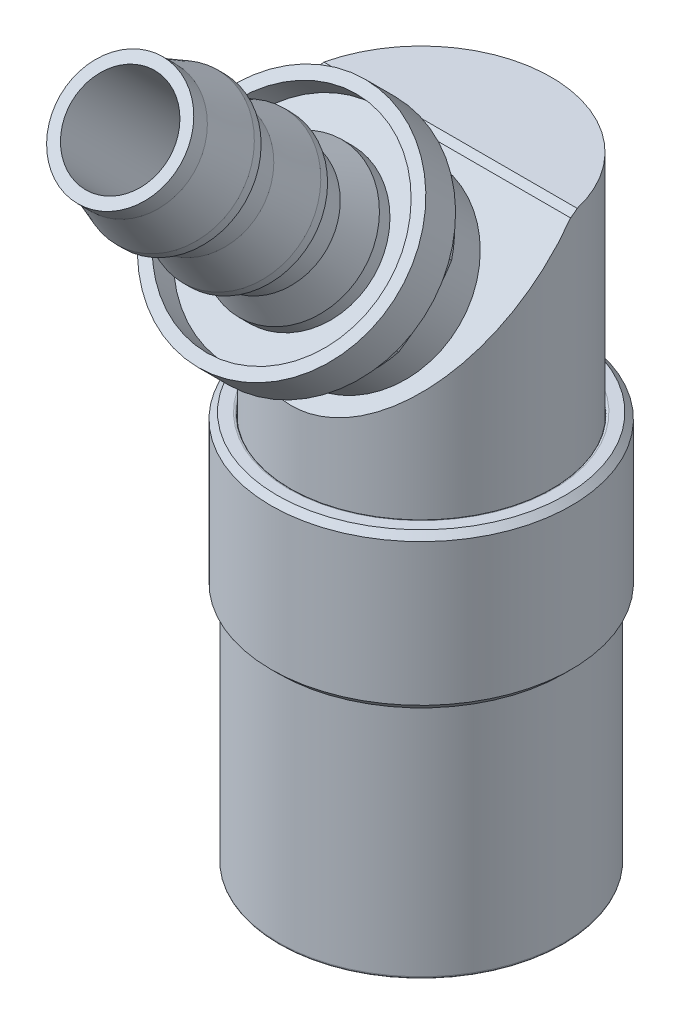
ISO-10303-21;
HEADER;
FILE_DESCRIPTION(('STEP AP214'),'2;1');
FILE_NAME('part.step','',(''),(''),'','','');
FILE_SCHEMA(('AUTOMOTIVE_DESIGN { 1 0 10303 214 1 1 1 1 }'));
ENDSEC;
DATA;
#1=APPLICATION_CONTEXT('core data for automotive mechanical design processes');
#2=APPLICATION_PROTOCOL_DEFINITION('international standard','automotive_design',2000,#1);
#3=PRODUCT_CONTEXT('',#1,'mechanical');
#4=PRODUCT('Part','Part','',(#3));
#5=PRODUCT_RELATED_PRODUCT_CATEGORY('part','',(#4));
#6=PRODUCT_DEFINITION_FORMATION('','',#4);
#7=PRODUCT_DEFINITION_CONTEXT('part definition',#1,'design');
#8=PRODUCT_DEFINITION('design','',#6,#7);
#9=PRODUCT_DEFINITION_SHAPE('','',#8);
#10=(LENGTH_UNIT() NAMED_UNIT(*) SI_UNIT(.MILLI.,.METRE.));
#11=(NAMED_UNIT(*) PLANE_ANGLE_UNIT() SI_UNIT($,.RADIAN.));
#12=(NAMED_UNIT(*) SI_UNIT($,.STERADIAN.) SOLID_ANGLE_UNIT());
#13=UNCERTAINTY_MEASURE_WITH_UNIT(LENGTH_MEASURE(1.E-05),#10,'distance_accuracy_value','');
#14=(GEOMETRIC_REPRESENTATION_CONTEXT(3) GLOBAL_UNCERTAINTY_ASSIGNED_CONTEXT((#13)) GLOBAL_UNIT_ASSIGNED_CONTEXT((#10,
#11,#12)) REPRESENTATION_CONTEXT('',''));
#15=CARTESIAN_POINT('',(0.,0.,0.));
#16=DIRECTION('',(0.,0.,1.));
#17=DIRECTION('',(1.,0.,0.));
#18=AXIS2_PLACEMENT_3D('',#15,#16,#17);
#19=CARTESIAN_POINT('',(-0.019949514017,54.6865710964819,3.50548856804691));
#20=DIRECTION('',(0.,-0.707106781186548,-0.707106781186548));
#21=DIRECTION('',(0.,-0.707106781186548,0.707106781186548));
#22=AXIS2_PLACEMENT_3D('',#19,#20,#21);
#23=CONICAL_SURFACE('',#22,6.4262,0.785398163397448);
#24=CARTESIAN_POINT('',(-0.019949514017,55.5845967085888,4.40351418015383));
#25=DIRECTION('',(0.,0.707106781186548,0.707106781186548));
#26=DIRECTION('',(0.,-0.707106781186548,0.707106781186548));
#27=AXIS2_PLACEMENT_3D('',#24,#25,#26);
#28=CIRCLE('',#27,5.1562);
#29=CARTESIAN_POINT('',(-0.0199495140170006,59.2305806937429,0.757530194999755));
#30=VERTEX_POINT('',#29);
#31=CARTESIAN_POINT('',(-0.0199495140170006,51.9386127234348,8.04949816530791));
#32=VERTEX_POINT('',#31);
#33=EDGE_CURVE('P0_E11',#30,#32,#28,.T.);
#34=ORIENTED_EDGE('',*,*,#33,.T.);
#35=CARTESIAN_POINT('',(-0.019949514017,55.5845967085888,4.40351418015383));
#36=DIRECTION('',(0.,0.707106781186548,0.707106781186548));
#37=DIRECTION('',(0.,-0.707106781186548,0.707106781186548));
#38=AXIS2_PLACEMENT_3D('',#35,#36,#37);
#39=CIRCLE('',#38,5.1562);
#40=EDGE_CURVE('P0_E27',#32,#30,#39,.T.);
#41=ORIENTED_EDGE('',*,*,#40,.T.);
#42=DIRECTION('',(0.,0.,-1.));
#43=VECTOR('',#42,1.);
#44=CARTESIAN_POINT('',(-0.0199495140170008,59.2305806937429,-1.03852102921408));
#45=LINE('',#44,#43);
#46=CARTESIAN_POINT('',(-0.0199495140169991,59.2305806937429,-2.83457225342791));
#47=VERTEX_POINT('',#46);
#48=EDGE_CURVE('P0_E237',#30,#47,#45,.T.);
#49=ORIENTED_EDGE('',*,*,#48,.T.);
#50=CARTESIAN_POINT('',(-0.019949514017,53.788545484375,2.60746295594));
#51=DIRECTION('',(0.,-0.707106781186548,-0.707106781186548));
#52=DIRECTION('',(0.,-0.707106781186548,0.707106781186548));
#53=AXIS2_PLACEMENT_3D('',#50,#51,#52);
#54=CIRCLE('',#53,7.6962);
#55=EDGE_CURVE('P0_E193',#47,#47,#54,.T.);
#56=ORIENTED_EDGE('',*,*,#55,.T.);
#57=ORIENTED_EDGE('',*,*,#48,.F.);
#58=EDGE_LOOP('',(#34,#41,#49,#56,#57));
#59=FACE_BOUND('',#58,.T.);
#60=ADVANCED_FACE('P0_F16',(#59),#23,.F.);
#61=CARTESIAN_POINT('',(-0.019949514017,57.4345294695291,-1.03852102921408));
#62=DIRECTION('',(0.,-0.707106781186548,-0.707106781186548));
#63=DIRECTION('',(0.,0.707106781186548,-0.707106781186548));
#64=AXIS2_PLACEMENT_3D('',#61,#62,#63);
#65=PLANE('',#64);
#66=CARTESIAN_POINT('',(-0.019949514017,53.788545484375,2.60746295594));
#67=DIRECTION('',(0.,0.707106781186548,0.707106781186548));
#68=DIRECTION('',(0.,0.707106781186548,-0.707106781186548));
#69=AXIS2_PLACEMENT_3D('',#66,#67,#68);
#70=CIRCLE('',#69,8.509);
#71=CARTESIAN_POINT('',(-0.019949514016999,47.7717738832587,8.62423455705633));
#72=VERTEX_POINT('',#71);
#73=EDGE_CURVE('P0_E178',#72,#72,#70,.T.);
#74=ORIENTED_EDGE('',*,*,#73,.F.);
#75=EDGE_LOOP('',(#74));
#76=FACE_BOUND('',#75,.T.);
#77=ORIENTED_EDGE('',*,*,#55,.F.);
#78=EDGE_LOOP('',(#77));
#79=FACE_BOUND('',#78,.T.);
#80=ADVANCED_FACE('P0_F179',(#76,#79),#65,.T.);
#81=CARTESIAN_POINT('',(-0.019949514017,68.3814616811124,17.2003791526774));
#82=DIRECTION('',(0.,-0.707106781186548,-0.707106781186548));
#83=DIRECTION('',(0.,0.707106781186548,-0.707106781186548));
#84=AXIS2_PLACEMENT_3D('',#81,#82,#83);
#85=CYLINDRICAL_SURFACE('',#84,5.1562);
#86=ORIENTED_EDGE('',*,*,#33,.F.);
#87=ORIENTED_EDGE('',*,*,#40,.F.);
#88=DIRECTION('',(0.,0.707106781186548,0.707106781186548));
#89=VECTOR('',#88,1.);
#90=CARTESIAN_POINT('',(-0.0199495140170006,64.7354776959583,20.8463631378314));
#91=LINE('',#90,#89);
#92=CARTESIAN_POINT('',(-0.0199495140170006,79.3283938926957,35.4392793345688));
#93=VERTEX_POINT('',#92);
#94=EDGE_CURVE('P0_E185',#32,#93,#91,.T.);
#95=ORIENTED_EDGE('',*,*,#94,.T.);
#96=CARTESIAN_POINT('',(-0.019949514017,82.9743778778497,31.7932953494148));
#97=DIRECTION('',(0.,-0.707106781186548,-0.707106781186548));
#98=DIRECTION('',(1.,0.,0.));
#99=AXIS2_PLACEMENT_3D('',#96,#97,#98);
#100=CIRCLE('',#99,5.1562);
#101=CARTESIAN_POINT('',(-0.019949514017,86.6203618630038,28.1473113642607));
#102=VERTEX_POINT('',#101);
#103=EDGE_CURVE('P0_E358',#102,#93,#100,.T.);
#104=ORIENTED_EDGE('',*,*,#103,.F.);
#105=CARTESIAN_POINT('',(-0.019949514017,82.9743778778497,31.7932953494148));
#106=DIRECTION('',(0.,-0.707106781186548,-0.707106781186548));
#107=DIRECTION('',(1.,0.,0.));
#108=AXIS2_PLACEMENT_3D('',#105,#106,#107);
#109=CIRCLE('',#108,5.1562);
#110=EDGE_CURVE('P0_E354',#93,#102,#109,.T.);
#111=ORIENTED_EDGE('',*,*,#110,.F.);
#112=ORIENTED_EDGE('',*,*,#94,.F.);
#113=EDGE_LOOP('',(#86,#87,#95,#104,#111,#112));
#114=FACE_BOUND('',#113,.T.);
#115=ADVANCED_FACE('P0_F819',(#114),#85,.F.);
#116=CARTESIAN_POINT('',(-0.019949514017,54.1477557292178,2.96667320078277));
#117=DIRECTION('',(0.,0.707106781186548,0.707106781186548));
#118=DIRECTION('',(0.,0.707106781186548,-0.707106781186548));
#119=AXIS2_PLACEMENT_3D('',#116,#117,#118);
#120=CONICAL_SURFACE('',#119,9.017,0.785398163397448);
#121=ORIENTED_EDGE('',*,*,#73,.T.);
#122=DIRECTION('',(0.,0.,1.));
#123=VECTOR('',#122,1.);
#124=CARTESIAN_POINT('',(-0.0199495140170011,47.7717738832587,9.34265504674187));
#125=LINE('',#124,#123);
#126=CARTESIAN_POINT('',(-0.0199495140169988,47.7717738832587,10.0036018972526));
#127=VERTEX_POINT('',#126);
#128=EDGE_CURVE('P0_E186',#72,#127,#125,.T.);
#129=ORIENTED_EDGE('',*,*,#128,.T.);
#130=CARTESIAN_POINT('',(-0.019949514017,54.4782291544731,3.29714662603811));
#131=DIRECTION('',(0.,-0.707106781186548,-0.707106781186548));
#132=DIRECTION('',(0.,0.707106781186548,-0.707106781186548));
#133=AXIS2_PLACEMENT_3D('',#130,#131,#132);
#134=CIRCLE('',#133,9.48436);
#135=EDGE_CURVE('P0_E195',#127,#127,#134,.T.);
#136=ORIENTED_EDGE('',*,*,#135,.T.);
#137=ORIENTED_EDGE('',*,*,#128,.F.);
#138=EDGE_LOOP('',(#121,#129,#136,#137));
#139=FACE_BOUND('',#138,.T.);
#140=ADVANCED_FACE('P0_F835',(#139),#120,.T.);
#141=CARTESIAN_POINT('',(-0.019949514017,56.8687733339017,5.68769080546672));
#142=DIRECTION('',(0.,-0.707106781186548,-0.707106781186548));
#143=DIRECTION('',(0.,0.707106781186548,-0.707106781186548));
#144=AXIS2_PLACEMENT_3D('',#141,#142,#143);
#145=CYLINDRICAL_SURFACE('',#144,9.48436);
#146=ORIENTED_EDGE('',*,*,#135,.F.);
#147=DIRECTION('',(0.,0.707106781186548,0.707106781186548));
#148=VECTOR('',#147,1.);
#149=CARTESIAN_POINT('',(-0.0199495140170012,50.1623180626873,12.3941460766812));
#150=LINE('',#149,#148);
#151=CARTESIAN_POINT('',(-0.0199495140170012,53.2259547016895,15.4577827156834));
#152=VERTEX_POINT('',#151);
#153=EDGE_CURVE('P0_E207',#127,#152,#150,.T.);
#154=ORIENTED_EDGE('',*,*,#153,.T.);
#155=CARTESIAN_POINT('',(-0.019949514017,59.932409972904,8.75132744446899));
#156=DIRECTION('',(0.,-0.707106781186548,-0.707106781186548));
#157=DIRECTION('',(0.,0.707106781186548,-0.707106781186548));
#158=AXIS2_PLACEMENT_3D('',#155,#156,#157);
#159=CIRCLE('',#158,9.48436);
#160=CARTESIAN_POINT('',(-8.23364621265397,56.5791823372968,12.1045550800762));
#161=VERTEX_POINT('',#160);
#162=EDGE_CURVE('P0_E211',#152,#161,#159,.T.);
#163=ORIENTED_EDGE('',*,*,#162,.T.);
#164=CARTESIAN_POINT('',(-0.019949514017,59.932409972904,8.75132744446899));
#165=DIRECTION('',(0.,-0.707106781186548,-0.707106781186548));
#166=DIRECTION('',(0.,0.707106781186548,-0.707106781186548));
#167=AXIS2_PLACEMENT_3D('',#164,#165,#166);
#168=CIRCLE('',#167,9.48436);
#169=EDGE_CURVE('P0_E452',#161,#152,#168,.T.);
#170=ORIENTED_EDGE('',*,*,#169,.T.);
#171=ORIENTED_EDGE('',*,*,#153,.F.);
#172=EDGE_LOOP('',(#146,#154,#163,#170,#171));
#173=FACE_BOUND('',#172,.T.);
#174=ADVANCED_FACE('P0_F601',(#173),#145,.T.);
#175=CARTESIAN_POINT('',(-0.0199495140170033,46.0114155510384,10.3845928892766));
#176=DIRECTION('',(0.5,0.612372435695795,-0.612372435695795));
#177=DIRECTION('',(0.,-0.707106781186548,-0.707106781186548));
#178=AXIS2_PLACEMENT_3D('',#175,#176,#177);
#179=PLANE('',#178);
#180=CARTESIAN_POINT('',(-1.35973471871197,53.0402909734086,16.3195382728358));
#181=CARTESIAN_POINT('',(-3.1390205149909,53.4452266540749,15.271693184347));
#182=CARTESIAN_POINT('',(-4.782449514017,54.116153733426,14.6007661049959));
#183=CARTESIAN_POINT('',(-6.42587851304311,54.7870808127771,13.9298390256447));
#184=CARTESIAN_POINT('',(-8.20516430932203,55.8349259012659,13.5249033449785));
#185=(BOUNDED_CURVE() B_SPLINE_CURVE(2,(#180,#181,#182,#183,#184),.UNSPECIFIED.,.F.,
.F.) B_SPLINE_CURVE_WITH_KNOTS((3,2,3),(0.,0.398430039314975,0.796860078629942),
.UNSPECIFIED.) CURVE() GEOMETRIC_REPRESENTATION_ITEM() RATIONAL_B_SPLINE_CURVE((1.,
1.02045741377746,1.,1.02045741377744,1.)) REPRESENTATION_ITEM(''));
#186=CARTESIAN_POINT('',(-1.35973471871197,53.0402909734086,16.3195382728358));
#187=VERTEX_POINT('',#186);
#188=CARTESIAN_POINT('',(-8.20516430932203,55.8349259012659,13.5249033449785));
#189=VERTEX_POINT('',#188);
#190=EDGE_CURVE('P0_E230',#187,#189,#185,.T.);
#191=ORIENTED_EDGE('',*,*,#190,.F.);
#192=DIRECTION('',(0.,-0.707106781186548,-0.707106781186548));
#193=VECTOR('',#192,1.);
#194=CARTESIAN_POINT('',(-1.35973471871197,54.0737158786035,17.3529631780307));
#195=LINE('',#194,#193);
#196=CARTESIAN_POINT('',(-1.35973471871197,55.1071407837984,18.3863880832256));
#197=VERTEX_POINT('',#196);
#198=EDGE_CURVE('P0_E334',#197,#187,#195,.T.);
#199=ORIENTED_EDGE('',*,*,#198,.F.);
#200=CARTESIAN_POINT('',(-8.20516430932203,57.9017757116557,15.5917531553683));
#201=CARTESIAN_POINT('',(-4.78244951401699,57.1228230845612,17.6074354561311));
#202=CARTESIAN_POINT('',(-1.35973471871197,55.1071407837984,18.3863880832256));
#203=(BOUNDED_CURVE() B_SPLINE_CURVE(2,(#200,#201,#202),.UNSPECIFIED.,.F.,
.F.) B_SPLINE_CURVE_WITH_KNOTS((3,3),(0.,0.795654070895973),
.UNSPECIFIED.) CURVE() GEOMETRIC_REPRESENTATION_ITEM() RATIONAL_B_SPLINE_CURVE((1.,
1.08266666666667,1.)) REPRESENTATION_ITEM(''));
#204=CARTESIAN_POINT('',(-8.20516430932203,57.9017757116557,15.5917531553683));
#205=VERTEX_POINT('',#204);
#206=EDGE_CURVE('P0_E364',#205,#197,#203,.T.);
#207=ORIENTED_EDGE('',*,*,#206,.F.);
#208=DIRECTION('',(0.,0.707106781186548,0.707106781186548));
#209=VECTOR('',#208,1.);
#210=CARTESIAN_POINT('',(-8.20516430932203,56.8683508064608,14.5583282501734));
#211=LINE('',#210,#209);
#212=EDGE_CURVE('P0_E217',#189,#205,#211,.T.);
#213=ORIENTED_EDGE('',*,*,#212,.F.);
#214=EDGE_LOOP('',(#191,#199,#207,#213));
#215=FACE_BOUND('',#214,.T.);
#216=ADVANCED_FACE('P0_F626',(#215),#179,.F.);
#217=CARTESIAN_POINT('',(9.505050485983,49.8999805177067,6.4960279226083));
#218=DIRECTION('',(-0.5,0.612372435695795,-0.612372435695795));
#219=DIRECTION('',(-0.866025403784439,-0.353553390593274,0.353553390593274));
#220=AXIS2_PLACEMENT_3D('',#217,#218,#219);
#221=PLANE('',#220);
#222=CARTESIAN_POINT('',(8.16526528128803,55.8349259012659,13.5249033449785));
#223=CARTESIAN_POINT('',(6.3859794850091,54.7870808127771,13.9298390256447));
#224=CARTESIAN_POINT('',(4.742550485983,54.116153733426,14.6007661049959));
#225=CARTESIAN_POINT('',(3.09912148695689,53.4452266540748,15.271693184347));
#226=CARTESIAN_POINT('',(1.31983569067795,53.0402909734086,16.3195382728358));
#227=(BOUNDED_CURVE() B_SPLINE_CURVE(2,(#222,#223,#224,#225,#226),.UNSPECIFIED.,.F.,
.F.) B_SPLINE_CURVE_WITH_KNOTS((3,2,3),(0.,0.398430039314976,0.796860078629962),
.UNSPECIFIED.) CURVE() GEOMETRIC_REPRESENTATION_ITEM() RATIONAL_B_SPLINE_CURVE((1.,
1.02045741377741,1.,1.02045741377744,1.)) REPRESENTATION_ITEM(''));
#228=CARTESIAN_POINT('',(8.16526528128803,55.8349259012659,13.5249033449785));
#229=VERTEX_POINT('',#228);
#230=CARTESIAN_POINT('',(1.31983569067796,53.0402909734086,16.3195382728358));
#231=VERTEX_POINT('',#230);
#232=EDGE_CURVE('P0_E216',#229,#231,#227,.T.);
#233=ORIENTED_EDGE('',*,*,#232,.F.);
#234=DIRECTION('',(0.,-0.707106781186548,-0.707106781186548));
#235=VECTOR('',#234,1.);
#236=CARTESIAN_POINT('',(8.16526528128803,56.8683508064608,14.5583282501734));
#237=LINE('',#236,#235);
#238=CARTESIAN_POINT('',(8.16526528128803,57.9017757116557,15.5917531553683));
#239=VERTEX_POINT('',#238);
#240=EDGE_CURVE('P0_E419',#239,#229,#237,.T.);
#241=ORIENTED_EDGE('',*,*,#240,.F.);
#242=CARTESIAN_POINT('',(1.31983569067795,55.1071407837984,18.3863880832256));
#243=CARTESIAN_POINT('',(4.74255048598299,57.1228230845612,17.6074354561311));
#244=CARTESIAN_POINT('',(8.16526528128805,57.9017757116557,15.5917531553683));
#245=(BOUNDED_CURVE() B_SPLINE_CURVE(2,(#242,#243,#244),.UNSPECIFIED.,.F.,
.F.) B_SPLINE_CURVE_WITH_KNOTS((3,3),(0.,0.795654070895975),
.UNSPECIFIED.) CURVE() GEOMETRIC_REPRESENTATION_ITEM() RATIONAL_B_SPLINE_CURVE((1.,
1.08266666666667,1.)) REPRESENTATION_ITEM(''));
#246=CARTESIAN_POINT('',(1.31983569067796,55.1071407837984,18.3863880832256));
#247=VERTEX_POINT('',#246);
#248=EDGE_CURVE('P0_E265',#247,#239,#245,.T.);
#249=ORIENTED_EDGE('',*,*,#248,.F.);
#250=DIRECTION('',(0.,0.707106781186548,0.707106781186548));
#251=VECTOR('',#250,1.);
#252=CARTESIAN_POINT('',(1.31983569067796,54.0737158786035,17.3529631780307));
#253=LINE('',#252,#251);
#254=EDGE_CURVE('P0_E331',#231,#247,#253,.T.);
#255=ORIENTED_EDGE('',*,*,#254,.F.);
#256=EDGE_LOOP('',(#233,#241,#249,#255));
#257=FACE_BOUND('',#256,.T.);
#258=ADVANCED_FACE('P0_F617',(#257),#221,.F.);
#259=CARTESIAN_POINT('',(9.505050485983,57.6771104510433,-1.2811020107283));
#260=DIRECTION('',(-1.,0.,0.));
#261=DIRECTION('',(0.,-0.707106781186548,0.707106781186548));
#262=AXIS2_PLACEMENT_3D('',#259,#260,#261);
#263=PLANE('',#262);
#264=CARTESIAN_POINT('',(9.505050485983,63.065090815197,6.29473843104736));
#265=CARTESIAN_POINT('',(9.505050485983,61.2908553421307,7.42606449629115));
#266=CARTESIAN_POINT('',(9.505050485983,59.9490011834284,8.76791865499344));
#267=CARTESIAN_POINT('',(9.505050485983,58.6071470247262,10.1097728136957));
#268=CARTESIAN_POINT('',(9.505050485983,57.4758209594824,11.884008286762));
#269=(BOUNDED_CURVE() B_SPLINE_CURVE(2,(#264,#265,#266,#267,#268),.UNSPECIFIED.,.F.,
.F.) B_SPLINE_CURVE_WITH_KNOTS((3,2,3),(0.,0.398430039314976,0.796860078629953),
.UNSPECIFIED.) CURVE() GEOMETRIC_REPRESENTATION_ITEM() RATIONAL_B_SPLINE_CURVE((1.,
1.02045741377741,1.,1.02045741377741,1.)) REPRESENTATION_ITEM(''));
#270=CARTESIAN_POINT('',(9.505050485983,63.065090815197,6.29473843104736));
#271=VERTEX_POINT('',#270);
#272=CARTESIAN_POINT('',(9.505050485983,57.4758209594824,11.884008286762));
#273=VERTEX_POINT('',#272);
#274=EDGE_CURVE('P0_E303',#271,#273,#269,.T.);
#275=ORIENTED_EDGE('',*,*,#274,.F.);
#276=DIRECTION('',(0.,-0.707106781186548,-0.707106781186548));
#277=VECTOR('',#276,1.);
#278=CARTESIAN_POINT('',(9.505050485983,64.0985157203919,7.32816333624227));
#279=LINE('',#278,#277);
#280=CARTESIAN_POINT('',(9.505050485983,65.1319406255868,8.36158824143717));
#281=VERTEX_POINT('',#280);
#282=EDGE_CURVE('P0_E388',#281,#271,#279,.T.);
#283=ORIENTED_EDGE('',*,*,#282,.F.);
#284=CARTESIAN_POINT('',(9.505050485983,59.5426707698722,13.9508580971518));
#285=CARTESIAN_POINT('',(9.50505048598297,62.9556705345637,11.7745880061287));
#286=CARTESIAN_POINT('',(9.505050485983,65.1319406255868,8.36158824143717));
#287=(BOUNDED_CURVE() B_SPLINE_CURVE(2,(#284,#285,#286),.UNSPECIFIED.,.F.,
.F.) B_SPLINE_CURVE_WITH_KNOTS((3,3),(0.,0.795654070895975),
.UNSPECIFIED.) CURVE() GEOMETRIC_REPRESENTATION_ITEM() RATIONAL_B_SPLINE_CURVE((1.,
1.08266666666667,1.)) REPRESENTATION_ITEM(''));
#288=CARTESIAN_POINT('',(9.505050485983,59.5426707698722,13.9508580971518));
#289=VERTEX_POINT('',#288);
#290=EDGE_CURVE('P0_E260',#289,#281,#287,.T.);
#291=ORIENTED_EDGE('',*,*,#290,.F.);
#292=DIRECTION('',(0.,0.707106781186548,0.707106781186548));
#293=VECTOR('',#292,1.);
#294=CARTESIAN_POINT('',(9.505050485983,58.5092458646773,12.9174331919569));
#295=LINE('',#294,#293);
#296=EDGE_CURVE('P0_E532',#273,#289,#295,.T.);
#297=ORIENTED_EDGE('',*,*,#296,.F.);
#298=EDGE_LOOP('',(#275,#283,#291,#297));
#299=FACE_BOUND('',#298,.T.);
#300=ADVANCED_FACE('P0_F18',(#299),#263,.F.);
#301=CARTESIAN_POINT('',(-0.0199495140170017,61.5656754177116,-5.16966697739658));
#302=DIRECTION('',(-0.5,-0.612372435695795,0.612372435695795));
#303=DIRECTION('',(0.,0.707106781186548,0.707106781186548));
#304=AXIS2_PLACEMENT_3D('',#301,#302,#303);
#305=PLANE('',#304);
#306=CARTESIAN_POINT('',(1.31983569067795,67.5006208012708,1.85920844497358));
#307=CARTESIAN_POINT('',(3.0991214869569,66.452775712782,2.26414412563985));
#308=CARTESIAN_POINT('',(4.742550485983,65.7818486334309,2.93507120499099));
#309=CARTESIAN_POINT('',(6.38597948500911,65.1109215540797,3.60599828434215));
#310=CARTESIAN_POINT('',(8.16526528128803,64.7059858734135,4.65384337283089));
#311=(BOUNDED_CURVE() B_SPLINE_CURVE(2,(#306,#307,#308,#309,#310),.UNSPECIFIED.,.F.,
.F.) B_SPLINE_CURVE_WITH_KNOTS((3,2,3),(0.,0.398430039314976,0.796860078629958),
.UNSPECIFIED.) CURVE() GEOMETRIC_REPRESENTATION_ITEM() RATIONAL_B_SPLINE_CURVE((1.,
1.02045741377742,1.,1.02045741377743,1.)) REPRESENTATION_ITEM(''));
#312=CARTESIAN_POINT('',(1.31983569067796,67.5006208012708,1.85920844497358));
#313=VERTEX_POINT('',#312);
#314=CARTESIAN_POINT('',(8.16526528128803,64.7059858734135,4.65384337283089));
#315=VERTEX_POINT('',#314);
#316=EDGE_CURVE('P0_E255',#313,#315,#311,.T.);
#317=ORIENTED_EDGE('',*,*,#316,.F.);
#318=DIRECTION('',(0.,-0.707106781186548,-0.707106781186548));
#319=VECTOR('',#318,1.);
#320=CARTESIAN_POINT('',(1.31983569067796,68.5340457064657,2.89263335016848));
#321=LINE('',#320,#319);
#322=CARTESIAN_POINT('',(1.31983569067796,69.5674706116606,3.92605825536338));
#323=VERTEX_POINT('',#322);
#324=EDGE_CURVE('P0_E282',#323,#313,#321,.T.);
#325=ORIENTED_EDGE('',*,*,#324,.F.);
#326=CARTESIAN_POINT('',(8.16526528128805,66.7728356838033,6.7206931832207));
#327=CARTESIAN_POINT('',(4.74255048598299,68.7885179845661,5.94174055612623));
#328=CARTESIAN_POINT('',(1.31983569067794,69.5674706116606,3.92605825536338));
#329=(BOUNDED_CURVE() B_SPLINE_CURVE(2,(#326,#327,#328),.UNSPECIFIED.,.F.,
.F.) B_SPLINE_CURVE_WITH_KNOTS((3,3),(0.,0.795654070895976),
.UNSPECIFIED.) CURVE() GEOMETRIC_REPRESENTATION_ITEM() RATIONAL_B_SPLINE_CURVE((1.,
1.08266666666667,1.)) REPRESENTATION_ITEM(''));
#330=CARTESIAN_POINT('',(8.16526528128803,66.7728356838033,6.7206931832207));
#331=VERTEX_POINT('',#330);
#332=EDGE_CURVE('P0_E266',#331,#323,#329,.T.);
#333=ORIENTED_EDGE('',*,*,#332,.F.);
#334=DIRECTION('',(0.,0.707106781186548,0.707106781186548));
#335=VECTOR('',#334,1.);
#336=CARTESIAN_POINT('',(8.16526528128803,65.7394107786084,5.6872682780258));
#337=LINE('',#336,#335);
#338=EDGE_CURVE('P0_E384',#315,#331,#337,.T.);
#339=ORIENTED_EDGE('',*,*,#338,.F.);
#340=EDGE_LOOP('',(#317,#325,#333,#339));
#341=FACE_BOUND('',#340,.T.);
#342=ADVANCED_FACE('P0_F712',(#341),#305,.F.);
#343=CARTESIAN_POINT('',(-9.544949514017,57.6771104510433,-1.2811020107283));
#344=DIRECTION('',(0.5,-0.612372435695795,0.612372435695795));
#345=DIRECTION('',(0.,-0.707106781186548,-0.707106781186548));
#346=AXIS2_PLACEMENT_3D('',#343,#344,#345);
#347=PLANE('',#346);
#348=CARTESIAN_POINT('',(-8.20516430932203,64.7059858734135,4.65384337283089));
#349=CARTESIAN_POINT('',(-6.4258785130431,65.1109215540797,3.60599828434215));
#350=CARTESIAN_POINT('',(-4.782449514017,65.7818486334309,2.935071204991));
#351=CARTESIAN_POINT('',(-3.13902051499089,66.452775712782,2.26414412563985));
#352=CARTESIAN_POINT('',(-1.35973471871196,67.5006208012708,1.85920844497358));
#353=(BOUNDED_CURVE() B_SPLINE_CURVE(2,(#348,#349,#350,#351,#352),.UNSPECIFIED.,.F.,
.F.) B_SPLINE_CURVE_WITH_KNOTS((3,2,3),(0.,0.398430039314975,0.796860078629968),
.UNSPECIFIED.) CURVE() GEOMETRIC_REPRESENTATION_ITEM() RATIONAL_B_SPLINE_CURVE((1.,
1.02045741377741,1.,1.02045741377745,1.)) REPRESENTATION_ITEM(''));
#354=CARTESIAN_POINT('',(-8.20516430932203,64.7059858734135,4.65384337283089));
#355=VERTEX_POINT('',#354);
#356=CARTESIAN_POINT('',(-1.35973471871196,67.5006208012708,1.85920844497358));
#357=VERTEX_POINT('',#356);
#358=EDGE_CURVE('P0_E254',#355,#357,#353,.T.);
#359=ORIENTED_EDGE('',*,*,#358,.F.);
#360=DIRECTION('',(0.,-0.707106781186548,-0.707106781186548));
#361=VECTOR('',#360,1.);
#362=CARTESIAN_POINT('',(-8.20516430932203,65.7394107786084,5.6872682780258));
#363=LINE('',#362,#361);
#364=CARTESIAN_POINT('',(-8.20516430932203,66.7728356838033,6.7206931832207));
#365=VERTEX_POINT('',#364);
#366=EDGE_CURVE('P0_E326',#365,#355,#363,.T.);
#367=ORIENTED_EDGE('',*,*,#366,.F.);
#368=CARTESIAN_POINT('',(-1.35973471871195,69.5674706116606,3.92605825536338));
#369=CARTESIAN_POINT('',(-4.782449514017,68.7885179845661,5.94174055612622));
#370=CARTESIAN_POINT('',(-8.20516430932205,66.7728356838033,6.7206931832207));
#371=(BOUNDED_CURVE() B_SPLINE_CURVE(2,(#368,#369,#370),.UNSPECIFIED.,.F.,
.F.) B_SPLINE_CURVE_WITH_KNOTS((3,3),(0.,0.795654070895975),
.UNSPECIFIED.) CURVE() GEOMETRIC_REPRESENTATION_ITEM() RATIONAL_B_SPLINE_CURVE((1.,
1.08266666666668,1.)) REPRESENTATION_ITEM(''));
#372=CARTESIAN_POINT('',(-1.35973471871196,69.5674706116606,3.92605825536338));
#373=VERTEX_POINT('',#372);
#374=EDGE_CURVE('P0_E295',#373,#365,#371,.T.);
#375=ORIENTED_EDGE('',*,*,#374,.F.);
#376=DIRECTION('',(0.,0.707106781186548,0.707106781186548));
#377=VECTOR('',#376,1.);
#378=CARTESIAN_POINT('',(-1.35973471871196,68.5340457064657,2.89263335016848));
#379=LINE('',#378,#377);
#380=EDGE_CURVE('P0_E286',#357,#373,#379,.T.);
#381=ORIENTED_EDGE('',*,*,#380,.F.);
#382=EDGE_LOOP('',(#359,#367,#375,#381));
#383=FACE_BOUND('',#382,.T.);
#384=ADVANCED_FACE('P0_F789',(#383),#347,.F.);
#385=CARTESIAN_POINT('',(-9.544949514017,49.8999805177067,6.4960279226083));
#386=DIRECTION('',(1.,0.,0.));
#387=DIRECTION('',(0.,-0.707106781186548,0.707106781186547));
#388=AXIS2_PLACEMENT_3D('',#385,#386,#387);
#389=PLANE('',#388);
#390=CARTESIAN_POINT('',(-9.544949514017,57.4758209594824,11.884008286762));
#391=CARTESIAN_POINT('',(-9.544949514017,58.6071470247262,10.1097728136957));
#392=CARTESIAN_POINT('',(-9.544949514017,59.9490011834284,8.76791865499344));
#393=CARTESIAN_POINT('',(-9.544949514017,61.2908553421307,7.42606449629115));
#394=CARTESIAN_POINT('',(-9.544949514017,63.065090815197,6.29473843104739));
#395=(BOUNDED_CURVE() B_SPLINE_CURVE(2,(#390,#391,#392,#393,#394),.UNSPECIFIED.,.F.,
.F.) B_SPLINE_CURVE_WITH_KNOTS((3,2,3),(0.,0.398430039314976,0.796860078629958),
.UNSPECIFIED.) CURVE() GEOMETRIC_REPRESENTATION_ITEM() RATIONAL_B_SPLINE_CURVE((1.,
1.02045741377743,1.,1.02045741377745,1.)) REPRESENTATION_ITEM(''));
#396=CARTESIAN_POINT('',(-9.544949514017,57.4758209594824,11.884008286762));
#397=VERTEX_POINT('',#396);
#398=CARTESIAN_POINT('',(-9.544949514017,63.065090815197,6.29473843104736));
#399=VERTEX_POINT('',#398);
#400=EDGE_CURVE('P0_E493',#397,#399,#395,.T.);
#401=ORIENTED_EDGE('',*,*,#400,.F.);
#402=DIRECTION('',(0.,-0.707106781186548,-0.707106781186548));
#403=VECTOR('',#402,1.);
#404=CARTESIAN_POINT('',(-9.544949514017,58.5092458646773,12.9174331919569));
#405=LINE('',#404,#403);
#406=CARTESIAN_POINT('',(-9.544949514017,59.5426707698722,13.9508580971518));
#407=VERTEX_POINT('',#406);
#408=EDGE_CURVE('P0_E20',#407,#397,#405,.T.);
#409=ORIENTED_EDGE('',*,*,#408,.F.);
#410=CARTESIAN_POINT('',(-9.544949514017,65.1319406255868,8.36158824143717));
#411=CARTESIAN_POINT('',(-9.54494951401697,62.9556705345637,11.7745880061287));
#412=CARTESIAN_POINT('',(-9.544949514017,59.5426707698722,13.9508580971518));
#413=(BOUNDED_CURVE() B_SPLINE_CURVE(2,(#410,#411,#412),.UNSPECIFIED.,.F.,
.F.) B_SPLINE_CURVE_WITH_KNOTS((3,3),(0.,0.795654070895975),
.UNSPECIFIED.) CURVE() GEOMETRIC_REPRESENTATION_ITEM() RATIONAL_B_SPLINE_CURVE((1.,
1.08266666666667,1.)) REPRESENTATION_ITEM(''));
#414=CARTESIAN_POINT('',(-9.544949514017,65.1319406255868,8.36158824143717));
#415=VERTEX_POINT('',#414);
#416=EDGE_CURVE('P0_E378',#415,#407,#413,.T.);
#417=ORIENTED_EDGE('',*,*,#416,.F.);
#418=DIRECTION('',(0.,0.707106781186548,0.707106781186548));
#419=VECTOR('',#418,1.);
#420=CARTESIAN_POINT('',(-9.544949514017,64.0985157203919,7.32816333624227));
#421=LINE('',#420,#419);
#422=EDGE_CURVE('P0_E330',#399,#415,#421,.T.);
#423=ORIENTED_EDGE('',*,*,#422,.F.);
#424=EDGE_LOOP('',(#401,#409,#417,#423));
#425=FACE_BOUND('',#424,.T.);
#426=ADVANCED_FACE('P0_F794',(#425),#389,.F.);
#427=CARTESIAN_POINT('',(-0.019949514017,60.1097285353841,8.92864600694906));
#428=DIRECTION('',(0.,0.707106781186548,0.707106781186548));
#429=DIRECTION('',(0.,0.707106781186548,-0.707106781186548));
#430=AXIS2_PLACEMENT_3D('',#427,#428,#429);
#431=CONICAL_SURFACE('',#430,9.9187,1.0471975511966);
#432=ORIENTED_EDGE('',*,*,#169,.F.);
#433=ORIENTED_EDGE('',*,*,#162,.F.);
#434=DIRECTION('',(0.,-0.25881904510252,0.965925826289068));
#435=VECTOR('',#434,1.);
#436=CARTESIAN_POINT('',(-0.0199495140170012,53.0961485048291,15.9422260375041));
#437=LINE('',#436,#435);
#438=CARTESIAN_POINT('',(-0.0199495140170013,52.9784879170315,16.3813413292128));
#439=VERTEX_POINT('',#438);
#440=EDGE_CURVE('P0_E448',#152,#439,#437,.T.);
#441=ORIENTED_EDGE('',*,*,#440,.T.);
#442=CARTESIAN_POINT('',(-0.019949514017,60.2704558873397,9.08937335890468));
#443=DIRECTION('',(0.,-0.707106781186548,-0.707106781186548));
#444=DIRECTION('',(1.,0.,0.));
#445=AXIS2_PLACEMENT_3D('',#442,#443,#444);
#446=CIRCLE('',#445,10.3124);
#447=EDGE_CURVE('P0_E199',#439,#187,#446,.T.);
#448=ORIENTED_EDGE('',*,*,#447,.T.);
#449=ORIENTED_EDGE('',*,*,#190,.T.);
#450=CARTESIAN_POINT('',(-0.019949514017,60.2704558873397,9.08937335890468));
#451=DIRECTION('',(0.,-0.707106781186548,-0.707106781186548));
#452=DIRECTION('',(1.,0.,0.));
#453=AXIS2_PLACEMENT_3D('',#450,#451,#452);
#454=CIRCLE('',#453,10.3124);
#455=EDGE_CURVE('P0_E236',#189,#397,#454,.T.);
#456=ORIENTED_EDGE('',*,*,#455,.T.);
#457=ORIENTED_EDGE('',*,*,#400,.T.);
#458=CARTESIAN_POINT('',(-0.019949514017,60.2704558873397,9.08937335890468));
#459=DIRECTION('',(0.,-0.707106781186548,-0.707106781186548));
#460=DIRECTION('',(1.,0.,0.));
#461=AXIS2_PLACEMENT_3D('',#458,#459,#460);
#462=CIRCLE('',#461,10.3124);
#463=EDGE_CURVE('P0_E344',#399,#355,#462,.T.);
#464=ORIENTED_EDGE('',*,*,#463,.T.);
#465=ORIENTED_EDGE('',*,*,#358,.T.);
#466=CARTESIAN_POINT('',(-0.019949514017,60.2704558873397,9.08937335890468));
#467=DIRECTION('',(0.,-0.707106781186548,-0.707106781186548));
#468=DIRECTION('',(1.,0.,0.));
#469=AXIS2_PLACEMENT_3D('',#466,#467,#468);
#470=CIRCLE('',#469,10.3124);
#471=EDGE_CURVE('P0_E250',#357,#313,#470,.T.);
#472=ORIENTED_EDGE('',*,*,#471,.T.);
#473=ORIENTED_EDGE('',*,*,#316,.T.);
#474=CARTESIAN_POINT('',(-0.019949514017,60.2704558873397,9.08937335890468));
#475=DIRECTION('',(0.,-0.707106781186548,-0.707106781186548));
#476=DIRECTION('',(1.,0.,0.));
#477=AXIS2_PLACEMENT_3D('',#474,#475,#476);
#478=CIRCLE('',#477,10.3124);
#479=EDGE_CURVE('P0_E296',#315,#271,#478,.T.);
#480=ORIENTED_EDGE('',*,*,#479,.T.);
#481=ORIENTED_EDGE('',*,*,#274,.T.);
#482=CARTESIAN_POINT('',(-0.019949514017,60.2704558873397,9.08937335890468));
#483=DIRECTION('',(0.,-0.707106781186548,-0.707106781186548));
#484=DIRECTION('',(1.,0.,0.));
#485=AXIS2_PLACEMENT_3D('',#482,#483,#484);
#486=CIRCLE('',#485,10.3124);
#487=EDGE_CURVE('P0_E400',#273,#229,#486,.T.);
#488=ORIENTED_EDGE('',*,*,#487,.T.);
#489=ORIENTED_EDGE('',*,*,#232,.T.);
#490=CARTESIAN_POINT('',(-0.019949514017,60.2704558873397,9.08937335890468));
#491=DIRECTION('',(0.,-0.707106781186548,-0.707106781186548));
#492=DIRECTION('',(1.,0.,0.));
#493=AXIS2_PLACEMENT_3D('',#490,#491,#492);
#494=CIRCLE('',#493,10.3124);
#495=EDGE_CURVE('P0_E212',#231,#439,#494,.T.);
#496=ORIENTED_EDGE('',*,*,#495,.T.);
#497=ORIENTED_EDGE('',*,*,#440,.F.);
#498=EDGE_LOOP('',(#432,#433,#441,#448,#449,#456,#457,#464,#465,#472,#473,#480,#481,#488,#489,
#496,#497));
#499=FACE_BOUND('',#498,.T.);
#500=ADVANCED_FACE('P0_F583',(#499),#431,.T.);
#501=CARTESIAN_POINT('',(-0.019949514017,61.3038807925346,10.1227982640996));
#502=DIRECTION('',(0.,-0.707106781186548,-0.707106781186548));
#503=DIRECTION('',(0.,0.707106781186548,-0.707106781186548));
#504=AXIS2_PLACEMENT_3D('',#501,#502,#503);
#505=CYLINDRICAL_SURFACE('',#504,10.3124);
#506=ORIENTED_EDGE('',*,*,#212,.T.);
#507=CARTESIAN_POINT('',(-0.019949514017,62.3373056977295,11.1562231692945));
#508=DIRECTION('',(0.,-0.707106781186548,-0.707106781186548));
#509=DIRECTION('',(1.,0.,0.));
#510=AXIS2_PLACEMENT_3D('',#507,#508,#509);
#511=CIRCLE('',#510,10.3124);
#512=EDGE_CURVE('P0_E259',#205,#407,#511,.T.);
#513=ORIENTED_EDGE('',*,*,#512,.T.);
#514=ORIENTED_EDGE('',*,*,#408,.T.);
#515=ORIENTED_EDGE('',*,*,#455,.F.);
#516=EDGE_LOOP('',(#506,#513,#514,#515));
#517=FACE_BOUND('',#516,.T.);
#518=ADVANCED_FACE('P0_F629',(#517),#505,.T.);
#519=CARTESIAN_POINT('',(-0.019949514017,61.3038807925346,10.1227982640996));
#520=DIRECTION('',(0.,-0.707106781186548,-0.707106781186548));
#521=DIRECTION('',(0.,0.707106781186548,-0.707106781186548));
#522=AXIS2_PLACEMENT_3D('',#519,#520,#521);
#523=CYLINDRICAL_SURFACE('',#522,10.3124);
#524=ORIENTED_EDGE('',*,*,#366,.T.);
#525=ORIENTED_EDGE('',*,*,#463,.F.);
#526=ORIENTED_EDGE('',*,*,#422,.T.);
#527=CARTESIAN_POINT('',(-0.019949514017,62.3373056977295,11.1562231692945));
#528=DIRECTION('',(0.,-0.707106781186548,-0.707106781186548));
#529=DIRECTION('',(1.,0.,0.));
#530=AXIS2_PLACEMENT_3D('',#527,#528,#529);
#531=CIRCLE('',#530,10.3124);
#532=EDGE_CURVE('P0_E285',#415,#365,#531,.T.);
#533=ORIENTED_EDGE('',*,*,#532,.T.);
#534=EDGE_LOOP('',(#524,#525,#526,#533));
#535=FACE_BOUND('',#534,.T.);
#536=ADVANCED_FACE('P0_F899',(#535),#523,.T.);
#537=CARTESIAN_POINT('',(-0.019949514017,61.3038807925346,10.1227982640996));
#538=DIRECTION('',(0.,-0.707106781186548,-0.707106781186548));
#539=DIRECTION('',(0.,0.707106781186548,-0.707106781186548));
#540=AXIS2_PLACEMENT_3D('',#537,#538,#539);
#541=CYLINDRICAL_SURFACE('',#540,10.3124);
#542=ORIENTED_EDGE('',*,*,#324,.T.);
#543=ORIENTED_EDGE('',*,*,#471,.F.);
#544=ORIENTED_EDGE('',*,*,#380,.T.);
#545=CARTESIAN_POINT('',(-0.019949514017,62.3373056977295,11.1562231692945));
#546=DIRECTION('',(0.,-0.707106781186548,-0.707106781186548));
#547=DIRECTION('',(1.,0.,0.));
#548=AXIS2_PLACEMENT_3D('',#545,#546,#547);
#549=CIRCLE('',#548,10.3124);
#550=EDGE_CURVE('P0_E412',#373,#323,#549,.T.);
#551=ORIENTED_EDGE('',*,*,#550,.T.);
#552=EDGE_LOOP('',(#542,#543,#544,#551));
#553=FACE_BOUND('',#552,.T.);
#554=ADVANCED_FACE('P0_F716',(#553),#541,.T.);
#555=CARTESIAN_POINT('',(-0.019949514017,61.3038807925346,10.1227982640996));
#556=DIRECTION('',(0.,-0.707106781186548,-0.707106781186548));
#557=DIRECTION('',(0.,0.707106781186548,-0.707106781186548));
#558=AXIS2_PLACEMENT_3D('',#555,#556,#557);
#559=CYLINDRICAL_SURFACE('',#558,10.3124);
#560=ORIENTED_EDGE('',*,*,#282,.T.);
#561=ORIENTED_EDGE('',*,*,#479,.F.);
#562=ORIENTED_EDGE('',*,*,#338,.T.);
#563=CARTESIAN_POINT('',(-0.019949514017,62.3373056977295,11.1562231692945));
#564=DIRECTION('',(0.,-0.707106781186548,-0.707106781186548));
#565=DIRECTION('',(1.,0.,0.));
#566=AXIS2_PLACEMENT_3D('',#563,#564,#565);
#567=CIRCLE('',#566,10.3124);
#568=EDGE_CURVE('P0_E389',#331,#281,#567,.T.);
#569=ORIENTED_EDGE('',*,*,#568,.T.);
#570=EDGE_LOOP('',(#560,#561,#562,#569));
#571=FACE_BOUND('',#570,.T.);
#572=ADVANCED_FACE('P0_F708',(#571),#559,.T.);
#573=CARTESIAN_POINT('',(-0.019949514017,61.3038807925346,10.1227982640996));
#574=DIRECTION('',(0.,-0.707106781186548,-0.707106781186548));
#575=DIRECTION('',(0.,0.707106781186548,-0.707106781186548));
#576=AXIS2_PLACEMENT_3D('',#573,#574,#575);
#577=CYLINDRICAL_SURFACE('',#576,10.3124);
#578=ORIENTED_EDGE('',*,*,#240,.T.);
#579=ORIENTED_EDGE('',*,*,#487,.F.);
#580=ORIENTED_EDGE('',*,*,#296,.T.);
#581=CARTESIAN_POINT('',(-0.019949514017,62.3373056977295,11.1562231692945));
#582=DIRECTION('',(0.,-0.707106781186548,-0.707106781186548));
#583=DIRECTION('',(1.,0.,0.));
#584=AXIS2_PLACEMENT_3D('',#581,#582,#583);
#585=CIRCLE('',#584,10.3124);
#586=EDGE_CURVE('P0_E528',#289,#239,#585,.T.);
#587=ORIENTED_EDGE('',*,*,#586,.T.);
#588=EDGE_LOOP('',(#578,#579,#580,#587));
#589=FACE_BOUND('',#588,.T.);
#590=ADVANCED_FACE('P0_F613',(#589),#577,.T.);
#591=CARTESIAN_POINT('',(-0.019949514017,82.2559573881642,31.0748748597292));
#592=DIRECTION('',(0.,-0.707106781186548,-0.707106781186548));
#593=DIRECTION('',(0.,0.707106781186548,-0.707106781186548));
#594=AXIS2_PLACEMENT_3D('',#591,#592,#593);
#595=CYLINDRICAL_SURFACE('',#594,6.3499492);
#596=CARTESIAN_POINT('',(-0.019949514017,81.5375368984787,30.3564543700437));
#597=DIRECTION('',(0.,-0.707106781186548,-0.707106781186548));
#598=DIRECTION('',(1.,0.,0.));
#599=AXIS2_PLACEMENT_3D('',#596,#597,#598);
#600=CIRCLE('',#599,6.3499492);
#601=CARTESIAN_POINT('',(-0.019949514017,86.0276290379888,25.8663622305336));
#602=VERTEX_POINT('',#601);
#603=CARTESIAN_POINT('',(-0.0199495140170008,77.0474447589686,34.8465465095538));
#604=VERTEX_POINT('',#603);
#605=EDGE_CURVE('P0_E206',#602,#604,#600,.T.);
#606=ORIENTED_EDGE('',*,*,#605,.F.);
#607=CARTESIAN_POINT('',(-0.019949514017,81.5375368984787,30.3564543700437));
#608=DIRECTION('',(0.,-0.707106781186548,-0.707106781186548));
#609=DIRECTION('',(1.,0.,0.));
#610=AXIS2_PLACEMENT_3D('',#607,#608,#609);
#611=CIRCLE('',#610,6.3499492);
#612=EDGE_CURVE('P0_E201',#604,#602,#611,.T.);
#613=ORIENTED_EDGE('',*,*,#612,.F.);
#614=DIRECTION('',(0.,0.707106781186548,0.707106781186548));
#615=VECTOR('',#614,1.);
#616=CARTESIAN_POINT('',(-0.0199495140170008,77.7658652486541,35.5649669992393));
#617=LINE('',#616,#615);
#618=CARTESIAN_POINT('',(-0.0199495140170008,78.4842857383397,36.2833874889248));
#619=VERTEX_POINT('',#618);
#620=EDGE_CURVE('P0_E274',#604,#619,#617,.T.);
#621=ORIENTED_EDGE('',*,*,#620,.T.);
#622=CARTESIAN_POINT('',(-0.019949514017,82.9743778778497,31.7932953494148));
#623=DIRECTION('',(0.,-0.707106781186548,-0.707106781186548));
#624=DIRECTION('',(1.,0.,0.));
#625=AXIS2_PLACEMENT_3D('',#622,#623,#624);
#626=CIRCLE('',#625,6.3499492);
#627=CARTESIAN_POINT('',(-0.019949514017,87.4644700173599,27.3032032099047));
#628=VERTEX_POINT('',#627);
#629=EDGE_CURVE('P0_E267',#619,#628,#626,.T.);
#630=ORIENTED_EDGE('',*,*,#629,.T.);
#631=CARTESIAN_POINT('',(-0.019949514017,82.9743778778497,31.7932953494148));
#632=DIRECTION('',(0.,-0.707106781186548,-0.707106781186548));
#633=DIRECTION('',(1.,0.,0.));
#634=AXIS2_PLACEMENT_3D('',#631,#632,#633);
#635=CIRCLE('',#634,6.3499492);
#636=EDGE_CURVE('P0_E275',#628,#619,#635,.T.);
#637=ORIENTED_EDGE('',*,*,#636,.T.);
#638=ORIENTED_EDGE('',*,*,#620,.F.);
#639=EDGE_LOOP('',(#606,#613,#621,#630,#637,#638));
#640=FACE_BOUND('',#639,.T.);
#641=ADVANCED_FACE('P0_F777',(#640),#595,.T.);
#642=CARTESIAN_POINT('',(-0.019949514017,79.7863869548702,28.6053044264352));
#643=DIRECTION('',(0.,-0.707106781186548,-0.707106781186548));
#644=DIRECTION('',(0.,0.707106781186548,-0.707106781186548));
#645=AXIS2_PLACEMENT_3D('',#642,#643,#644);
#646=CONICAL_SURFACE('',#645,6.94687537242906,0.236524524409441);
#647=CARTESIAN_POINT('',(-0.019949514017,78.0352370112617,26.8541544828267));
#648=DIRECTION('',(0.,-0.707106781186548,-0.707106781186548));
#649=DIRECTION('',(1.,0.,0.));
#650=AXIS2_PLACEMENT_3D('',#647,#648,#649);
#651=CIRCLE('',#650,7.5438015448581);
#652=CARTESIAN_POINT('',(-0.019949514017,83.3695102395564,21.519881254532));
#653=VERTEX_POINT('',#652);
#654=CARTESIAN_POINT('',(-0.0199495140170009,72.700963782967,32.1884277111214));
#655=VERTEX_POINT('',#654);
#656=EDGE_CURVE('P0_E453',#653,#655,#651,.T.);
#657=ORIENTED_EDGE('',*,*,#656,.F.);
#658=CARTESIAN_POINT('',(-0.019949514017,78.0352370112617,26.8541544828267));
#659=DIRECTION('',(0.,-0.707106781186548,-0.707106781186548));
#660=DIRECTION('',(1.,0.,0.));
#661=AXIS2_PLACEMENT_3D('',#658,#659,#660);
#662=CIRCLE('',#661,7.5438015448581);
#663=EDGE_CURVE('P0_E424',#655,#653,#662,.T.);
#664=ORIENTED_EDGE('',*,*,#663,.F.);
#665=DIRECTION('',(0.,0.853112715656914,0.52172664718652));
#666=VECTOR('',#665,1.);
#667=CARTESIAN_POINT('',(-0.0199495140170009,74.8742042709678,33.5174871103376));
#668=LINE('',#667,#666);
#669=EDGE_CURVE('P0_E205',#655,#604,#668,.T.);
#670=ORIENTED_EDGE('',*,*,#669,.T.);
#671=ORIENTED_EDGE('',*,*,#612,.T.);
#672=ORIENTED_EDGE('',*,*,#605,.T.);
#673=ORIENTED_EDGE('',*,*,#669,.F.);
#674=EDGE_LOOP('',(#657,#664,#670,#671,#672,#673));
#675=FACE_BOUND('',#674,.T.);
#676=ADVANCED_FACE('P0_F782',(#675),#646,.T.);
#677=CARTESIAN_POINT('',(-0.019949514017,77.676026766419,26.4949442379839));
#678=DIRECTION('',(0.,-0.707106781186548,-0.707106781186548));
#679=DIRECTION('',(0.,0.707106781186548,-0.707106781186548));
#680=AXIS2_PLACEMENT_3D('',#677,#678,#679);
#681=CYLINDRICAL_SURFACE('',#680,7.5438015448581);
#682=CARTESIAN_POINT('',(-0.019949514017,77.3168165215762,26.1357339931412));
#683=DIRECTION('',(0.,-0.707106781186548,-0.707106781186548));
#684=DIRECTION('',(1.,0.,0.));
#685=AXIS2_PLACEMENT_3D('',#682,#683,#684);
#686=CIRCLE('',#685,7.54380154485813);
#687=CARTESIAN_POINT('',(-0.019949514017,82.6510897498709,20.8014607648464));
#688=VERTEX_POINT('',#687);
#689=CARTESIAN_POINT('',(-0.0199495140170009,71.9825432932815,31.4700072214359));
#690=VERTEX_POINT('',#689);
#691=EDGE_CURVE('P0_E314',#688,#690,#686,.T.);
#692=ORIENTED_EDGE('',*,*,#691,.F.);
#693=CARTESIAN_POINT('',(-0.019949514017,77.3168165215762,26.1357339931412));
#694=DIRECTION('',(0.,-0.707106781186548,-0.707106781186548));
#695=DIRECTION('',(1.,0.,0.));
#696=AXIS2_PLACEMENT_3D('',#693,#694,#695);
#697=CIRCLE('',#696,7.54380154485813);
#698=EDGE_CURVE('P0_E310',#690,#688,#697,.T.);
#699=ORIENTED_EDGE('',*,*,#698,.F.);
#700=DIRECTION('',(0.,0.707106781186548,0.707106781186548));
#701=VECTOR('',#700,1.);
#702=CARTESIAN_POINT('',(-0.0199495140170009,72.3417535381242,31.8292174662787));
#703=LINE('',#702,#701);
#704=EDGE_CURVE('P0_E420',#690,#655,#703,.T.);
#705=ORIENTED_EDGE('',*,*,#704,.T.);
#706=ORIENTED_EDGE('',*,*,#663,.T.);
#707=ORIENTED_EDGE('',*,*,#656,.T.);
#708=ORIENTED_EDGE('',*,*,#704,.F.);
#709=EDGE_LOOP('',(#692,#699,#705,#706,#707,#708));
#710=FACE_BOUND('',#709,.T.);
#711=ADVANCED_FACE('P0_F874',(#710),#681,.T.);
#712=CARTESIAN_POINT('',(-0.019949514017,81.8069086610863,21.6456418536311));
#713=DIRECTION('',(0.,-0.707106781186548,-0.707106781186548));
#714=DIRECTION('',(0.,0.707106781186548,-0.707106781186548));
#715=AXIS2_PLACEMENT_3D('',#712,#713,#714);
#716=PLANE('',#715);
#717=ORIENTED_EDGE('',*,*,#691,.T.);
#718=ORIENTED_EDGE('',*,*,#698,.T.);
#719=EDGE_LOOP('',(#717,#718));
#720=FACE_BOUND('',#719,.T.);
#721=CARTESIAN_POINT('',(-0.019949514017,77.3168165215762,26.1357339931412));
#722=DIRECTION('',(0.,-0.707106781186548,-0.707106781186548));
#723=DIRECTION('',(1.,0.,0.));
#724=AXIS2_PLACEMENT_3D('',#721,#722,#723);
#725=CIRCLE('',#724,6.3499492);
#726=CARTESIAN_POINT('',(-0.019949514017,81.8069086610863,21.6456418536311));
#727=VERTEX_POINT('',#726);
#728=CARTESIAN_POINT('',(-0.0199495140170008,72.8267243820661,30.6258261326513));
#729=VERTEX_POINT('',#728);
#730=EDGE_CURVE('P0_E249',#727,#729,#725,.T.);
#731=ORIENTED_EDGE('',*,*,#730,.F.);
#732=CARTESIAN_POINT('',(-0.019949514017,77.3168165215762,26.1357339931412));
#733=DIRECTION('',(0.,-0.707106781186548,-0.707106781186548));
#734=DIRECTION('',(1.,0.,0.));
#735=AXIS2_PLACEMENT_3D('',#732,#733,#734);
#736=CIRCLE('',#735,6.3499492);
#737=EDGE_CURVE('P0_E244',#729,#727,#736,.T.);
#738=ORIENTED_EDGE('',*,*,#737,.F.);
#739=EDGE_LOOP('',(#731,#738));
#740=FACE_BOUND('',#739,.T.);
#741=ADVANCED_FACE('P0_F854',(#720,#740),#716,.T.);
#742=CARTESIAN_POINT('',(-0.019949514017,75.9158965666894,24.7348140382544));
#743=DIRECTION('',(0.,-0.707106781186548,-0.707106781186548));
#744=DIRECTION('',(0.,0.707106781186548,-0.707106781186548));
#745=AXIS2_PLACEMENT_3D('',#742,#743,#744);
#746=CYLINDRICAL_SURFACE('',#745,6.3499492);
#747=CARTESIAN_POINT('',(-0.019949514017,74.5149766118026,23.3338940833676));
#748=DIRECTION('',(0.,-0.707106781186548,-0.707106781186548));
#749=DIRECTION('',(1.,0.,0.));
#750=AXIS2_PLACEMENT_3D('',#747,#748,#749);
#751=CIRCLE('',#750,6.3499492);
#752=CARTESIAN_POINT('',(-0.019949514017,79.0050687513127,18.8438019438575));
#753=VERTEX_POINT('',#752);
#754=CARTESIAN_POINT('',(-0.0199495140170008,70.0248844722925,27.8239862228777));
#755=VERTEX_POINT('',#754);
#756=EDGE_CURVE('P0_E407',#753,#755,#751,.T.);
#757=ORIENTED_EDGE('',*,*,#756,.F.);
#758=CARTESIAN_POINT('',(-0.019949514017,74.5149766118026,23.3338940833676));
#759=DIRECTION('',(0.,-0.707106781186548,-0.707106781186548));
#760=DIRECTION('',(1.,0.,0.));
#761=AXIS2_PLACEMENT_3D('',#758,#759,#760);
#762=CIRCLE('',#761,6.3499492);
#763=EDGE_CURVE('P0_E410',#755,#753,#762,.T.);
#764=ORIENTED_EDGE('',*,*,#763,.F.);
#765=DIRECTION('',(0.,0.707106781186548,0.707106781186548));
#766=VECTOR('',#765,1.);
#767=CARTESIAN_POINT('',(-0.0199495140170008,71.4258044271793,29.2249061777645));
#768=LINE('',#767,#766);
#769=EDGE_CURVE('P0_E248',#755,#729,#768,.T.);
#770=ORIENTED_EDGE('',*,*,#769,.T.);
#771=ORIENTED_EDGE('',*,*,#737,.T.);
#772=ORIENTED_EDGE('',*,*,#730,.T.);
#773=ORIENTED_EDGE('',*,*,#769,.F.);
#774=EDGE_LOOP('',(#757,#764,#770,#771,#772,#773));
#775=FACE_BOUND('',#774,.T.);
#776=ADVANCED_FACE('P0_F848',(#775),#746,.T.);
#777=CARTESIAN_POINT('',(-0.019949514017,72.7638266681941,21.5827441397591));
#778=DIRECTION('',(0.,-0.707106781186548,-0.707106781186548));
#779=DIRECTION('',(0.,0.707106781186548,-0.707106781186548));
#780=AXIS2_PLACEMENT_3D('',#777,#778,#779);
#781=CONICAL_SURFACE('',#780,6.94687537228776,0.236524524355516);
#782=CARTESIAN_POINT('',(-0.019949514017,71.0126767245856,19.8315941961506));
#783=DIRECTION('',(0.,-0.707106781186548,-0.707106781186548));
#784=DIRECTION('',(1.,0.,0.));
#785=AXIS2_PLACEMENT_3D('',#782,#783,#784);
#786=CIRCLE('',#785,7.54380154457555);
#787=CARTESIAN_POINT('',(-0.019949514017,76.3469499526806,14.4973209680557));
#788=VERTEX_POINT('',#787);
#789=CARTESIAN_POINT('',(-0.0199495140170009,65.6784034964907,25.1658674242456));
#790=VERTEX_POINT('',#789);
#791=EDGE_CURVE('P0_E304',#788,#790,#786,.T.);
#792=ORIENTED_EDGE('',*,*,#791,.F.);
#793=CARTESIAN_POINT('',(-0.019949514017,71.0126767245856,19.8315941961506));
#794=DIRECTION('',(0.,-0.707106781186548,-0.707106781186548));
#795=DIRECTION('',(1.,0.,0.));
#796=AXIS2_PLACEMENT_3D('',#793,#794,#795);
#797=CIRCLE('',#796,7.54380154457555);
#798=EDGE_CURVE('P0_E308',#790,#788,#797,.T.);
#799=ORIENTED_EDGE('',*,*,#798,.F.);
#800=DIRECTION('',(0.,0.853112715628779,0.521726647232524));
#801=VECTOR('',#800,1.);
#802=CARTESIAN_POINT('',(-0.0199495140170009,67.8516439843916,26.4949268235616));
#803=LINE('',#802,#801);
#804=EDGE_CURVE('P0_E431',#790,#755,#803,.T.);
#805=ORIENTED_EDGE('',*,*,#804,.T.);
#806=ORIENTED_EDGE('',*,*,#763,.T.);
#807=ORIENTED_EDGE('',*,*,#756,.T.);
#808=ORIENTED_EDGE('',*,*,#804,.F.);
#809=EDGE_LOOP('',(#792,#799,#805,#806,#807,#808));
#810=FACE_BOUND('',#809,.T.);
#811=ADVANCED_FACE('P0_F853',(#810),#781,.T.);
#812=CARTESIAN_POINT('',(-0.019949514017,70.6534664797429,19.4723839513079));
#813=DIRECTION('',(0.,-0.707106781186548,-0.707106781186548));
#814=DIRECTION('',(0.,0.707106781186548,-0.707106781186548));
#815=AXIS2_PLACEMENT_3D('',#812,#813,#814);
#816=CYLINDRICAL_SURFACE('',#815,7.54380154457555);
#817=CARTESIAN_POINT('',(-0.019949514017,70.2942562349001,19.1131737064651));
#818=DIRECTION('',(0.,-0.707106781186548,-0.707106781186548));
#819=DIRECTION('',(1.,0.,0.));
#820=AXIS2_PLACEMENT_3D('',#817,#818,#819);
#821=CIRCLE('',#820,7.54380154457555);
#822=CARTESIAN_POINT('',(-0.019949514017,75.628529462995,13.7789004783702));
#823=VERTEX_POINT('',#822);
#824=CARTESIAN_POINT('',(-0.0199495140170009,64.9599830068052,24.44744693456));
#825=VERTEX_POINT('',#824);
#826=EDGE_CURVE('P0_E309',#823,#825,#821,.T.);
#827=ORIENTED_EDGE('',*,*,#826,.F.);
#828=CARTESIAN_POINT('',(-0.019949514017,70.2942562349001,19.1131737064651));
#829=DIRECTION('',(0.,-0.707106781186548,-0.707106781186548));
#830=DIRECTION('',(1.,0.,0.));
#831=AXIS2_PLACEMENT_3D('',#828,#829,#830);
#832=CIRCLE('',#831,7.54380154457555);
#833=EDGE_CURVE('P0_E325',#825,#823,#832,.T.);
#834=ORIENTED_EDGE('',*,*,#833,.F.);
#835=DIRECTION('',(0.,0.707106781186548,0.707106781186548));
#836=VECTOR('',#835,1.);
#837=CARTESIAN_POINT('',(-0.0199495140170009,65.3191932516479,24.8066571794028));
#838=LINE('',#837,#836);
#839=EDGE_CURVE('P0_E411',#825,#790,#838,.T.);
#840=ORIENTED_EDGE('',*,*,#839,.T.);
#841=ORIENTED_EDGE('',*,*,#798,.T.);
#842=ORIENTED_EDGE('',*,*,#791,.T.);
#843=ORIENTED_EDGE('',*,*,#839,.F.);
#844=EDGE_LOOP('',(#827,#834,#840,#841,#842,#843));
#845=FACE_BOUND('',#844,.T.);
#846=ADVANCED_FACE('P0_F893',(#845),#816,.T.);
#847=CARTESIAN_POINT('',(-0.019949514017,74.7843483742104,14.6230815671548));
#848=DIRECTION('',(0.,-0.707106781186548,-0.707106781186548));
#849=DIRECTION('',(0.,0.707106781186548,-0.707106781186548));
#850=AXIS2_PLACEMENT_3D('',#847,#848,#849);
#851=PLANE('',#850);
#852=ORIENTED_EDGE('',*,*,#826,.T.);
#853=ORIENTED_EDGE('',*,*,#833,.T.);
#854=EDGE_LOOP('',(#852,#853));
#855=FACE_BOUND('',#854,.T.);
#856=CARTESIAN_POINT('',(-0.019949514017,70.2942562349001,19.1131737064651));
#857=DIRECTION('',(0.,-0.707106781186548,-0.707106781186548));
#858=DIRECTION('',(1.,0.,0.));
#859=AXIS2_PLACEMENT_3D('',#856,#857,#858);
#860=CIRCLE('',#859,6.34994919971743);
#861=CARTESIAN_POINT('',(-0.019949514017,74.7843483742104,14.6230815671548));
#862=VERTEX_POINT('',#861);
#863=CARTESIAN_POINT('',(-0.0199495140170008,65.8041640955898,23.6032658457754));
#864=VERTEX_POINT('',#863);
#865=EDGE_CURVE('P0_E353',#862,#864,#860,.T.);
#866=ORIENTED_EDGE('',*,*,#865,.F.);
#867=CARTESIAN_POINT('',(-0.019949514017,70.2942562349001,19.1131737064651));
#868=DIRECTION('',(0.,-0.707106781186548,-0.707106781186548));
#869=DIRECTION('',(1.,0.,0.));
#870=AXIS2_PLACEMENT_3D('',#867,#868,#869);
#871=CIRCLE('',#870,6.34994919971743);
#872=EDGE_CURVE('P0_E345',#864,#862,#871,.T.);
#873=ORIENTED_EDGE('',*,*,#872,.F.);
#874=EDGE_LOOP('',(#866,#873));
#875=FACE_BOUND('',#874,.T.);
#876=ADVANCED_FACE('P0_F867',(#855,#875),#851,.T.);
#877=CARTESIAN_POINT('',(-0.019949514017,68.8933362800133,17.7122537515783));
#878=DIRECTION('',(0.,-0.707106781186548,-0.707106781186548));
#879=DIRECTION('',(0.,0.707106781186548,-0.707106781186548));
#880=AXIS2_PLACEMENT_3D('',#877,#878,#879);
#881=CYLINDRICAL_SURFACE('',#880,6.34994919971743);
#882=CARTESIAN_POINT('',(-0.019949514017,67.4924163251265,16.3113337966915));
#883=DIRECTION('',(0.,-0.707106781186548,-0.707106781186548));
#884=DIRECTION('',(1.,0.,0.));
#885=AXIS2_PLACEMENT_3D('',#882,#883,#884);
#886=CIRCLE('',#885,6.34994919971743);
#887=CARTESIAN_POINT('',(-0.019949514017,71.9825084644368,11.8212416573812));
#888=VERTEX_POINT('',#887);
#889=CARTESIAN_POINT('',(-0.0199495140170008,63.0023241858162,20.8014259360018));
#890=VERTEX_POINT('',#889);
#891=EDGE_CURVE('P0_E228',#888,#890,#886,.T.);
#892=ORIENTED_EDGE('',*,*,#891,.F.);
#893=CARTESIAN_POINT('',(-0.019949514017,67.4924163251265,16.3113337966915));
#894=DIRECTION('',(0.,-0.707106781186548,-0.707106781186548));
#895=DIRECTION('',(1.,0.,0.));
#896=AXIS2_PLACEMENT_3D('',#893,#894,#895);
#897=CIRCLE('',#896,6.34994919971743);
#898=EDGE_CURVE('P0_E359',#890,#888,#897,.T.);
#899=ORIENTED_EDGE('',*,*,#898,.F.);
#900=DIRECTION('',(0.,0.707106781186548,0.707106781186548));
#901=VECTOR('',#900,1.);
#902=CARTESIAN_POINT('',(-0.0199495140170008,64.403244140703,22.2023458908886));
#903=LINE('',#902,#901);
#904=EDGE_CURVE('P0_E352',#890,#864,#903,.T.);
#905=ORIENTED_EDGE('',*,*,#904,.T.);
#906=ORIENTED_EDGE('',*,*,#872,.T.);
#907=ORIENTED_EDGE('',*,*,#865,.T.);
#908=ORIENTED_EDGE('',*,*,#904,.F.);
#909=EDGE_LOOP('',(#892,#899,#905,#906,#907,#908));
#910=FACE_BOUND('',#909,.T.);
#911=ADVANCED_FACE('P0_F861',(#910),#881,.T.);
#912=CARTESIAN_POINT('',(-0.019949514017,66.235045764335,15.0539632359));
#913=DIRECTION('',(0.,-0.707106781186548,-0.707106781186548));
#914=DIRECTION('',(0.,0.707106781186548,-0.707106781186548));
#915=AXIS2_PLACEMENT_3D('',#912,#913,#914);
#916=CONICAL_SURFACE('',#915,7.01357890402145,0.357196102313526);
#917=CARTESIAN_POINT('',(-0.019949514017,64.9776752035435,13.7965926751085));
#918=DIRECTION('',(0.,-0.707106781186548,-0.707106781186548));
#919=DIRECTION('',(1.,0.,0.));
#920=AXIS2_PLACEMENT_3D('',#917,#918,#919);
#921=CIRCLE('',#920,7.67720860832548);
#922=CARTESIAN_POINT('',(-0.019949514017,70.4062814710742,8.36798640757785));
#923=VERTEX_POINT('',#922);
#924=CARTESIAN_POINT('',(-0.0199495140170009,59.5490689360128,19.2251989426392));
#925=VERTEX_POINT('',#924);
#926=EDGE_CURVE('P0_E435',#923,#925,#921,.T.);
#927=ORIENTED_EDGE('',*,*,#926,.F.);
#928=CARTESIAN_POINT('',(-0.019949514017,64.9776752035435,13.7965926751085));
#929=DIRECTION('',(0.,-0.707106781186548,-0.707106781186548));
#930=DIRECTION('',(1.,0.,0.));
#931=AXIS2_PLACEMENT_3D('',#928,#929,#930);
#932=CIRCLE('',#931,7.67720860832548);
#933=EDGE_CURVE('P0_E229',#925,#923,#932,.T.);
#934=ORIENTED_EDGE('',*,*,#933,.F.);
#935=DIRECTION('',(0.,0.909713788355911,0.415235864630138));
#936=VECTOR('',#935,1.);
#937=CARTESIAN_POINT('',(-0.0199495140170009,61.2756965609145,20.0133124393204));
#938=LINE('',#937,#936);
#939=EDGE_CURVE('P0_E363',#925,#890,#938,.T.);
#940=ORIENTED_EDGE('',*,*,#939,.T.);
#941=ORIENTED_EDGE('',*,*,#898,.T.);
#942=ORIENTED_EDGE('',*,*,#891,.T.);
#943=ORIENTED_EDGE('',*,*,#939,.F.);
#944=EDGE_LOOP('',(#927,#934,#940,#941,#942,#943));
#945=FACE_BOUND('',#944,.T.);
#946=ADVANCED_FACE('P0_F866',(#945),#916,.T.);
#947=CARTESIAN_POINT('',(-0.019949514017,64.4208993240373,13.2398167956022));
#948=DIRECTION('',(0.,-0.707106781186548,-0.707106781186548));
#949=DIRECTION('',(0.,0.707106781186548,-0.707106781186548));
#950=AXIS2_PLACEMENT_3D('',#947,#948,#949);
#951=CYLINDRICAL_SURFACE('',#950,7.67720860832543);
#952=CARTESIAN_POINT('',(-0.019949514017,63.864123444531,12.683040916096));
#953=DIRECTION('',(0.,-0.707106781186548,-0.707106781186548));
#954=DIRECTION('',(1.,0.,0.));
#955=AXIS2_PLACEMENT_3D('',#952,#953,#954);
#956=CIRCLE('',#955,7.6772086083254);
#957=CARTESIAN_POINT('',(-0.019949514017,69.2927297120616,7.25443464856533));
#958=VERTEX_POINT('',#957);
#959=CARTESIAN_POINT('',(-0.0199495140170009,58.4355171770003,18.1116471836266));
#960=VERTEX_POINT('',#959);
#961=EDGE_CURVE('P0_E222',#958,#960,#956,.T.);
#962=ORIENTED_EDGE('',*,*,#961,.F.);
#963=CARTESIAN_POINT('',(-0.019949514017,63.864123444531,12.683040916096));
#964=DIRECTION('',(0.,-0.707106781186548,-0.707106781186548));
#965=DIRECTION('',(1.,0.,0.));
#966=AXIS2_PLACEMENT_3D('',#963,#964,#965);
#967=CIRCLE('',#966,7.6772086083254);
#968=EDGE_CURVE('P0_E218',#960,#958,#967,.T.);
#969=ORIENTED_EDGE('',*,*,#968,.F.);
#970=DIRECTION('',(0.,0.707106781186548,0.707106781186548));
#971=VECTOR('',#970,1.);
#972=CARTESIAN_POINT('',(-0.0199495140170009,58.9922930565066,18.6684230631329));
#973=LINE('',#972,#971);
#974=EDGE_CURVE('P0_E224',#960,#925,#973,.T.);
#975=ORIENTED_EDGE('',*,*,#974,.T.);
#976=ORIENTED_EDGE('',*,*,#933,.T.);
#977=ORIENTED_EDGE('',*,*,#926,.T.);
#978=ORIENTED_EDGE('',*,*,#974,.F.);
#979=EDGE_LOOP('',(#962,#969,#975,#976,#977,#978));
#980=FACE_BOUND('',#979,.T.);
#981=ADVANCED_FACE('P0_F932',(#980),#951,.T.);
#982=CARTESIAN_POINT('',(-0.019949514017,69.0906325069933,7.45653185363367));
#983=DIRECTION('',(0.,-0.707106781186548,-0.707106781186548));
#984=DIRECTION('',(0.,0.707106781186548,-0.707106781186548));
#985=AXIS2_PLACEMENT_3D('',#982,#983,#984);
#986=PLANE('',#985);
#987=ORIENTED_EDGE('',*,*,#961,.T.);
#988=ORIENTED_EDGE('',*,*,#968,.T.);
#989=EDGE_LOOP('',(#987,#988));
#990=FACE_BOUND('',#989,.T.);
#991=CARTESIAN_POINT('',(-0.019949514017,63.864123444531,12.683040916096));
#992=DIRECTION('',(0.,-0.707106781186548,-0.707106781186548));
#993=DIRECTION('',(1.,0.,0.));
#994=AXIS2_PLACEMENT_3D('',#991,#992,#993);
#995=CIRCLE('',#994,7.3914);
#996=CARTESIAN_POINT('',(-0.019949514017,69.0906325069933,7.45653185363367));
#997=VERTEX_POINT('',#996);
#998=CARTESIAN_POINT('',(-0.0199495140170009,58.6376143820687,17.9095499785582));
#999=VERTEX_POINT('',#998);
#1000=EDGE_CURVE('P0_E394',#997,#999,#995,.T.);
#1001=ORIENTED_EDGE('',*,*,#1000,.F.);
#1002=CARTESIAN_POINT('',(-0.019949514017,63.864123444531,12.683040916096));
#1003=DIRECTION('',(0.,-0.707106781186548,-0.707106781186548));
#1004=DIRECTION('',(1.,0.,0.));
#1005=AXIS2_PLACEMENT_3D('',#1002,#1003,#1004);
#1006=CIRCLE('',#1005,7.3914);
#1007=EDGE_CURVE('P0_E390',#999,#997,#1006,.T.);
#1008=ORIENTED_EDGE('',*,*,#1007,.F.);
#1009=EDGE_LOOP('',(#1001,#1008));
#1010=FACE_BOUND('',#1009,.T.);
#1011=ADVANCED_FACE('P0_F771',(#990,#1010),#986,.T.);
#1012=CARTESIAN_POINT('',(-0.019949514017,63.3164625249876,12.1353799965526));
#1013=DIRECTION('',(0.,-0.707106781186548,-0.707106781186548));
#1014=DIRECTION('',(0.,0.707106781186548,-0.707106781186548));
#1015=AXIS2_PLACEMENT_3D('',#1012,#1013,#1014);
#1016=CYLINDRICAL_SURFACE('',#1015,7.3914);
#1017=CARTESIAN_POINT('',(-0.019949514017,62.7688016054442,11.5877190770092));
#1018=DIRECTION('',(0.,-0.707106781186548,-0.707106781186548));
#1019=DIRECTION('',(1.,0.,0.));
#1020=AXIS2_PLACEMENT_3D('',#1017,#1018,#1019);
#1021=CIRCLE('',#1020,7.3914);
#1022=CARTESIAN_POINT('',(-0.019949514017,67.9953106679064,6.36121001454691));
#1023=VERTEX_POINT('',#1022);
#1024=CARTESIAN_POINT('',(-0.0199495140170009,57.5422925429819,16.8142281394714));
#1025=VERTEX_POINT('',#1024);
#1026=EDGE_CURVE('P0_E383',#1023,#1025,#1021,.T.);
#1027=ORIENTED_EDGE('',*,*,#1026,.F.);
#1028=CARTESIAN_POINT('',(-0.019949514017,62.7688016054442,11.5877190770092));
#1029=DIRECTION('',(0.,-0.707106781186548,-0.707106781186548));
#1030=DIRECTION('',(1.,0.,0.));
#1031=AXIS2_PLACEMENT_3D('',#1028,#1029,#1030);
#1032=CIRCLE('',#1031,7.3914);
#1033=EDGE_CURVE('P0_E370',#1025,#1023,#1032,.T.);
#1034=ORIENTED_EDGE('',*,*,#1033,.F.);
#1035=DIRECTION('',(0.,0.707106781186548,0.707106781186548));
#1036=VECTOR('',#1035,1.);
#1037=CARTESIAN_POINT('',(-0.0199495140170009,58.0899534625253,17.3618890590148));
#1038=LINE('',#1037,#1036);
#1039=EDGE_CURVE('P0_E223',#1025,#999,#1038,.T.);
#1040=ORIENTED_EDGE('',*,*,#1039,.T.);
#1041=ORIENTED_EDGE('',*,*,#1007,.T.);
#1042=ORIENTED_EDGE('',*,*,#1000,.T.);
#1043=ORIENTED_EDGE('',*,*,#1039,.F.);
#1044=EDGE_LOOP('',(#1027,#1034,#1040,#1041,#1042,#1043));
#1045=FACE_BOUND('',#1044,.T.);
#1046=ADVANCED_FACE('P0_F765',(#1045),#1016,.T.);
#1047=CARTESIAN_POINT('',(-0.019949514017,69.3133967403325,5.04312394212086));
#1048=DIRECTION('',(0.,0.707106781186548,0.707106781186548));
#1049=DIRECTION('',(1.,0.,0.));
#1050=AXIS2_PLACEMENT_3D('',#1047,#1048,#1049);
#1051=PLANE('',#1050);
#1052=CARTESIAN_POINT('',(-0.019949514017,62.7688016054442,11.5877190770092));
#1053=DIRECTION('',(0.,-0.707106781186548,-0.707106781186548));
#1054=DIRECTION('',(1.,0.,0.));
#1055=AXIS2_PLACEMENT_3D('',#1052,#1053,#1054);
#1056=CIRCLE('',#1055,9.2554552);
#1057=CARTESIAN_POINT('',(-0.019949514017,69.3133967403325,5.04312394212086));
#1058=VERTEX_POINT('',#1057);
#1059=CARTESIAN_POINT('',(-0.0199495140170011,56.2242064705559,18.1323142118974));
#1060=VERTEX_POINT('',#1059);
#1061=EDGE_CURVE('P0_E281',#1058,#1060,#1056,.T.);
#1062=ORIENTED_EDGE('',*,*,#1061,.F.);
#1063=CARTESIAN_POINT('',(-0.019949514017,62.7688016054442,11.5877190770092));
#1064=DIRECTION('',(0.,-0.707106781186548,-0.707106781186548));
#1065=DIRECTION('',(1.,0.,0.));
#1066=AXIS2_PLACEMENT_3D('',#1063,#1064,#1065);
#1067=CIRCLE('',#1066,9.2554552);
#1068=EDGE_CURVE('P0_E276',#1060,#1058,#1067,.T.);
#1069=ORIENTED_EDGE('',*,*,#1068,.F.);
#1070=EDGE_LOOP('',(#1062,#1069));
#1071=FACE_BOUND('',#1070,.T.);
#1072=ORIENTED_EDGE('',*,*,#1026,.T.);
#1073=ORIENTED_EDGE('',*,*,#1033,.T.);
#1074=EDGE_LOOP('',(#1072,#1073));
#1075=FACE_BOUND('',#1074,.T.);
#1076=ADVANCED_FACE('P0_F770',(#1071,#1075),#1051,.T.);
#1077=CARTESIAN_POINT('',(-0.019949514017,62.5530536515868,11.3719711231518));
#1078=DIRECTION('',(0.,-0.707106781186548,-0.707106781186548));
#1079=DIRECTION('',(0.,0.707106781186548,-0.707106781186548));
#1080=AXIS2_PLACEMENT_3D('',#1077,#1078,#1079);
#1081=CONICAL_SURFACE('',#1080,9.7839276,1.0471975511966);
#1082=ORIENTED_EDGE('',*,*,#206,.T.);
#1083=CARTESIAN_POINT('',(-0.019949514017,62.3373056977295,11.1562231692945));
#1084=DIRECTION('',(0.,-0.707106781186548,-0.707106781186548));
#1085=DIRECTION('',(1.,0.,0.));
#1086=AXIS2_PLACEMENT_3D('',#1083,#1084,#1085);
#1087=CIRCLE('',#1086,10.3124);
#1088=CARTESIAN_POINT('',(-0.0199495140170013,55.0453377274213,18.4481911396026));
#1089=VERTEX_POINT('',#1088);
#1090=EDGE_CURVE('P0_E468',#1089,#197,#1087,.T.);
#1091=ORIENTED_EDGE('',*,*,#1090,.F.);
#1092=DIRECTION('',(0.,0.965925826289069,-0.258819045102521));
#1093=VECTOR('',#1092,1.);
#1094=CARTESIAN_POINT('',(-0.0199495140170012,55.6347720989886,18.29025267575));
#1095=LINE('',#1094,#1093);
#1096=EDGE_CURVE('P0_E280',#1089,#1060,#1095,.T.);
#1097=ORIENTED_EDGE('',*,*,#1096,.T.);
#1098=ORIENTED_EDGE('',*,*,#1068,.T.);
#1099=ORIENTED_EDGE('',*,*,#1061,.T.);
#1100=ORIENTED_EDGE('',*,*,#1096,.F.);
#1101=CARTESIAN_POINT('',(-0.019949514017,62.3373056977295,11.1562231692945));
#1102=DIRECTION('',(0.,-0.707106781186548,-0.707106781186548));
#1103=DIRECTION('',(1.,0.,0.));
#1104=AXIS2_PLACEMENT_3D('',#1101,#1102,#1103);
#1105=CIRCLE('',#1104,10.3124);
#1106=EDGE_CURVE('P0_E335',#247,#1089,#1105,.T.);
#1107=ORIENTED_EDGE('',*,*,#1106,.F.);
#1108=ORIENTED_EDGE('',*,*,#248,.T.);
#1109=ORIENTED_EDGE('',*,*,#586,.F.);
#1110=ORIENTED_EDGE('',*,*,#290,.T.);
#1111=ORIENTED_EDGE('',*,*,#568,.F.);
#1112=ORIENTED_EDGE('',*,*,#332,.T.);
#1113=ORIENTED_EDGE('',*,*,#550,.F.);
#1114=ORIENTED_EDGE('',*,*,#374,.T.);
#1115=ORIENTED_EDGE('',*,*,#532,.F.);
#1116=ORIENTED_EDGE('',*,*,#416,.T.);
#1117=ORIENTED_EDGE('',*,*,#512,.F.);
#1118=EDGE_LOOP('',(#1082,#1091,#1097,#1098,#1099,#1100,#1107,#1108,#1109,#1110,#1111,#1112,
#1113,#1114,#1115,#1116,#1117));
#1119=FACE_BOUND('',#1118,.T.);
#1120=ADVANCED_FACE('P0_F621',(#1119),#1081,.T.);
#1121=CARTESIAN_POINT('',(-0.019949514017,61.3038807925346,10.1227982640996));
#1122=DIRECTION('',(0.,-0.707106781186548,-0.707106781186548));
#1123=DIRECTION('',(0.,-0.707106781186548,0.707106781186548));
#1124=AXIS2_PLACEMENT_3D('',#1121,#1122,#1123);
#1125=CYLINDRICAL_SURFACE('',#1124,10.3124);
#1126=ORIENTED_EDGE('',*,*,#198,.T.);
#1127=ORIENTED_EDGE('',*,*,#447,.F.);
#1128=ORIENTED_EDGE('',*,*,#495,.F.);
#1129=ORIENTED_EDGE('',*,*,#254,.T.);
#1130=ORIENTED_EDGE('',*,*,#1106,.T.);
#1131=ORIENTED_EDGE('',*,*,#1090,.T.);
#1132=EDGE_LOOP('',(#1126,#1127,#1128,#1129,#1130,#1131));
#1133=FACE_BOUND('',#1132,.T.);
#1134=ADVANCED_FACE('P0_F590',(#1133),#1125,.T.);
#1135=CARTESIAN_POINT('',(-0.019949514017,87.4644700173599,27.3032032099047));
#1136=DIRECTION('',(0.,0.707106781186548,0.707106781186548));
#1137=DIRECTION('',(1.,0.,0.));
#1138=AXIS2_PLACEMENT_3D('',#1135,#1136,#1137);
#1139=PLANE('',#1138);
#1140=ORIENTED_EDGE('',*,*,#636,.F.);
#1141=ORIENTED_EDGE('',*,*,#629,.F.);
#1142=EDGE_LOOP('',(#1140,#1141));
#1143=FACE_BOUND('',#1142,.T.);
#1144=ORIENTED_EDGE('',*,*,#103,.T.);
#1145=ORIENTED_EDGE('',*,*,#110,.T.);
#1146=EDGE_LOOP('',(#1144,#1145));
#1147=FACE_BOUND('',#1146,.T.);
#1148=ADVANCED_FACE('P0_F961',(#1143,#1147),#1139,.T.);
#1149=CLOSED_SHELL('',(#60,#80,#115,#140,#174,#216,#258,#300,#342,#384,#426,#500,#518,#536,#554,
#572,#590,#641,#676,#711,#741,#776,#811,#846,#876,#911,#946,#981,#1011,#1046,#1076,#1120,#1134,#1148));
#1150=MANIFOLD_SOLID_BREP('P0_B1',#1149);
#1151=CARTESIAN_POINT('',(0.,40.9575,0.));
#1152=DIRECTION('',(0.,-1.,0.));
#1153=DIRECTION('',(0.,0.,1.));
#1154=AXIS2_PLACEMENT_3D('',#1151,#1152,#1153);
#1155=CONICAL_SURFACE('',#1154,15.5448,0.785398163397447);
#1156=CARTESIAN_POINT('',(0.,40.64,0.));
#1157=DIRECTION('',(0.,1.,0.));
#1158=DIRECTION('',(0.,0.,1.));
#1159=AXIS2_PLACEMENT_3D('',#1156,#1157,#1158);
#1160=CIRCLE('',#1159,15.8623);
#1161=CARTESIAN_POINT('',(0.,40.64,-15.8623));
#1162=VERTEX_POINT('',#1161);
#1163=CARTESIAN_POINT('',(0.,40.64,15.8623));
#1164=VERTEX_POINT('',#1163);
#1165=EDGE_CURVE('P1_E11',#1162,#1164,#1160,.T.);
#1166=ORIENTED_EDGE('',*,*,#1165,.T.);
#1167=CARTESIAN_POINT('',(0.,40.64,0.));
#1168=DIRECTION('',(0.,1.,0.));
#1169=DIRECTION('',(0.,0.,1.));
#1170=AXIS2_PLACEMENT_3D('',#1167,#1168,#1169);
#1171=CIRCLE('',#1170,15.8623);
#1172=EDGE_CURVE('P1_E27',#1164,#1162,#1171,.T.);
#1173=ORIENTED_EDGE('',*,*,#1172,.T.);
#1174=DIRECTION('',(0.,0.707106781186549,0.707106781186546));
#1175=VECTOR('',#1174,1.);
#1176=CARTESIAN_POINT('',(0.,40.9575,-15.5448));
#1177=LINE('',#1176,#1175);
#1178=CARTESIAN_POINT('',(0.,41.275,-15.2273));
#1179=VERTEX_POINT('',#1178);
#1180=EDGE_CURVE('P1_E169',#1162,#1179,#1177,.T.);
#1181=ORIENTED_EDGE('',*,*,#1180,.T.);
#1182=CARTESIAN_POINT('',(0.,41.275,0.));
#1183=DIRECTION('',(0.,-1.,0.));
#1184=DIRECTION('',(0.,0.,1.));
#1185=AXIS2_PLACEMENT_3D('',#1182,#1183,#1184);
#1186=CIRCLE('',#1185,15.2273);
#1187=EDGE_CURVE('P1_E218',#1179,#1179,#1186,.T.);
#1188=ORIENTED_EDGE('',*,*,#1187,.T.);
#1189=ORIENTED_EDGE('',*,*,#1180,.F.);
#1190=EDGE_LOOP('',(#1166,#1173,#1181,#1188,#1189));
#1191=FACE_BOUND('',#1190,.T.);
#1192=ADVANCED_FACE('P1_F16',(#1191),#1155,.T.);
#1193=CARTESIAN_POINT('',(0.,41.275,-15.8623));
#1194=DIRECTION('',(0.,1.,0.));
#1195=DIRECTION('',(1.,0.,0.));
#1196=AXIS2_PLACEMENT_3D('',#1193,#1194,#1195);
#1197=PLANE('',#1196);
#1198=ORIENTED_EDGE('',*,*,#1187,.F.);
#1199=EDGE_LOOP('',(#1198));
#1200=FACE_BOUND('',#1199,.T.);
#1201=CARTESIAN_POINT('',(0.,41.275,0.));
#1202=DIRECTION('',(0.,1.,0.));
#1203=DIRECTION('',(0.,0.,1.));
#1204=AXIS2_PLACEMENT_3D('',#1201,#1202,#1203);
#1205=CIRCLE('',#1204,14.0335);
#1206=CARTESIAN_POINT('',(0.,41.275,-14.0335));
#1207=VERTEX_POINT('',#1206);
#1208=CARTESIAN_POINT('',(0.,41.275,14.0335));
#1209=VERTEX_POINT('',#1208);
#1210=EDGE_CURVE('P1_E155',#1207,#1209,#1205,.T.);
#1211=ORIENTED_EDGE('',*,*,#1210,.F.);
#1212=CARTESIAN_POINT('',(0.,41.275,0.));
#1213=DIRECTION('',(0.,1.,0.));
#1214=DIRECTION('',(0.,0.,1.));
#1215=AXIS2_PLACEMENT_3D('',#1212,#1213,#1214);
#1216=CIRCLE('',#1215,14.0335);
#1217=EDGE_CURVE('P1_E229',#1209,#1207,#1216,.T.);
#1218=ORIENTED_EDGE('',*,*,#1217,.F.);
#1219=EDGE_LOOP('',(#1211,#1218));
#1220=FACE_BOUND('',#1219,.T.);
#1221=ADVANCED_FACE('P1_F478',(#1200,#1220),#1197,.T.);
#1222=CARTESIAN_POINT('',(0.,33.4645,0.));
#1223=DIRECTION('',(0.,-1.,0.));
#1224=DIRECTION('',(0.,0.,-1.));
#1225=AXIS2_PLACEMENT_3D('',#1222,#1223,#1224);
#1226=CYLINDRICAL_SURFACE('',#1225,15.8623);
#1227=CARTESIAN_POINT('',(0.,25.654,0.));
#1228=DIRECTION('',(0.,-1.,0.));
#1229=DIRECTION('',(1.,0.,0.));
#1230=AXIS2_PLACEMENT_3D('',#1227,#1228,#1229);
#1231=CIRCLE('',#1230,15.8623);
#1232=CARTESIAN_POINT('',(0.,25.654,-15.8623));
#1233=VERTEX_POINT('',#1232);
#1234=CARTESIAN_POINT('',(0.,25.654,15.8623));
#1235=VERTEX_POINT('',#1234);
#1236=EDGE_CURVE('P1_E244',#1233,#1235,#1231,.T.);
#1237=ORIENTED_EDGE('',*,*,#1236,.F.);
#1238=CARTESIAN_POINT('',(0.,25.654,0.));
#1239=DIRECTION('',(0.,-1.,0.));
#1240=DIRECTION('',(1.,0.,0.));
#1241=AXIS2_PLACEMENT_3D('',#1238,#1239,#1240);
#1242=CIRCLE('',#1241,15.8623);
#1243=EDGE_CURVE('P1_E247',#1235,#1233,#1242,.T.);
#1244=ORIENTED_EDGE('',*,*,#1243,.F.);
#1245=DIRECTION('',(0.,1.,0.));
#1246=VECTOR('',#1245,1.);
#1247=CARTESIAN_POINT('',(0.,33.4645,15.8623));
#1248=LINE('',#1247,#1246);
#1249=EDGE_CURVE('P1_E209',#1235,#1164,#1248,.T.);
#1250=ORIENTED_EDGE('',*,*,#1249,.T.);
#1251=ORIENTED_EDGE('',*,*,#1165,.F.);
#1252=ORIENTED_EDGE('',*,*,#1172,.F.);
#1253=ORIENTED_EDGE('',*,*,#1249,.F.);
#1254=EDGE_LOOP('',(#1237,#1244,#1250,#1251,#1252,#1253));
#1255=FACE_BOUND('',#1254,.T.);
#1256=ADVANCED_FACE('P1_F259',(#1255),#1226,.T.);
#1257=CARTESIAN_POINT('',(0.,4.953,0.));
#1258=DIRECTION('',(0.,-1.,0.));
#1259=DIRECTION('',(0.,0.,-1.));
#1260=AXIS2_PLACEMENT_3D('',#1257,#1258,#1259);
#1261=TOROIDAL_SURFACE('',#1260,12.446,0.254);
#1262=CARTESIAN_POINT('',(0.,5.207,0.));
#1263=DIRECTION('',(0.,1.,0.));
#1264=DIRECTION('',(0.,0.,1.));
#1265=AXIS2_PLACEMENT_3D('',#1262,#1263,#1264);
#1266=CIRCLE('',#1265,12.446);
#1267=CARTESIAN_POINT('',(0.,5.207,-12.446));
#1268=VERTEX_POINT('',#1267);
#1269=CARTESIAN_POINT('',(0.,5.207,12.446));
#1270=VERTEX_POINT('',#1269);
#1271=EDGE_CURVE('P1_E206',#1268,#1270,#1266,.T.);
#1272=ORIENTED_EDGE('',*,*,#1271,.T.);
#1273=CARTESIAN_POINT('',(0.,4.953,12.446));
#1274=DIRECTION('',(-1.,0.,0.));
#1275=DIRECTION('',(0.,0.,1.));
#1276=AXIS2_PLACEMENT_3D('',#1273,#1274,#1275);
#1277=CIRCLE('',#1276,0.254);
#1278=CARTESIAN_POINT('',(0.,4.953,12.192));
#1279=VERTEX_POINT('',#1278);
#1280=EDGE_CURVE('P1_E210',#1270,#1279,#1277,.T.);
#1281=ORIENTED_EDGE('',*,*,#1280,.T.);
#1282=CARTESIAN_POINT('',(0.,4.953,0.));
#1283=DIRECTION('',(0.,-1.,0.));
#1284=DIRECTION('',(0.,0.,1.));
#1285=AXIS2_PLACEMENT_3D('',#1282,#1283,#1284);
#1286=CIRCLE('',#1285,12.192);
#1287=CARTESIAN_POINT('',(0.,4.953,-12.192));
#1288=VERTEX_POINT('',#1287);
#1289=EDGE_CURVE('P1_E230',#1279,#1288,#1286,.T.);
#1290=ORIENTED_EDGE('',*,*,#1289,.T.);
#1291=CARTESIAN_POINT('',(0.,4.953,0.));
#1292=DIRECTION('',(0.,-1.,0.));
#1293=DIRECTION('',(0.,0.,1.));
#1294=AXIS2_PLACEMENT_3D('',#1291,#1292,#1293);
#1295=CIRCLE('',#1294,12.192);
#1296=EDGE_CURVE('P1_E222',#1288,#1279,#1295,.T.);
#1297=ORIENTED_EDGE('',*,*,#1296,.T.);
#1298=ORIENTED_EDGE('',*,*,#1280,.F.);
#1299=CARTESIAN_POINT('',(0.,5.207,0.));
#1300=DIRECTION('',(0.,1.,0.));
#1301=DIRECTION('',(0.,0.,1.));
#1302=AXIS2_PLACEMENT_3D('',#1299,#1300,#1301);
#1303=CIRCLE('',#1302,12.446);
#1304=EDGE_CURVE('P1_E174',#1270,#1268,#1303,.T.);
#1305=ORIENTED_EDGE('',*,*,#1304,.T.);
#1306=EDGE_LOOP('',(#1272,#1281,#1290,#1297,#1298,#1305));
#1307=FACE_BOUND('',#1306,.T.);
#1308=ADVANCED_FACE('P1_F464',(#1307),#1261,.T.);
#1309=CARTESIAN_POINT('',(0.,2.6035,0.));
#1310=DIRECTION('',(0.,-1.,0.));
#1311=DIRECTION('',(0.,0.,-1.));
#1312=AXIS2_PLACEMENT_3D('',#1309,#1310,#1311);
#1313=CYLINDRICAL_SURFACE('',#1312,12.192);
#1314=CARTESIAN_POINT('',(0.,0.254,0.));
#1315=DIRECTION('',(0.,1.,0.));
#1316=DIRECTION('',(0.,0.,1.));
#1317=AXIS2_PLACEMENT_3D('',#1314,#1315,#1316);
#1318=CIRCLE('',#1317,12.192);
#1319=CARTESIAN_POINT('',(0.,0.254,-12.192));
#1320=VERTEX_POINT('',#1319);
#1321=CARTESIAN_POINT('',(0.,0.254,12.192));
#1322=VERTEX_POINT('',#1321);
#1323=EDGE_CURVE('P1_E175',#1320,#1322,#1318,.T.);
#1324=ORIENTED_EDGE('',*,*,#1323,.F.);
#1325=CARTESIAN_POINT('',(0.,0.254,0.));
#1326=DIRECTION('',(0.,1.,0.));
#1327=DIRECTION('',(0.,0.,1.));
#1328=AXIS2_PLACEMENT_3D('',#1325,#1326,#1327);
#1329=CIRCLE('',#1328,12.192);
#1330=EDGE_CURVE('P1_E190',#1322,#1320,#1329,.T.);
#1331=ORIENTED_EDGE('',*,*,#1330,.F.);
#1332=DIRECTION('',(0.,1.,0.));
#1333=VECTOR('',#1332,1.);
#1334=CARTESIAN_POINT('',(0.,2.6035,12.192));
#1335=LINE('',#1334,#1333);
#1336=EDGE_CURVE('P1_E170',#1322,#1279,#1335,.T.);
#1337=ORIENTED_EDGE('',*,*,#1336,.T.);
#1338=ORIENTED_EDGE('',*,*,#1296,.F.);
#1339=ORIENTED_EDGE('',*,*,#1289,.F.);
#1340=ORIENTED_EDGE('',*,*,#1336,.F.);
#1341=EDGE_LOOP('',(#1324,#1331,#1337,#1338,#1339,#1340));
#1342=FACE_BOUND('',#1341,.T.);
#1343=ADVANCED_FACE('P1_F457',(#1342),#1313,.F.);
#1344=CARTESIAN_POINT('',(0.,5.207,-13.7795));
#1345=DIRECTION('',(0.,1.,0.));
#1346=DIRECTION('',(1.,0.,0.));
#1347=AXIS2_PLACEMENT_3D('',#1344,#1345,#1346);
#1348=PLANE('',#1347);
#1349=CARTESIAN_POINT('',(0.,5.207,0.));
#1350=DIRECTION('',(0.,-1.,0.));
#1351=DIRECTION('',(1.,0.,0.));
#1352=AXIS2_PLACEMENT_3D('',#1349,#1350,#1351);
#1353=CIRCLE('',#1352,13.7795);
#1354=CARTESIAN_POINT('',(0.,5.207,-13.7795));
#1355=VERTEX_POINT('',#1354);
#1356=CARTESIAN_POINT('',(0.,5.207,13.7795));
#1357=VERTEX_POINT('',#1356);
#1358=EDGE_CURVE('P1_E202',#1355,#1357,#1353,.T.);
#1359=ORIENTED_EDGE('',*,*,#1358,.F.);
#1360=CARTESIAN_POINT('',(0.,5.207,0.));
#1361=DIRECTION('',(0.,-1.,0.));
#1362=DIRECTION('',(1.,0.,0.));
#1363=AXIS2_PLACEMENT_3D('',#1360,#1361,#1362);
#1364=CIRCLE('',#1363,13.7795);
#1365=EDGE_CURVE('P1_E20',#1357,#1355,#1364,.T.);
#1366=ORIENTED_EDGE('',*,*,#1365,.F.);
#1367=EDGE_LOOP('',(#1359,#1366));
#1368=FACE_BOUND('',#1367,.T.);
#1369=ORIENTED_EDGE('',*,*,#1271,.F.);
#1370=ORIENTED_EDGE('',*,*,#1304,.F.);
#1371=EDGE_LOOP('',(#1369,#1370));
#1372=FACE_BOUND('',#1371,.T.);
#1373=ADVANCED_FACE('P1_F18',(#1368,#1372),#1348,.T.);
#1374=CARTESIAN_POINT('',(0.,0.254,0.));
#1375=DIRECTION('',(0.,-1.,0.));
#1376=DIRECTION('',(0.,0.,-1.));
#1377=AXIS2_PLACEMENT_3D('',#1374,#1375,#1376);
#1378=TOROIDAL_SURFACE('',#1377,12.446,0.254);
#1379=ORIENTED_EDGE('',*,*,#1323,.T.);
#1380=CARTESIAN_POINT('',(0.,0.254,12.446));
#1381=DIRECTION('',(-1.,0.,0.));
#1382=DIRECTION('',(0.,0.,1.));
#1383=AXIS2_PLACEMENT_3D('',#1380,#1381,#1382);
#1384=CIRCLE('',#1383,0.254);
#1385=CARTESIAN_POINT('',(0.,0.,12.446));
#1386=VERTEX_POINT('',#1385);
#1387=EDGE_CURVE('P1_E184',#1322,#1386,#1384,.T.);
#1388=ORIENTED_EDGE('',*,*,#1387,.T.);
#1389=CARTESIAN_POINT('',(0.,0.,0.));
#1390=DIRECTION('',(0.,-1.,0.));
#1391=DIRECTION('',(0.,0.,1.));
#1392=AXIS2_PLACEMENT_3D('',#1389,#1390,#1391);
#1393=CIRCLE('',#1392,12.446);
#1394=CARTESIAN_POINT('',(0.,0.,-12.446));
#1395=VERTEX_POINT('',#1394);
#1396=EDGE_CURVE('P1_E181',#1386,#1395,#1393,.T.);
#1397=ORIENTED_EDGE('',*,*,#1396,.T.);
#1398=CARTESIAN_POINT('',(0.,0.,0.));
#1399=DIRECTION('',(0.,-1.,0.));
#1400=DIRECTION('',(0.,0.,1.));
#1401=AXIS2_PLACEMENT_3D('',#1398,#1399,#1400);
#1402=CIRCLE('',#1401,12.446);
#1403=EDGE_CURVE('P1_E185',#1395,#1386,#1402,.T.);
#1404=ORIENTED_EDGE('',*,*,#1403,.T.);
#1405=ORIENTED_EDGE('',*,*,#1387,.F.);
#1406=ORIENTED_EDGE('',*,*,#1330,.T.);
#1407=EDGE_LOOP('',(#1379,#1388,#1397,#1404,#1405,#1406));
#1408=FACE_BOUND('',#1407,.T.);
#1409=ADVANCED_FACE('P1_F439',(#1408),#1378,.T.);
#1410=CARTESIAN_POINT('',(0.,0.,-12.192));
#1411=DIRECTION('',(0.,-1.,0.));
#1412=DIRECTION('',(0.,0.,-1.));
#1413=AXIS2_PLACEMENT_3D('',#1410,#1411,#1412);
#1414=PLANE('',#1413);
#1415=CARTESIAN_POINT('',(0.,0.,0.));
#1416=DIRECTION('',(0.,1.,0.));
#1417=DIRECTION('',(0.,0.,1.));
#1418=AXIS2_PLACEMENT_3D('',#1415,#1416,#1417);
#1419=CIRCLE('',#1418,14.8082);
#1420=CARTESIAN_POINT('',(0.,0.,-14.8082));
#1421=VERTEX_POINT('',#1420);
#1422=CARTESIAN_POINT('',(0.,0.,14.8082));
#1423=VERTEX_POINT('',#1422);
#1424=EDGE_CURVE('P1_E186',#1421,#1423,#1419,.T.);
#1425=ORIENTED_EDGE('',*,*,#1424,.F.);
#1426=CARTESIAN_POINT('',(0.,0.,0.));
#1427=DIRECTION('',(0.,1.,0.));
#1428=DIRECTION('',(0.,0.,1.));
#1429=AXIS2_PLACEMENT_3D('',#1426,#1427,#1428);
#1430=CIRCLE('',#1429,14.8082);
#1431=EDGE_CURVE('P1_E176',#1423,#1421,#1430,.T.);
#1432=ORIENTED_EDGE('',*,*,#1431,.F.);
#1433=EDGE_LOOP('',(#1425,#1432));
#1434=FACE_BOUND('',#1433,.T.);
#1435=ORIENTED_EDGE('',*,*,#1403,.F.);
#1436=ORIENTED_EDGE('',*,*,#1396,.F.);
#1437=EDGE_LOOP('',(#1435,#1436));
#1438=FACE_BOUND('',#1437,.T.);
#1439=ADVANCED_FACE('P1_F430',(#1434,#1438),#1414,.T.);
#1440=CARTESIAN_POINT('',(0.,0.254,0.));
#1441=DIRECTION('',(0.,-1.,0.));
#1442=DIRECTION('',(0.,0.,-1.));
#1443=AXIS2_PLACEMENT_3D('',#1440,#1441,#1442);
#1444=TOROIDAL_SURFACE('',#1443,14.8082,0.254);
#1445=ORIENTED_EDGE('',*,*,#1424,.T.);
#1446=CARTESIAN_POINT('',(0.,0.254,14.8082));
#1447=DIRECTION('',(-1.,0.,0.));
#1448=DIRECTION('',(0.,0.,1.));
#1449=AXIS2_PLACEMENT_3D('',#1446,#1447,#1448);
#1450=CIRCLE('',#1449,0.254);
#1451=CARTESIAN_POINT('',(0.,0.254,15.0622));
#1452=VERTEX_POINT('',#1451);
#1453=EDGE_CURVE('P1_E191',#1423,#1452,#1450,.T.);
#1454=ORIENTED_EDGE('',*,*,#1453,.T.);
#1455=CARTESIAN_POINT('',(0.,0.254,0.));
#1456=DIRECTION('',(0.,-1.,0.));
#1457=DIRECTION('',(0.,0.,1.));
#1458=AXIS2_PLACEMENT_3D('',#1455,#1456,#1457);
#1459=CIRCLE('',#1458,15.0622);
#1460=CARTESIAN_POINT('',(0.,0.254,-15.0622));
#1461=VERTEX_POINT('',#1460);
#1462=EDGE_CURVE('P1_E195',#1452,#1461,#1459,.T.);
#1463=ORIENTED_EDGE('',*,*,#1462,.T.);
#1464=CARTESIAN_POINT('',(0.,0.254,0.));
#1465=DIRECTION('',(0.,-1.,0.));
#1466=DIRECTION('',(0.,0.,1.));
#1467=AXIS2_PLACEMENT_3D('',#1464,#1465,#1466);
#1468=CIRCLE('',#1467,15.0622);
#1469=EDGE_CURVE('P1_E180',#1461,#1452,#1468,.T.);
#1470=ORIENTED_EDGE('',*,*,#1469,.T.);
#1471=ORIENTED_EDGE('',*,*,#1453,.F.);
#1472=ORIENTED_EDGE('',*,*,#1431,.T.);
#1473=EDGE_LOOP('',(#1445,#1454,#1463,#1470,#1471,#1472));
#1474=FACE_BOUND('',#1473,.T.);
#1475=ADVANCED_FACE('P1_F420',(#1474),#1444,.T.);
#1476=CARTESIAN_POINT('',(0.,12.42695,0.));
#1477=DIRECTION('',(0.,-1.,0.));
#1478=DIRECTION('',(0.,0.,-1.));
#1479=AXIS2_PLACEMENT_3D('',#1476,#1477,#1478);
#1480=CYLINDRICAL_SURFACE('',#1479,15.0622);
#1481=ORIENTED_EDGE('',*,*,#1469,.F.);
#1482=ORIENTED_EDGE('',*,*,#1462,.F.);
#1483=DIRECTION('',(0.,1.,0.));
#1484=VECTOR('',#1483,1.);
#1485=CARTESIAN_POINT('',(0.,12.42695,15.0622));
#1486=LINE('',#1485,#1484);
#1487=CARTESIAN_POINT('',(0.,24.8539,15.0622));
#1488=VERTEX_POINT('',#1487);
#1489=EDGE_CURVE('P1_E146',#1452,#1488,#1486,.T.);
#1490=ORIENTED_EDGE('',*,*,#1489,.T.);
#1491=CARTESIAN_POINT('',(0.,24.8539,0.));
#1492=DIRECTION('',(0.,-1.,0.));
#1493=DIRECTION('',(1.,0.,0.));
#1494=AXIS2_PLACEMENT_3D('',#1491,#1492,#1493);
#1495=CIRCLE('',#1494,15.0622);
#1496=CARTESIAN_POINT('',(0.,24.8539,-15.0622));
#1497=VERTEX_POINT('',#1496);
#1498=EDGE_CURVE('P1_E139',#1488,#1497,#1495,.T.);
#1499=ORIENTED_EDGE('',*,*,#1498,.T.);
#1500=CARTESIAN_POINT('',(0.,24.8539,0.));
#1501=DIRECTION('',(0.,-1.,0.));
#1502=DIRECTION('',(1.,0.,0.));
#1503=AXIS2_PLACEMENT_3D('',#1500,#1501,#1502);
#1504=CIRCLE('',#1503,15.0622);
#1505=EDGE_CURVE('P1_E144',#1497,#1488,#1504,.T.);
#1506=ORIENTED_EDGE('',*,*,#1505,.T.);
#1507=ORIENTED_EDGE('',*,*,#1489,.F.);
#1508=EDGE_LOOP('',(#1481,#1482,#1490,#1499,#1506,#1507));
#1509=FACE_BOUND('',#1508,.T.);
#1510=ADVANCED_FACE('P1_F142',(#1509),#1480,.T.);
#1511=CARTESIAN_POINT('',(0.,41.021,0.));
#1512=DIRECTION('',(0.,-1.,0.));
#1513=DIRECTION('',(0.,0.,-1.));
#1514=AXIS2_PLACEMENT_3D('',#1511,#1512,#1513);
#1515=TOROIDAL_SURFACE('',#1514,14.0335,0.254);
#1516=ORIENTED_EDGE('',*,*,#1210,.T.);
#1517=CARTESIAN_POINT('',(0.,41.021,14.0335));
#1518=DIRECTION('',(-1.,0.,0.));
#1519=DIRECTION('',(0.,0.,1.));
#1520=AXIS2_PLACEMENT_3D('',#1517,#1518,#1519);
#1521=CIRCLE('',#1520,0.254);
#1522=CARTESIAN_POINT('',(0.,41.021,13.7795));
#1523=VERTEX_POINT('',#1522);
#1524=EDGE_CURVE('P1_E162',#1209,#1523,#1521,.T.);
#1525=ORIENTED_EDGE('',*,*,#1524,.T.);
#1526=CARTESIAN_POINT('',(0.,41.021,0.));
#1527=DIRECTION('',(0.,-1.,0.));
#1528=DIRECTION('',(0.,0.,1.));
#1529=AXIS2_PLACEMENT_3D('',#1526,#1527,#1528);
#1530=CIRCLE('',#1529,13.7795);
#1531=CARTESIAN_POINT('',(0.,41.021,-13.7795));
#1532=VERTEX_POINT('',#1531);
#1533=EDGE_CURVE('P1_E203',#1523,#1532,#1530,.T.);
#1534=ORIENTED_EDGE('',*,*,#1533,.T.);
#1535=CARTESIAN_POINT('',(0.,41.021,0.));
#1536=DIRECTION('',(0.,-1.,0.));
#1537=DIRECTION('',(0.,0.,1.));
#1538=AXIS2_PLACEMENT_3D('',#1535,#1536,#1537);
#1539=CIRCLE('',#1538,13.7795);
#1540=EDGE_CURVE('P1_E130',#1532,#1523,#1539,.T.);
#1541=ORIENTED_EDGE('',*,*,#1540,.T.);
#1542=ORIENTED_EDGE('',*,*,#1524,.F.);
#1543=ORIENTED_EDGE('',*,*,#1217,.T.);
#1544=EDGE_LOOP('',(#1516,#1525,#1534,#1541,#1542,#1543));
#1545=FACE_BOUND('',#1544,.T.);
#1546=ADVANCED_FACE('P1_F277',(#1545),#1515,.T.);
#1547=CARTESIAN_POINT('',(0.,23.241,0.));
#1548=DIRECTION('',(0.,-1.,0.));
#1549=DIRECTION('',(0.,0.,-1.));
#1550=AXIS2_PLACEMENT_3D('',#1547,#1548,#1549);
#1551=CYLINDRICAL_SURFACE('',#1550,13.7795);
#1552=ORIENTED_EDGE('',*,*,#1358,.T.);
#1553=DIRECTION('',(0.,1.,0.));
#1554=VECTOR('',#1553,1.);
#1555=CARTESIAN_POINT('',(0.,23.241,13.7795));
#1556=LINE('',#1555,#1554);
#1557=EDGE_CURVE('P1_E198',#1357,#1523,#1556,.T.);
#1558=ORIENTED_EDGE('',*,*,#1557,.T.);
#1559=ORIENTED_EDGE('',*,*,#1540,.F.);
#1560=ORIENTED_EDGE('',*,*,#1533,.F.);
#1561=ORIENTED_EDGE('',*,*,#1557,.F.);
#1562=ORIENTED_EDGE('',*,*,#1365,.T.);
#1563=EDGE_LOOP('',(#1552,#1558,#1559,#1560,#1561,#1562));
#1564=FACE_BOUND('',#1563,.T.);
#1565=ADVANCED_FACE('P1_F280',(#1564),#1551,.F.);
#1566=CARTESIAN_POINT('',(0.,25.25395,0.));
#1567=DIRECTION('',(0.,1.,0.));
#1568=DIRECTION('',(0.,0.,-1.));
#1569=AXIS2_PLACEMENT_3D('',#1566,#1567,#1568);
#1570=CONICAL_SURFACE('',#1569,15.46225,0.785398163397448);
#1571=ORIENTED_EDGE('',*,*,#1505,.F.);
#1572=ORIENTED_EDGE('',*,*,#1498,.F.);
#1573=DIRECTION('',(0.,0.707106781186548,0.707106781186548));
#1574=VECTOR('',#1573,1.);
#1575=CARTESIAN_POINT('',(0.,25.25395,15.46225));
#1576=LINE('',#1575,#1574);
#1577=EDGE_CURVE('P1_E153',#1488,#1235,#1576,.T.);
#1578=ORIENTED_EDGE('',*,*,#1577,.T.);
#1579=ORIENTED_EDGE('',*,*,#1243,.T.);
#1580=ORIENTED_EDGE('',*,*,#1236,.T.);
#1581=ORIENTED_EDGE('',*,*,#1577,.F.);
#1582=EDGE_LOOP('',(#1571,#1572,#1578,#1579,#1580,#1581));
#1583=FACE_BOUND('',#1582,.T.);
#1584=ADVANCED_FACE('P1_F152',(#1583),#1570,.T.);
#1585=CLOSED_SHELL('',(#1192,#1221,#1256,#1308,#1343,#1373,#1409,#1439,#1475,#1510,#1546,#1565,#1584));
#1586=MANIFOLD_SOLID_BREP('P1_B1',#1585);
#1587=CARTESIAN_POINT('',(6.8707,64.8951948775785,-2.6651948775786));
#1588=DIRECTION('',(0.,0.923879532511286,0.382683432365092));
#1589=DIRECTION('',(1.,0.,0.));
#1590=AXIS2_PLACEMENT_3D('',#1587,#1588,#1589);
#1591=PLANE('',#1590);
#1592=CARTESIAN_POINT('',(0.,63.7912350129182,0.));
#1593=DIRECTION('',(0.,0.923879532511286,0.382683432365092));
#1594=DIRECTION('',(0.,0.382683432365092,-0.923879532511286));
#1595=AXIS2_PLACEMENT_3D('',#1592,#1593,#1594);
#1596=ELLIPSE('',#1595,14.8735841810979,13.7414);
#1597=CARTESIAN_POINT('',(13.5589852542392,64.7155897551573,-2.23158975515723));
#1598=VERTEX_POINT('',#1597);
#1599=CARTESIAN_POINT('',(13.387438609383,65.0748,-3.0988));
#1600=VERTEX_POINT('',#1599);
#1601=EDGE_CURVE('P2_E11',#1598,#1600,#1596,.T.);
#1602=ORIENTED_EDGE('',*,*,#1601,.T.);
#1603=DIRECTION('',(-1.,0.,0.));
#1604=VECTOR('',#1603,1.);
#1605=CARTESIAN_POINT('',(6.8707,65.0748,-3.0988));
#1606=LINE('',#1605,#1604);
#1607=CARTESIAN_POINT('',(-13.387438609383,65.0748,-3.0988));
#1608=VERTEX_POINT('',#1607);
#1609=EDGE_CURVE('P2_E29',#1600,#1608,#1606,.T.);
#1610=ORIENTED_EDGE('',*,*,#1609,.T.);
#1611=CARTESIAN_POINT('',(0.,63.7912350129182,0.));
#1612=DIRECTION('',(0.,0.923879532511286,0.382683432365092));
#1613=DIRECTION('',(0.,0.382683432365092,-0.923879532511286));
#1614=AXIS2_PLACEMENT_3D('',#1611,#1612,#1613);
#1615=ELLIPSE('',#1614,14.8735841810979,13.7414);
#1616=CARTESIAN_POINT('',(-13.5589852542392,64.7155897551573,-2.23158975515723));
#1617=VERTEX_POINT('',#1616);
#1618=EDGE_CURVE('P2_E172',#1608,#1617,#1615,.T.);
#1619=ORIENTED_EDGE('',*,*,#1618,.T.);
#1620=DIRECTION('',(1.,0.,0.));
#1621=VECTOR('',#1620,1.);
#1622=CARTESIAN_POINT('',(6.8707,64.7155897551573,-2.23158975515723));
#1623=LINE('',#1622,#1621);
#1624=EDGE_CURVE('P2_E161',#1617,#1598,#1623,.T.);
#1625=ORIENTED_EDGE('',*,*,#1624,.T.);
#1626=EDGE_LOOP('',(#1602,#1610,#1619,#1625));
#1627=FACE_BOUND('',#1626,.T.);
#1628=ADVANCED_FACE('P2_F16',(#1627),#1591,.T.);
#1629=CARTESIAN_POINT('',(0.,40.6527,0.));
#1630=DIRECTION('',(0.,-1.,0.));
#1631=DIRECTION('',(0.,0.,-1.));
#1632=AXIS2_PLACEMENT_3D('',#1629,#1630,#1631);
#1633=CYLINDRICAL_SURFACE('',#1632,13.7414);
#1634=CARTESIAN_POINT('',(0.,16.2306,0.));
#1635=DIRECTION('',(0.,-1.,0.));
#1636=DIRECTION('',(1.,0.,0.));
#1637=AXIS2_PLACEMENT_3D('',#1634,#1635,#1636);
#1638=CIRCLE('',#1637,13.7414);
#1639=CARTESIAN_POINT('',(0.,16.2306,-13.7414));
#1640=VERTEX_POINT('',#1639);
#1641=CARTESIAN_POINT('',(0.,16.2306,13.7414));
#1642=VERTEX_POINT('',#1641);
#1643=EDGE_CURVE('P2_E245',#1640,#1642,#1638,.T.);
#1644=ORIENTED_EDGE('',*,*,#1643,.F.);
#1645=CARTESIAN_POINT('',(0.,16.2306,0.));
#1646=DIRECTION('',(0.,-1.,0.));
#1647=DIRECTION('',(1.,0.,0.));
#1648=AXIS2_PLACEMENT_3D('',#1645,#1646,#1647);
#1649=CIRCLE('',#1648,13.7414);
#1650=EDGE_CURVE('P2_E242',#1642,#1640,#1649,.T.);
#1651=ORIENTED_EDGE('',*,*,#1650,.F.);
#1652=DIRECTION('',(0.,1.,0.));
#1653=VECTOR('',#1652,1.);
#1654=CARTESIAN_POINT('',(0.,40.6527,13.7414));
#1655=LINE('',#1654,#1653);
#1656=CARTESIAN_POINT('',(0.,48.7426,13.7414));
#1657=VERTEX_POINT('',#1656);
#1658=EDGE_CURVE('P2_E173',#1642,#1657,#1655,.T.);
#1659=ORIENTED_EDGE('',*,*,#1658,.T.);
#1660=CARTESIAN_POINT('',(0.,62.484,0.));
#1661=DIRECTION('',(0.,-0.707106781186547,-0.707106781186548));
#1662=DIRECTION('',(0.,0.707106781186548,-0.707106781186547));
#1663=AXIS2_PLACEMENT_3D('',#1660,#1661,#1662);
#1664=ELLIPSE('',#1663,19.4332742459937,13.7414);
#1665=EDGE_CURVE('P2_E165',#1657,#1617,#1664,.T.);
#1666=ORIENTED_EDGE('',*,*,#1665,.T.);
#1667=ORIENTED_EDGE('',*,*,#1618,.F.);
#1668=CARTESIAN_POINT('',(0.,65.0748,0.));
#1669=DIRECTION('',(0.,-1.,0.));
#1670=DIRECTION('',(1.,0.,0.));
#1671=AXIS2_PLACEMENT_3D('',#1668,#1669,#1670);
#1672=CIRCLE('',#1671,13.7414);
#1673=EDGE_CURVE('P2_E182',#1608,#1600,#1672,.T.);
#1674=ORIENTED_EDGE('',*,*,#1673,.T.);
#1675=ORIENTED_EDGE('',*,*,#1601,.F.);
#1676=CARTESIAN_POINT('',(0.,62.484,0.));
#1677=DIRECTION('',(0.,-0.707106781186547,-0.707106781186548));
#1678=DIRECTION('',(0.,0.707106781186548,-0.707106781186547));
#1679=AXIS2_PLACEMENT_3D('',#1676,#1677,#1678);
#1680=ELLIPSE('',#1679,19.4332742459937,13.7414);
#1681=EDGE_CURVE('P2_E168',#1598,#1657,#1680,.T.);
#1682=ORIENTED_EDGE('',*,*,#1681,.T.);
#1683=ORIENTED_EDGE('',*,*,#1658,.F.);
#1684=EDGE_LOOP('',(#1644,#1651,#1659,#1666,#1667,#1674,#1675,#1682,#1683));
#1685=FACE_BOUND('',#1684,.T.);
#1686=ADVANCED_FACE('P2_F179',(#1685),#1633,.T.);
#1687=CARTESIAN_POINT('',(13.7414,68.4127362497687,-5.92873624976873));
#1688=DIRECTION('',(0.,-0.707106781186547,-0.707106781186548));
#1689=DIRECTION('',(0.,-0.707106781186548,0.707106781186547));
#1690=AXIS2_PLACEMENT_3D('',#1687,#1688,#1689);
#1691=PLANE('',#1690);
#1692=ORIENTED_EDGE('',*,*,#1624,.F.);
#1693=ORIENTED_EDGE('',*,*,#1665,.F.);
#1694=ORIENTED_EDGE('',*,*,#1681,.F.);
#1695=EDGE_LOOP('',(#1692,#1693,#1694));
#1696=FACE_BOUND('',#1695,.T.);
#1697=CARTESIAN_POINT('',(0.,56.9027669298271,5.58123307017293));
#1698=DIRECTION('',(0.,-0.707106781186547,-0.707106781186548));
#1699=DIRECTION('',(1.,0.,0.));
#1700=AXIS2_PLACEMENT_3D('',#1697,#1698,#1699);
#1701=CIRCLE('',#1700,9.652);
#1702=CARTESIAN_POINT('',(9.652,56.9027669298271,5.58123307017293));
#1703=VERTEX_POINT('',#1702);
#1704=CARTESIAN_POINT('',(-9.652,56.9027669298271,5.58123307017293));
#1705=VERTEX_POINT('',#1704);
#1706=EDGE_CURVE('P2_E257',#1703,#1705,#1701,.T.);
#1707=ORIENTED_EDGE('',*,*,#1706,.T.);
#1708=CARTESIAN_POINT('',(0.,56.9027669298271,5.58123307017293));
#1709=DIRECTION('',(0.,-0.707106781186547,-0.707106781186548));
#1710=DIRECTION('',(1.,0.,0.));
#1711=AXIS2_PLACEMENT_3D('',#1708,#1709,#1710);
#1712=CIRCLE('',#1711,9.652);
#1713=EDGE_CURVE('P2_E253',#1705,#1703,#1712,.T.);
#1714=ORIENTED_EDGE('',*,*,#1713,.T.);
#1715=EDGE_LOOP('',(#1707,#1714));
#1716=FACE_BOUND('',#1715,.T.);
#1717=ADVANCED_FACE('P2_F18',(#1696,#1716),#1691,.F.);
#1718=CARTESIAN_POINT('',(0.,36.5887,0.));
#1719=DIRECTION('',(0.,-1.,0.));
#1720=DIRECTION('',(0.,0.,-1.));
#1721=AXIS2_PLACEMENT_3D('',#1718,#1719,#1720);
#1722=CYLINDRICAL_SURFACE('',#1721,7.9248);
#1723=CARTESIAN_POINT('',(0.,23.9776,0.));
#1724=DIRECTION('',(0.,-1.,0.));
#1725=DIRECTION('',(1.,0.,0.));
#1726=AXIS2_PLACEMENT_3D('',#1723,#1724,#1725);
#1727=CIRCLE('',#1726,7.9248);
#1728=CARTESIAN_POINT('',(0.,23.9776,-7.9248));
#1729=VERTEX_POINT('',#1728);
#1730=CARTESIAN_POINT('',(0.,23.9776,7.9248));
#1731=VERTEX_POINT('',#1730);
#1732=EDGE_CURVE('P2_E258',#1729,#1731,#1727,.T.);
#1733=ORIENTED_EDGE('',*,*,#1732,.T.);
#1734=DIRECTION('',(0.,1.,0.));
#1735=VECTOR('',#1734,1.);
#1736=CARTESIAN_POINT('',(0.,36.5887,7.9248));
#1737=LINE('',#1736,#1735);
#1738=CARTESIAN_POINT('',(0.,47.5181193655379,7.9248));
#1739=VERTEX_POINT('',#1738);
#1740=EDGE_CURVE('P2_E342',#1731,#1739,#1737,.T.);
#1741=ORIENTED_EDGE('',*,*,#1740,.T.);
#1742=CARTESIAN_POINT('',(0.,47.5181193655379,7.9248));
#1743=CARTESIAN_POINT('',(0.0777188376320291,47.5181193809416,7.92480053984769));
#1744=CARTESIAN_POINT('',(0.155437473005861,47.5185423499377,7.92365673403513));
#1745=CARTESIAN_POINT('',(0.311273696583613,47.5202241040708,7.91907033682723));
#1746=CARTESIAN_POINT('',(0.389390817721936,47.5214879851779,7.91561372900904));
#1747=CARTESIAN_POINT('',(0.545954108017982,47.5248515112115,7.90636308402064));
#1748=CARTESIAN_POINT('',(0.624399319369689,47.5269562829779,7.90055470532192));
#1749=CARTESIAN_POINT('',(0.781546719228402,47.5320015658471,7.88656460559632));
#1750=CARTESIAN_POINT('',(0.86024743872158,47.5349472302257,7.87836824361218));
#1751=CARTESIAN_POINT('',(1.01783143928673,47.5416742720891,7.85956809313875));
#1752=CARTESIAN_POINT('',(1.09671271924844,47.545460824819,7.84894938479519));
#1753=CARTESIAN_POINT('',(1.25458117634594,47.5538696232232,7.82527268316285));
#1754=CARTESIAN_POINT('',(1.33356580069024,47.5584970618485,7.81219951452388));
#1755=CARTESIAN_POINT('',(1.49156206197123,47.5685876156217,7.78358430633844));
#1756=CARTESIAN_POINT('',(1.57057057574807,47.5740559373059,7.76802685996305));
#1757=CARTESIAN_POINT('',(1.72853356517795,47.58582824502,7.7344159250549));
#1758=CARTESIAN_POINT('',(1.80748432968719,47.5921374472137,7.71634682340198));
#1759=CARTESIAN_POINT('',(1.96524865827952,47.6055915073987,7.67768793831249));
#1760=CARTESIAN_POINT('',(2.04405790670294,47.6127415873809,7.65708236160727));
#1761=CARTESIAN_POINT('',(2.20145399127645,47.6278773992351,7.61332854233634));
#1762=CARTESIAN_POINT('',(2.28003589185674,47.6358683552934,7.59016435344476));
#1763=CARTESIAN_POINT('',(2.43689008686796,47.6526859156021,7.5412741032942));
#1764=CARTESIAN_POINT('',(2.51515681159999,47.6615177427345,7.51553197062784));
#1765=CARTESIAN_POINT('',(2.67129155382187,47.6800170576,7.46146952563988));
#1766=CARTESIAN_POINT('',(2.74915335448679,47.6896897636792,7.43313304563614));
#1767=CARTESIAN_POINT('',(2.90438731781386,47.7098708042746,7.37386862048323));
#1768=CARTESIAN_POINT('',(2.98175260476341,47.7203843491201,7.34292444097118));
#1769=CARTESIAN_POINT('',(3.13590087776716,47.7422472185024,7.27843446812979));
#1770=CARTESIAN_POINT('',(3.21267631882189,47.7536017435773,7.24487240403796));
#1771=CARTESIAN_POINT('',(3.36555055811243,47.7771460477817,7.17513978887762));
#1772=CARTESIAN_POINT('',(3.44164113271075,47.7893410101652,7.13895296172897));
#1773=CARTESIAN_POINT('',(3.59304987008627,47.8145682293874,7.06396726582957));
#1774=CARTESIAN_POINT('',(3.66835912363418,47.8276056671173,7.02515214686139));
#1775=CARTESIAN_POINT('',(3.80571847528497,47.8522843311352,6.95154866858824));
#1776=CARTESIAN_POINT('',(3.86797150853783,47.8638176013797,6.91710241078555));
#1777=CARTESIAN_POINT('',(3.99343931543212,47.8877286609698,6.84545713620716));
#1778=CARTESIAN_POINT('',(4.05662090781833,47.9001216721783,6.80820526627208));
#1779=CARTESIAN_POINT('',(4.25032825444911,47.9391600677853,6.69034391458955));
#1780=CARTESIAN_POINT('',(4.3789699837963,47.9665759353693,6.60685358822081));
#1781=CARTESIAN_POINT('',(4.57074797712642,48.009566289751,6.47434319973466));
#1782=CARTESIAN_POINT('',(4.63582596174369,48.0245425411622,6.42790465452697));
#1783=CARTESIAN_POINT('',(4.76632444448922,48.0553480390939,6.33177375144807));
#1784=CARTESIAN_POINT('',(4.83170166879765,48.0711894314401,6.28202634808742));
#1785=CARTESIAN_POINT('',(4.96261181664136,48.1037115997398,6.17916335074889));
#1786=CARTESIAN_POINT('',(5.02809859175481,48.1204034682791,6.1259925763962));
#1787=CARTESIAN_POINT('',(5.15902464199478,48.1546784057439,6.01617961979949));
#1788=CARTESIAN_POINT('',(5.22441468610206,48.1722733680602,5.95948243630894));
#1789=CARTESIAN_POINT('',(5.34884758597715,48.2064752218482,5.84797200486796));
#1790=CARTESIAN_POINT('',(5.40801806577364,48.2230670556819,5.79329649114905));
#1791=CARTESIAN_POINT('',(5.52466869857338,48.2562685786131,5.68216342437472));
#1792=CARTESIAN_POINT('',(5.58214862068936,48.2728782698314,5.62570563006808));
#1793=CARTESIAN_POINT('',(5.75197340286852,48.3227998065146,5.45373414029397));
#1794=CARTESIAN_POINT('',(5.86169207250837,48.356201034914,5.3356323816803));
#1795=CARTESIAN_POINT('',(6.0737248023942,48.4232457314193,5.09296504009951));
#1796=CARTESIAN_POINT('',(6.17603682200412,48.4568892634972,4.96839769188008));
#1797=CARTESIAN_POINT('',(6.32365736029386,48.5074382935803,4.77706020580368));
#1798=CARTESIAN_POINT('',(6.37189683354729,48.5243046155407,4.71252267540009));
#1799=CARTESIAN_POINT('',(6.46637058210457,48.5582329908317,4.58203002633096));
#1800=CARTESIAN_POINT('',(6.51260457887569,48.5752950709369,4.51607471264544));
#1801=CARTESIAN_POINT('',(6.60802484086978,48.6107697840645,4.37543701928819));
#1802=CARTESIAN_POINT('',(6.65698432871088,48.62912715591,4.30058642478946));
#1803=CARTESIAN_POINT('',(6.7507429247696,48.6637029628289,4.15179082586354));
#1804=CARTESIAN_POINT('',(6.79562872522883,48.6799751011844,4.07791299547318));
#1805=CARTESIAN_POINT('',(6.88142321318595,48.7105833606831,3.93133671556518));
#1806=CARTESIAN_POINT('',(6.92241808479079,48.7249693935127,3.85869912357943));
#1807=CARTESIAN_POINT('',(7.00064736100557,48.7517496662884,3.71481257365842));
#1808=CARTESIAN_POINT('',(7.03796606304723,48.7641996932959,3.64361988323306));
#1809=CARTESIAN_POINT('',(7.10905366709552,48.7871158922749,3.502824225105));
#1810=CARTESIAN_POINT('',(7.14290499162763,48.7976417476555,3.43327262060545));
#1811=CARTESIAN_POINT('',(7.20727041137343,48.8167056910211,3.29593954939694));
#1812=CARTESIAN_POINT('',(7.23786473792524,48.8253082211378,3.22820468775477));
#1813=CARTESIAN_POINT('',(7.29592760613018,48.8405072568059,3.09466732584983));
#1814=CARTESIAN_POINT('',(7.32347395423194,48.8471740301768,3.02890671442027));
#1815=CARTESIAN_POINT('',(7.37564799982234,48.8585449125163,2.89946944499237));
#1816=CARTESIAN_POINT('',(7.40035095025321,48.8633229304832,2.83582964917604));
#1817=CARTESIAN_POINT('',(7.45383424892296,48.8718165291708,2.69257576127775));
#1818=CARTESIAN_POINT('',(7.48218419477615,48.875007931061,2.61276748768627));
#1819=CARTESIAN_POINT('',(7.53499462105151,48.8775752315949,2.45617502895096));
#1820=CARTESIAN_POINT('',(7.55957796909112,48.877131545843,2.37943582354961));
#1821=CARTESIAN_POINT('',(7.5964407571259,48.8733625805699,2.25802895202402));
#1822=CARTESIAN_POINT('',(7.60951737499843,48.8713389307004,2.21355952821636));
#1823=CARTESIAN_POINT('',(7.63448347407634,48.865964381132,2.12582525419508));
#1824=CARTESIAN_POINT('',(7.64639692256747,48.8626555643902,2.08256474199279));
#1825=CARTESIAN_POINT('',(7.66659709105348,48.8555426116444,2.00670873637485));
#1826=CARTESIAN_POINT('',(7.67505092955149,48.8520644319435,1.97412705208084));
#1827=CARTESIAN_POINT('',(7.69141448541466,48.8442359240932,1.90937149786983));
#1828=CARTESIAN_POINT('',(7.69932969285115,48.8398970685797,1.8771976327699));
#1829=CARTESIAN_POINT('',(7.71652250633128,48.8291811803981,1.80538033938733));
#1830=CARTESIAN_POINT('',(7.7256872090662,48.8225648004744,1.76574523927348));
#1831=CARTESIAN_POINT('',(7.74322874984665,48.8079788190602,1.68714623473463));
#1832=CARTESIAN_POINT('',(7.75161476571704,48.800029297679,1.64818065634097));
#1833=CARTESIAN_POINT('',(7.76763449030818,48.7827793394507,1.57093769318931));
#1834=CARTESIAN_POINT('',(7.77527644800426,48.7734974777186,1.53265787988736));
#1835=CARTESIAN_POINT('',(7.78984306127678,48.7535842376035,1.45680277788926));
#1836=CARTESIAN_POINT('',(7.79677499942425,48.7429697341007,1.41922446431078));
#1837=CARTESIAN_POINT('',(7.80995620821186,48.7203927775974,1.34478735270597));
#1838=CARTESIAN_POINT('',(7.81621176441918,48.7084453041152,1.30792512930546));
#1839=CARTESIAN_POINT('',(7.82807446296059,48.6832054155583,1.23493324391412));
#1840=CARTESIAN_POINT('',(7.83368687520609,48.6699259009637,1.19879998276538));
#1841=CARTESIAN_POINT('',(7.84429675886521,48.6420202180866,1.12728028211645));
#1842=CARTESIAN_POINT('',(7.84929848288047,48.627404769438,1.09189029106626));
#1843=CARTESIAN_POINT('',(7.85872100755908,48.5968437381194,1.02186085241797));
#1844=CARTESIAN_POINT('',(7.86314504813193,48.5809064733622,0.987218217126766));
#1845=CARTESIAN_POINT('',(7.8709479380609,48.549630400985,0.922796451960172));
#1846=CARTESIAN_POINT('',(7.87438841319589,48.5344592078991,0.892943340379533));
#1847=CARTESIAN_POINT('',(7.88092866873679,48.5027615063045,0.833267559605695));
#1848=CARTESIAN_POINT('',(7.88402164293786,48.486216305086,0.80345408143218));
#1849=CARTESIAN_POINT('',(7.88986996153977,48.4517835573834,0.743854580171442));
#1850=CARTESIAN_POINT('',(7.8926182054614,48.433877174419,0.714078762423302));
#1851=CARTESIAN_POINT('',(7.89777921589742,48.396718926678,0.654559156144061));
#1852=CARTESIAN_POINT('',(7.90018464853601,48.3774480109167,0.624826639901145));
#1853=CARTESIAN_POINT('',(7.90466239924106,48.3375617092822,0.565396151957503));
#1854=CARTESIAN_POINT('',(7.90672722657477,48.3169273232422,0.535710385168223));
#1855=CARTESIAN_POINT('',(7.91052602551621,48.2743137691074,0.476376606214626));
#1856=CARTESIAN_POINT('',(7.91225241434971,48.2523157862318,0.446741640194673));
#1857=CARTESIAN_POINT('',(7.91537662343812,48.2069747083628,0.387512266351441));
#1858=CARTESIAN_POINT('',(7.91676682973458,48.1836131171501,0.357931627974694));
#1859=CARTESIAN_POINT('',(7.91922080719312,48.1355450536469,0.298814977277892));
#1860=CARTESIAN_POINT('',(7.92027698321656,48.1108205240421,0.269293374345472));
#1861=CARTESIAN_POINT('',(7.92298906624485,48.0337940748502,0.179829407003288));
#1862=CARTESIAN_POINT('',(7.9240847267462,47.9801809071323,0.12099311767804));
#1863=CARTESIAN_POINT('',(7.92502670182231,47.8676418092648,0.00348057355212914));
#1864=CARTESIAN_POINT('',(7.92481482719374,47.8085854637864,-0.0550703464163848));
#1865=CARTESIAN_POINT('',(7.92315889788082,47.6851412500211,-0.17198853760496));
#1866=CARTESIAN_POINT('',(7.92165950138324,47.6206330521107,-0.230227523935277));
#1867=CARTESIAN_POINT('',(7.91744382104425,47.4862899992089,-0.346515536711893));
#1868=CARTESIAN_POINT('',(7.91467549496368,47.4163462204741,-0.404436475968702));
#1869=CARTESIAN_POINT('',(7.90897918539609,47.2934088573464,-0.502208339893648));
#1870=CARTESIAN_POINT('',(7.90629533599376,47.2409277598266,-0.542721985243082));
#1871=CARTESIAN_POINT('',(7.90022324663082,47.1314421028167,-0.625095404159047));
#1872=CARTESIAN_POINT('',(7.89679982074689,47.0743703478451,-0.666863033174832));
#1873=CARTESIAN_POINT('',(7.88502820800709,46.8908865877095,-0.798114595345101));
#1874=CARTESIAN_POINT('',(7.87566959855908,46.762822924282,-0.885199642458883));
#1875=CARTESIAN_POINT('',(7.85351631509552,46.4887776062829,-1.06483475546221));
#1876=CARTESIAN_POINT('',(7.84044727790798,46.3424570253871,-1.15682666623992));
#1877=CARTESIAN_POINT('',(7.81031366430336,46.0316947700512,-1.34588479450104));
#1878=CARTESIAN_POINT('',(7.79297237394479,45.8669766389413,-1.44245490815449));
#1879=CARTESIAN_POINT('',(7.77430341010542,45.7013726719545,-1.53709515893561));
#1880=B_SPLINE_CURVE_WITH_KNOTS('',3,(#1742,#1743,#1744,#1745,#1746,#1747,#1748,#1749,#1750,
#1751,#1752,#1753,#1754,#1755,#1756,#1757,#1758,#1759,#1760,#1761,#1762,#1763,#1764,#1765,#1766,
#1767,#1768,#1769,#1770,#1771,#1772,#1773,#1774,#1775,#1776,#1777,#1778,#1779,#1780,#1781,#1782,
#1783,#1784,#1785,#1786,#1787,#1788,#1789,#1790,#1791,#1792,#1793,#1794,#1795,#1796,#1797,#1798,
#1799,#1800,#1801,#1802,#1803,#1804,#1805,#1806,#1807,#1808,#1809,#1810,#1811,#1812,#1813,#1814,
#1815,#1816,#1817,#1818,#1819,#1820,#1821,#1822,#1823,#1824,#1825,#1826,#1827,#1828,#1829,#1830,
#1831,#1832,#1833,#1834,#1835,#1836,#1837,#1838,#1839,#1840,#1841,#1842,#1843,#1844,#1845,#1846,
#1847,#1848,#1849,#1850,#1851,#1852,#1853,#1854,#1855,#1856,#1857,#1858,#1859,#1860,#1861,#1862,
#1863,#1864,#1865,#1866,#1867,#1868,#1869,#1870,#1871,#1872,#1873,#1874,#1875,#1876,#1877,#1878,
#1879),.UNSPECIFIED.,.F.,.F.,(4,2,2,2,2,2,2,2,2,2,2,2,2,2,2,2,2,2,2,2,2,2,2,2,2,2,2,2,2,2,2,2,2,
2,2,2,2,2,2,2,2,2,2,2,2,2,2,2,2,2,2,2,2,2,2,2,2,2,2,2,2,2,2,2,2,2,2,2,4),(0.,0.233146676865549,
0.467719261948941,0.703744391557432,0.941248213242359,1.18025638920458,1.42079410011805,
1.66288604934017,1.90655646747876,2.1518291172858,2.39872729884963,2.64727385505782,
2.89749117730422,3.1494012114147,3.40302546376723,3.65838500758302,3.91550048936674,
4.13170150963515,4.35483595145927,4.821892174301,5.06588002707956,5.31683426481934,
5.5747614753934,5.8396677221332,6.08639432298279,6.3331544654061,6.82672075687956,
7.32042251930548,7.56735198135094,7.81431562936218,8.08817295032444,8.35200399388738,
8.60586950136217,8.84983767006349,9.08398535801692,9.30839952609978,9.52317897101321,
9.72843641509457,9.98258650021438,10.2242020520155,10.3633674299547,10.4983151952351,
10.5998204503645,10.7000539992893,10.8236692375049,10.9455668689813,11.0659057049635,
11.1848508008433,11.3025730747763,11.4192488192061,11.5350591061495,11.6501890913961,
11.7511542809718,11.8538403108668,11.9583794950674,12.0648972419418,12.1735121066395,
12.2843359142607,12.3974739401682,12.5130251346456,12.7517096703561,13.0010907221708,
13.2617602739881,13.5342367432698,13.733273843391,13.9456692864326,14.4109555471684,
14.9308501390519,15.5058665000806),.UNSPECIFIED.);
#1881=CARTESIAN_POINT('',(7.77430341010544,45.7013726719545,-1.53709515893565));
#1882=VERTEX_POINT('',#1881);
#1883=EDGE_CURVE('P2_E266',#1739,#1882,#1880,.T.);
#1884=ORIENTED_EDGE('',*,*,#1883,.T.);
#1885=CARTESIAN_POINT('',(7.77430341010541,45.7013726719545,-1.53709515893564));
#1886=CARTESIAN_POINT('',(7.75098021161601,45.7631548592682,-1.65506148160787));
#1887=CARTESIAN_POINT('',(7.72492326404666,45.8244641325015,-1.77273836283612));
#1888=CARTESIAN_POINT('',(7.66828426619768,45.943981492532,-2.0033705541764));
#1889=CARTESIAN_POINT('',(7.63788285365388,46.0022246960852,-2.11635207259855));
#1890=CARTESIAN_POINT('',(7.57307198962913,46.1156117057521,-2.33748776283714));
#1891=CARTESIAN_POINT('',(7.53883729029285,46.1707930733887,-2.44567386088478));
#1892=CARTESIAN_POINT('',(7.46686207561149,46.2780525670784,-2.65715115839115));
#1893=CARTESIAN_POINT('',(7.42929029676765,46.3301711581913,-2.76047924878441));
#1894=CARTESIAN_POINT('',(7.35112552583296,46.4313025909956,-2.96220760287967));
#1895=CARTESIAN_POINT('',(7.31069520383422,46.4803590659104,-3.06064899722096));
#1896=CARTESIAN_POINT('',(7.22727890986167,46.5753620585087,-3.25260257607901));
#1897=CARTESIAN_POINT('',(7.18444953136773,46.6213557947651,-3.34615942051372));
#1898=CARTESIAN_POINT('',(7.09668073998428,46.7102323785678,-3.52837001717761));
#1899=CARTESIAN_POINT('',(7.05189186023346,46.753166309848,-3.61707130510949));
#1900=CARTESIAN_POINT('',(6.96062763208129,46.8359092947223,-3.78962393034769));
#1901=CARTESIAN_POINT('',(6.91429685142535,46.8757742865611,-3.87352494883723));
#1902=CARTESIAN_POINT('',(6.80668588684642,46.9635589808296,-4.06026317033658));
#1903=CARTESIAN_POINT('',(6.74450288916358,47.0110908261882,-4.16276463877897));
#1904=CARTESIAN_POINT('',(6.61676391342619,47.1025408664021,-4.36286612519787));
#1905=CARTESIAN_POINT('',(6.55134323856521,47.1465218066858,-4.4605238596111));
#1906=CARTESIAN_POINT('',(6.41752001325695,47.2308573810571,-4.65092039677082));
#1907=CARTESIAN_POINT('',(6.34924680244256,47.2712780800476,-4.74372075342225));
#1908=CARTESIAN_POINT('',(6.21010151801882,47.3484924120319,-4.92440212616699));
#1909=CARTESIAN_POINT('',(6.13935244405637,47.3853551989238,-5.01234824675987));
#1910=CARTESIAN_POINT('',(5.99562405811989,47.4554502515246,-5.18334571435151));
#1911=CARTESIAN_POINT('',(5.92276116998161,47.4887548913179,-5.26646516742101));
#1912=CARTESIAN_POINT('',(5.77515977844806,47.5517291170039,-5.42785460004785));
#1913=CARTESIAN_POINT('',(5.70053085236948,47.581474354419,-5.50619519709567));
#1914=CARTESIAN_POINT('',(5.54973758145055,47.6373315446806,-5.65809115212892));
#1915=CARTESIAN_POINT('',(5.47367568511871,47.6635222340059,-5.73171914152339));
#1916=CARTESIAN_POINT('',(5.32033977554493,47.7122488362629,-5.87427325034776));
#1917=CARTESIAN_POINT('',(5.24316084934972,47.7348671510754,-5.94327345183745));
#1918=CARTESIAN_POINT('',(5.07439776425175,47.7801338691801,-6.08826945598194));
#1919=CARTESIAN_POINT('',(4.98233358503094,47.8023226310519,-6.16385182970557));
#1920=CARTESIAN_POINT('',(4.79615458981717,47.8422099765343,-6.30976009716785));
#1921=CARTESIAN_POINT('',(4.70211438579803,47.8599874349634,-6.38015959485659));
#1922=CARTESIAN_POINT('',(4.51230403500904,47.8910103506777,-6.51574356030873));
#1923=CARTESIAN_POINT('',(4.41659862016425,47.9043339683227,-6.58100068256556));
#1924=CARTESIAN_POINT('',(4.22377879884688,47.9265397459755,-6.70635053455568));
#1925=CARTESIAN_POINT('',(4.12671907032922,47.9354961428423,-6.76651408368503));
#1926=CARTESIAN_POINT('',(3.92951557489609,47.9487972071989,-6.88291460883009));
#1927=CARTESIAN_POINT('',(3.82936252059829,47.9531262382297,-6.93913767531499));
#1928=CARTESIAN_POINT('',(3.62474087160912,47.9571003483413,-7.04821973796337));
#1929=CARTESIAN_POINT('',(3.52022660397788,47.9566563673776,-7.10099621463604));
#1930=CARTESIAN_POINT('',(3.30695582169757,47.9511697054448,-7.20282865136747));
#1931=CARTESIAN_POINT('',(3.19815627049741,47.9460354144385,-7.2517893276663));
#1932=CARTESIAN_POINT('',(2.97640496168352,47.9311519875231,-7.34562893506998));
#1933=CARTESIAN_POINT('',(2.86341401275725,47.9213079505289,-7.39040020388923));
#1934=CARTESIAN_POINT('',(2.63976437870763,47.8976749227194,-7.47314122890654));
#1935=CARTESIAN_POINT('',(2.52915605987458,47.8840306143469,-7.51128980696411));
#1936=CARTESIAN_POINT('',(2.30357351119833,47.8529529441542,-7.58356214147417));
#1937=CARTESIAN_POINT('',(2.18856520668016,47.8354218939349,-7.61753858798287));
#1938=CARTESIAN_POINT('',(1.98886719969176,47.8012249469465,-7.67166989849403));
#1939=CARTESIAN_POINT('',(1.90433637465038,47.7855928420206,-7.6930852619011));
#1940=CARTESIAN_POINT('',(1.6758538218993,47.742699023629,-7.74698281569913));
#1941=CARTESIAN_POINT('',(1.53137894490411,47.7148956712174,-7.77683037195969));
#1942=CARTESIAN_POINT('',(1.25739692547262,47.6631975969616,-7.82550372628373));
#1943=CARTESIAN_POINT('',(1.12806084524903,47.6392185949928,-7.84519805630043));
#1944=CARTESIAN_POINT('',(0.94388518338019,47.6079905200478,-7.86857719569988));
#1945=CARTESIAN_POINT('',(0.889646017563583,47.5991486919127,-7.87489510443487));
#1946=CARTESIAN_POINT('',(0.788208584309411,47.5835197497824,-7.88564668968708));
#1947=CARTESIAN_POINT('',(0.74104322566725,47.5766161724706,-7.89021947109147));
#1948=CARTESIAN_POINT('',(0.63186210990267,47.5618452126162,-7.89981428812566));
#1949=CARTESIAN_POINT('',(0.569769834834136,47.5543412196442,-7.90453705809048));
#1950=CARTESIAN_POINT('',(0.448392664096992,47.5415274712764,-7.91232656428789));
#1951=CARTESIAN_POINT('',(0.389121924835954,47.5361270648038,-7.91546404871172));
#1952=CARTESIAN_POINT('',(0.273425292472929,47.5275688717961,-7.92028224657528));
#1953=CARTESIAN_POINT('',(0.2170098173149,47.5243100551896,-7.92202956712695));
#1954=CARTESIAN_POINT('',(0.107059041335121,47.520033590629,-7.92425733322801));
#1955=CARTESIAN_POINT('',(0.053529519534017,47.5189063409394,-7.92479999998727));
#1956=CARTESIAN_POINT('',(-0.0535203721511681,47.5189066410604,-7.92480000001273));
#1957=CARTESIAN_POINT('',(-0.107040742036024,47.5200338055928,-7.92425751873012));
#1958=CARTESIAN_POINT('',(-0.216979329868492,47.5243100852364,-7.92203038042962));
#1959=CARTESIAN_POINT('',(-0.273391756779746,47.5275690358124,-7.92028338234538));
#1960=CARTESIAN_POINT('',(-0.389088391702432,47.5361273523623,-7.91546572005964));
#1961=CARTESIAN_POINT('',(-0.44836216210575,47.5415279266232,-7.91232831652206));
#1962=CARTESIAN_POINT('',(-0.569751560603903,47.5543413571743,-7.90453844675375));
#1963=CARTESIAN_POINT('',(-0.631853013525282,47.5618449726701,-7.8998150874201));
#1964=CARTESIAN_POINT('',(-0.741023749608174,47.5766127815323,-7.8902211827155));
#1965=CARTESIAN_POINT('',(-0.788169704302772,47.5835127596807,-7.88565045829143));
#1966=CARTESIAN_POINT('',(-0.889581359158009,47.5991368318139,-7.87490236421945));
#1967=CARTESIAN_POINT('',(-0.943814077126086,47.6079777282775,-7.86858568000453));
#1968=CARTESIAN_POINT('',(-1.1280093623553,47.6392091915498,-7.84520589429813));
#1969=CARTESIAN_POINT('',(-1.25737126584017,47.6631930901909,-7.82550828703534));
#1970=CARTESIAN_POINT('',(-1.53137423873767,47.7148944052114,-7.77683120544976));
#1971=CARTESIAN_POINT('',(-1.67584456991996,47.7426958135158,-7.7469847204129));
#1972=CARTESIAN_POINT('',(-1.9043271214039,47.7855902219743,-7.69308760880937));
#1973=CARTESIAN_POINT('',(-1.98886255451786,47.8012238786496,-7.67167115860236));
#1974=CARTESIAN_POINT('',(-2.18853404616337,47.8354169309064,-7.61754703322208));
#1975=CARTESIAN_POINT('',(-2.30351148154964,47.8529435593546,-7.58358046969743));
#1976=CARTESIAN_POINT('',(-2.52909472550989,47.8840227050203,-7.51131096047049));
#1977=CARTESIAN_POINT('',(-2.63973394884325,47.8976710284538,-7.47315248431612));
#1978=CARTESIAN_POINT('',(-2.86339284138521,47.9213064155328,-7.39040803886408));
#1979=CARTESIAN_POINT('',(-2.97636281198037,47.931150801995,-7.34564564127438));
#1980=CARTESIAN_POINT('',(-3.19808703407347,47.9460344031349,-7.2518197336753));
#1981=CARTESIAN_POINT('',(-3.30688023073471,47.9511680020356,-7.2028632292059));
#1982=CARTESIAN_POINT('',(-3.52015219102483,47.9566542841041,-7.10103322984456));
#1983=CARTESIAN_POINT('',(-3.62467371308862,47.9570979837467,-7.04825440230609));
#1984=CARTESIAN_POINT('',(-3.82932296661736,47.9531252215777,-6.93915987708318));
#1985=CARTESIAN_POINT('',(-3.92949605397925,47.9487971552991,-6.88292613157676));
#1986=CARTESIAN_POINT('',(-4.12669839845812,47.9354989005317,-6.76652628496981));
#1987=CARTESIAN_POINT('',(-4.22373806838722,47.9265462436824,-6.70637577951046));
#1988=CARTESIAN_POINT('',(-4.41653231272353,47.904345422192,-6.5810450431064));
#1989=CARTESIAN_POINT('',(-4.51223178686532,47.8910224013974,-6.51579345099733));
#1990=CARTESIAN_POINT('',(-4.70204375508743,47.859999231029,-6.38021179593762));
#1991=CARTESIAN_POINT('',(-4.7960910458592,47.8422203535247,-6.30980854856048));
#1992=CARTESIAN_POINT('',(-4.98229653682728,47.8023290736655,-6.1638822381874));
#1993=CARTESIAN_POINT('',(-5.07437961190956,47.7801372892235,-6.08828505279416));
#1994=CARTESIAN_POINT('',(-5.24315076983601,47.7348711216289,-5.94328211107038));
#1995=CARTESIAN_POINT('',(-5.32032007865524,47.7122574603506,-5.87429085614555));
#1996=CARTESIAN_POINT('',(-5.47364018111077,47.6635385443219,-5.73175287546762));
#1997=CARTESIAN_POINT('',(-5.54969577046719,47.6373507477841,-5.65813198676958));
#1998=CARTESIAN_POINT('',(-5.70047970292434,47.5814983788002,-5.50624803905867));
#1999=CARTESIAN_POINT('',(-5.77510547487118,47.5517549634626,-5.42791226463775));
#2000=CARTESIAN_POINT('',(-5.922703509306,47.4887832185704,-5.26652997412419));
#2001=CARTESIAN_POINT('',(-5.99556606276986,47.4554791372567,-5.18341275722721));
#2002=CARTESIAN_POINT('',(-6.13929640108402,47.3853840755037,-5.01241693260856));
#2003=CARTESIAN_POINT('',(-6.21004762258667,47.3485206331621,-4.92447013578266));
#2004=CARTESIAN_POINT('',(-6.34919944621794,47.2713038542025,-4.74378427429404));
#2005=CARTESIAN_POINT('',(-6.41747690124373,47.2308812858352,-4.6509800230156));
#2006=CARTESIAN_POINT('',(-6.55131042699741,47.1465407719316,-4.46057230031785));
#2007=CARTESIAN_POINT('',(-6.616737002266,47.102556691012,-4.3629071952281));
#2008=CARTESIAN_POINT('',(-6.74448917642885,47.0110993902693,-4.16278723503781));
#2009=CARTESIAN_POINT('',(-6.80667930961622,46.9635633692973,-4.06027458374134));
#2010=CARTESIAN_POINT('',(-6.91429291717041,46.875778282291,-3.87353177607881));
#2011=CARTESIAN_POINT('',(-6.96062004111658,46.8359174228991,-3.78963767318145));
#2012=CARTESIAN_POINT('',(-7.05187850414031,46.753181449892,-3.61709719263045));
#2013=CARTESIAN_POINT('',(-7.09666519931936,46.7102503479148,-3.52840111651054));
#2014=CARTESIAN_POINT('',(-7.18443101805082,46.6213783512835,-3.34619906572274));
#2015=CARTESIAN_POINT('',(-7.22725952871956,46.5753863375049,-3.2526455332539));
#2016=CARTESIAN_POINT('',(-7.3106752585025,46.4803856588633,-3.0606966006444));
#2017=CARTESIAN_POINT('',(-7.35110579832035,46.4313297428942,-2.96225651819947));
#2018=CARTESIAN_POINT('',(-7.42927194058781,46.3301983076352,-2.76052869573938));
#2019=CARTESIAN_POINT('',(-7.46684478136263,46.2780791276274,-2.65719980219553));
#2020=CARTESIAN_POINT('',(-7.5388227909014,46.1708173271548,-2.44571871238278));
#2021=CARTESIAN_POINT('',(-7.57305912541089,46.1156342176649,-2.33752960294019));
#2022=CARTESIAN_POINT('',(-7.63787364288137,46.0022425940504,-2.11638562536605));
#2023=CARTESIAN_POINT('',(-7.66827696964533,45.9439964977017,-2.00339881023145));
#2024=CARTESIAN_POINT('',(-7.72491986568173,45.8244722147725,-1.77275370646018));
#2025=CARTESIAN_POINT('',(-7.75097868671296,45.7631588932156,-1.65506919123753));
#2026=CARTESIAN_POINT('',(-7.77430341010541,45.7013726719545,-1.53709515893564));
#2027=B_SPLINE_CURVE_WITH_KNOTS('',3,(#1885,#1886,#1887,#1888,#1889,#1890,#1891,#1892,#1893,
#1894,#1895,#1896,#1897,#1898,#1899,#1900,#1901,#1902,#1903,#1904,#1905,#1906,#1907,#1908,#1909,
#1910,#1911,#1912,#1913,#1914,#1915,#1916,#1917,#1918,#1919,#1920,#1921,#1922,#1923,#1924,#1925,
#1926,#1927,#1928,#1929,#1930,#1931,#1932,#1933,#1934,#1935,#1936,#1937,#1938,#1939,#1940,#1941,
#1942,#1943,#1944,#1945,#1946,#1947,#1948,#1949,#1950,#1951,#1952,#1953,#1954,#1955,#1956,#1957,
#1958,#1959,#1960,#1961,#1962,#1963,#1964,#1965,#1966,#1967,#1968,#1969,#1970,#1971,#1972,#1973,
#1974,#1975,#1976,#1977,#1978,#1979,#1980,#1981,#1982,#1983,#1984,#1985,#1986,#1987,#1988,#1989,
#1990,#1991,#1992,#1993,#1994,#1995,#1996,#1997,#1998,#1999,#2000,#2001,#2002,#2003,#2004,#2005,
#2006,#2007,#2008,#2009,#2010,#2011,#2012,#2013,#2014,#2015,#2016,#2017,#2018,#2019,#2020,#2021,
#2022,#2023,#2024,#2025,#2026),.UNSPECIFIED.,.F.,.F.,(4,2,2,2,2,2,2,2,2,2,2,2,2,2,2,2,2,2,2,2,2,
2,2,2,2,2,2,2,2,2,2,2,2,2,2,2,2,2,2,2,2,2,2,2,2,2,2,2,2,2,2,2,2,2,2,2,2,2,2,2,2,2,2,2,2,2,2,2,2,
2,4),(0.,0.405553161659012,0.79753294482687,1.17597084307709,1.54090187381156,1.89236510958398,
2.23040431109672,2.55506868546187,2.86641379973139,3.25317206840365,3.62955109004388,
3.99570228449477,4.35179012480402,4.69799343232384,5.03450679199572,5.3615420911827,
5.67933018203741,6.04263210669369,6.39887432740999,6.74848902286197,7.09193339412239,
7.43653467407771,7.78757689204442,8.14562567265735,8.51121411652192,8.86443799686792,
9.2278207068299,9.49354030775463,9.94367788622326,10.3425050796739,10.508440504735,
10.6520860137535,10.8402068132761,11.0189607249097,11.188523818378,11.349102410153,
11.5096535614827,11.6792075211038,11.8579705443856,12.0461185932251,12.1897046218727,
12.3556202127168,12.7545267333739,13.2046495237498,13.4703839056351,13.8336686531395,
14.1869904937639,14.5525110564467,14.9105371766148,15.2616020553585,15.6062712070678,
15.9496432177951,16.2992337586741,16.6555001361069,17.0188744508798,17.3366211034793,
17.66362673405,18.0001222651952,18.3463196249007,18.7024134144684,19.0685824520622,
19.4449911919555,19.8317910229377,20.1431097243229,20.4677552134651,20.8057830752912,
21.1572425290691,21.5221773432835,21.9006265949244,22.2926253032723,22.6982049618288),.UNSPECIFIED.);
#2028=CARTESIAN_POINT('',(-7.77430341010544,45.7013726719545,-1.53709515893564));
#2029=VERTEX_POINT('',#2028);
#2030=EDGE_CURVE('P2_E303',#1882,#2029,#2027,.T.);
#2031=ORIENTED_EDGE('',*,*,#2030,.T.);
#2032=CARTESIAN_POINT('',(-7.77430341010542,45.7013726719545,-1.5370951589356));
#2033=CARTESIAN_POINT('',(-7.79296861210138,45.8669435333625,-1.44247434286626));
#2034=CARTESIAN_POINT('',(-7.81030686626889,46.0316279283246,-1.34592288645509));
#2035=CARTESIAN_POINT('',(-7.84043779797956,46.3423455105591,-1.15689033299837));
#2036=CARTESIAN_POINT('',(-7.85350675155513,46.4886547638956,-1.0649046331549));
#2037=CARTESIAN_POINT('',(-7.87566178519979,46.7627001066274,-0.885269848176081));
#2038=CARTESIAN_POINT('',(-7.8850218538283,46.8907745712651,-0.798178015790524));
#2039=CARTESIAN_POINT('',(-7.89679567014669,47.0742838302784,-0.666912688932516));
#2040=CARTESIAN_POINT('',(-7.9002200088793,47.1313693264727,-0.625136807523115));
#2041=CARTESIAN_POINT('',(-7.90629385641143,47.2408886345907,-0.542744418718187));
#2042=CARTESIAN_POINT('',(-7.90897851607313,47.2933894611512,-0.502219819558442));
#2043=CARTESIAN_POINT('',(-7.9146742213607,47.4163255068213,-0.404458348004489));
#2044=CARTESIAN_POINT('',(-7.917441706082,47.4862494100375,-0.346560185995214));
#2045=CARTESIAN_POINT('',(-7.92165695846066,47.6205580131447,-0.230310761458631));
#2046=CARTESIAN_POINT('',(-7.9231566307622,47.6850514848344,-0.172087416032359));
#2047=CARTESIAN_POINT('',(-7.92481389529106,47.8084724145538,-0.0551945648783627));
#2048=CARTESIAN_POINT('',(-7.92502668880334,47.8675199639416,0.00334690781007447));
#2049=CARTESIAN_POINT('',(-7.92408693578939,47.9800474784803,0.12084672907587));
#2050=CARTESIAN_POINT('',(-7.92299242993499,48.0336575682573,0.179680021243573));
#2051=CARTESIAN_POINT('',(-7.9202821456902,48.110681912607,0.269141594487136));
#2052=CARTESIAN_POINT('',(-7.91922650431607,48.1354071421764,0.298664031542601));
#2053=CARTESIAN_POINT('',(-7.91677351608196,48.1834781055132,0.357783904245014));
#2054=CARTESIAN_POINT('',(-7.91538374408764,48.2068418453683,0.387366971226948));
#2055=CARTESIAN_POINT('',(-7.91226027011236,48.2521887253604,0.446602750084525));
#2056=CARTESIAN_POINT('',(-7.91053416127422,48.2741903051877,0.476241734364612));
#2057=CARTESIAN_POINT('',(-7.90673573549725,48.3168125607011,0.535585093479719));
#2058=CARTESIAN_POINT('',(-7.90467098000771,48.3374519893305,0.565276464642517));
#2059=CARTESIAN_POINT('',(-7.90019313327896,48.3773498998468,0.624719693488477));
#2060=CARTESIAN_POINT('',(-7.8977875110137,48.396627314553,0.654459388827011));
#2061=CARTESIAN_POINT('',(-7.89262582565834,48.4338000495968,0.713994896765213));
#2062=CARTESIAN_POINT('',(-7.88987707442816,48.4517143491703,0.743779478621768));
#2063=CARTESIAN_POINT('',(-7.88402739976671,48.4861645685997,0.803397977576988));
#2064=CARTESIAN_POINT('',(-7.88093355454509,48.5027192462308,0.833221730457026));
#2065=CARTESIAN_POINT('',(-7.87439113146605,48.5344370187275,0.89291976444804));
#2066=CARTESIAN_POINT('',(-7.87094933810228,48.5496187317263,0.922784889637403));
#2067=CARTESIAN_POINT('',(-7.86312605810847,48.5809895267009,0.98737500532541));
#2068=CARTESIAN_POINT('',(-7.85868068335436,48.5970052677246,1.02217652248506));
#2069=CARTESIAN_POINT('',(-7.84921291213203,48.6277067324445,1.09250997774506));
#2070=CARTESIAN_POINT('',(-7.84418753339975,48.642384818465,1.12804484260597));
#2071=CARTESIAN_POINT('',(-7.83352813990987,48.6703986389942,1.19984078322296));
#2072=CARTESIAN_POINT('',(-7.82789012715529,48.6837243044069,1.2361051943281));
#2073=CARTESIAN_POINT('',(-7.81597448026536,48.7090395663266,1.30934572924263));
#2074=CARTESIAN_POINT('',(-7.8096918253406,48.7210168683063,1.34632528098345));
#2075=CARTESIAN_POINT('',(-7.79645514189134,48.7436365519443,1.42098336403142));
#2076=CARTESIAN_POINT('',(-7.78949506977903,48.7542645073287,1.4586651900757));
#2077=CARTESIAN_POINT('',(-7.77487139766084,48.7741878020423,1.53471363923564));
#2078=CARTESIAN_POINT('',(-7.76720074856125,48.783466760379,1.57308319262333));
#2079=CARTESIAN_POINT('',(-7.75112340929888,48.800694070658,1.65049180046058));
#2080=CARTESIAN_POINT('',(-7.74270869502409,48.8086242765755,1.68953321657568));
#2081=CARTESIAN_POINT('',(-7.7251099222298,48.8231550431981,1.76827066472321));
#2082=CARTESIAN_POINT('',(-7.71591689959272,48.8297358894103,1.80796833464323));
#2083=CARTESIAN_POINT('',(-7.70088880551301,48.83900636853,1.87064809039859));
#2084=CARTESIAN_POINT('',(-7.69527378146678,48.8421661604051,1.8936147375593));
#2085=CARTESIAN_POINT('',(-7.68377399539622,48.8480452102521,1.93975319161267));
#2086=CARTESIAN_POINT('',(-7.67788730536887,48.8507603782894,1.96292503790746));
#2087=CARTESIAN_POINT('',(-7.65858637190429,48.8587881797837,2.03748044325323));
#2088=CARTESIAN_POINT('',(-7.64473735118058,48.8632360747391,2.08884682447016));
#2089=CARTESIAN_POINT('',(-7.61543129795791,48.8703591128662,2.19333452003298));
#2090=CARTESIAN_POINT('',(-7.59993336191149,48.8729612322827,2.24644912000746));
#2091=CARTESIAN_POINT('',(-7.56037001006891,48.8770856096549,2.37693469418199));
#2092=CARTESIAN_POINT('',(-7.53566130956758,48.8775493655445,2.45414515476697));
#2093=CARTESIAN_POINT('',(-7.48255107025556,48.8750638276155,2.61173434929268));
#2094=CARTESIAN_POINT('',(-7.45402397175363,48.8719347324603,2.69206754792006));
#2095=CARTESIAN_POINT('',(-7.40263223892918,48.8636212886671,2.82971929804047));
#2096=CARTESIAN_POINT('',(-7.38035912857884,48.8592355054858,2.88730994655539));
#2097=CARTESIAN_POINT('',(-7.33265578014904,48.8485374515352,3.00650356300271));
#2098=CARTESIAN_POINT('',(-7.30711616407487,48.8420973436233,3.06805118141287));
#2099=CARTESIAN_POINT('',(-7.2525609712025,48.827308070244,3.19498701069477));
#2100=CARTESIAN_POINT('',(-7.22342868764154,48.8188511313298,3.26031229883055));
#2101=CARTESIAN_POINT('',(-7.16135382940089,48.8000017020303,3.39460150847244));
#2102=CARTESIAN_POINT('',(-7.12828755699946,48.789514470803,3.46349486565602));
#2103=CARTESIAN_POINT('',(-7.0579961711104,48.7665966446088,3.60468735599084));
#2104=CARTESIAN_POINT('',(-7.02064073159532,48.7540831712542,3.67690807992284));
#2105=CARTESIAN_POINT('',(-6.9414121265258,48.7270952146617,3.82448686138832));
#2106=CARTESIAN_POINT('',(-6.89940254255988,48.7125469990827,3.89975814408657));
#2107=CARTESIAN_POINT('',(-6.81049524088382,48.681506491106,4.05313747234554));
#2108=CARTESIAN_POINT('',(-6.76345536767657,48.6649501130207,4.13115012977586));
#2109=CARTESIAN_POINT('',(-6.66412616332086,48.629782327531,4.28965153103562));
#2110=CARTESIAN_POINT('',(-6.61169037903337,48.6111077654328,4.37003447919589));
#2111=CARTESIAN_POINT('',(-6.51260109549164,48.5761550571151,4.51607983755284));
#2112=CARTESIAN_POINT('',(-6.46635969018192,48.5599698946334,4.58204482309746));
#2113=CARTESIAN_POINT('',(-6.37188078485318,48.5274920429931,4.71254509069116));
#2114=CARTESIAN_POINT('',(-6.3236424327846,48.5111993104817,4.77707974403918));
#2115=CARTESIAN_POINT('',(-6.1759817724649,48.4620252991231,4.96846866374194));
#2116=CARTESIAN_POINT('',(-6.07366314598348,48.4288656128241,5.0930352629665));
#2117=CARTESIAN_POINT('',(-5.86163032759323,48.3618191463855,5.33570338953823));
#2118=CARTESIAN_POINT('',(-5.75190964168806,48.3279317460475,5.45379907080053));
#2119=CARTESIAN_POINT('',(-5.58213050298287,48.2766405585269,5.62572379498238));
#2120=CARTESIAN_POINT('',(-5.52464741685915,48.2594599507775,5.68218346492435));
#2121=CARTESIAN_POINT('',(-5.40800470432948,48.2247991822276,5.79330945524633));
#2122=CARTESIAN_POINT('',(-5.34884432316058,48.2073188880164,5.84797494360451));
#2123=CARTESIAN_POINT('',(-5.2358206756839,48.1746621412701,5.94926095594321));
#2124=CARTESIAN_POINT('',(-5.18214196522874,48.1594542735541,5.99607748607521));
#2125=CARTESIAN_POINT('',(-5.07186762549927,48.1292960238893,6.08966252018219));
#2126=CARTESIAN_POINT('',(-5.0152325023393,48.1143656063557,6.13639096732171));
#2127=CARTESIAN_POINT('',(-4.89899582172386,48.0846275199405,6.22960681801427));
#2128=CARTESIAN_POINT('',(-4.83935560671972,48.0698349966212,6.27605082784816));
#2129=CARTESIAN_POINT('',(-4.71703644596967,48.0404112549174,6.36852094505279));
#2130=CARTESIAN_POINT('',(-4.65431899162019,48.0257954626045,6.41450103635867));
#2131=CARTESIAN_POINT('',(-4.52578738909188,47.9967161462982,6.50585001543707));
#2132=CARTESIAN_POINT('',(-4.45993525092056,47.9822670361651,6.55117003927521));
#2133=CARTESIAN_POINT('',(-4.32508205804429,47.9535216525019,6.64099791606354));
#2134=CARTESIAN_POINT('',(-4.2560436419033,47.9392391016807,6.68545408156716));
#2135=CARTESIAN_POINT('',(-4.11477256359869,47.9108387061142,6.77334454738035));
#2136=CARTESIAN_POINT('',(-4.0425032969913,47.8967342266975,6.81672433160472));
#2137=CARTESIAN_POINT('',(-3.89474248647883,47.8686442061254,6.90223896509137));
#2138=CARTESIAN_POINT('',(-3.81921546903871,47.8546702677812,6.94431634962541));
#2139=CARTESIAN_POINT('',(-3.66836015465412,47.8276440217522,7.02515160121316));
#2140=CARTESIAN_POINT('',(-3.59306191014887,47.8145784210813,7.06396109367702));
#2141=CARTESIAN_POINT('',(-3.44166916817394,47.7893307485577,7.13893928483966));
#2142=CARTESIAN_POINT('',(-3.36558360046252,47.7771432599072,7.17512418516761));
#2143=CARTESIAN_POINT('',(-3.21272002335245,47.7536043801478,7.24485299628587));
#2144=CARTESIAN_POINT('',(-3.13595021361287,47.7422478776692,7.27841315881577));
#2145=CARTESIAN_POINT('',(-2.98181200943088,47.7203835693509,7.34290025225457));
#2146=CARTESIAN_POINT('',(-2.90445114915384,47.7098705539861,7.37384342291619));
#2147=CARTESIAN_POINT('',(-2.74922526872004,47.6896898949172,7.43310641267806));
#2148=CARTESIAN_POINT('',(-2.67136711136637,47.6800170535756,7.46144243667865));
#2149=CARTESIAN_POINT('',(-2.51523871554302,47.6615176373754,7.5155045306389));
#2150=CARTESIAN_POINT('',(-2.43697468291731,47.6526858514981,7.54124673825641));
#2151=CARTESIAN_POINT('',(-2.28012492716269,47.635868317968,7.59013759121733));
#2152=CARTESIAN_POINT('',(-2.20154476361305,47.6278773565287,7.61330227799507));
#2153=CARTESIAN_POINT('',(-2.04415116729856,47.6127415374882,7.65705745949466));
#2154=CARTESIAN_POINT('',(-1.96534266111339,47.6055914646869,7.67766387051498));
#2155=CARTESIAN_POINT('',(-1.80757880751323,47.5921374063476,7.71632469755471));
#2156=CARTESIAN_POINT('',(-1.72862776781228,47.5858282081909,7.73439487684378));
#2157=CARTESIAN_POINT('',(-1.57066319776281,47.5740558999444,7.76800814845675));
#2158=CARTESIAN_POINT('',(-1.4916533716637,47.5685875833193,7.78356682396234));
#2159=CARTESIAN_POINT('',(-1.33365344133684,47.5584970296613,7.8121845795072));
#2160=CARTESIAN_POINT('',(-1.25466645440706,47.5538695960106,7.82525903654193));
#2161=CARTESIAN_POINT('',(-1.09679221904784,47.5454607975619,7.84893831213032));
#2162=CARTESIAN_POINT('',(-1.0179075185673,47.541674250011,7.85955827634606));
#2163=CARTESIAN_POINT('',(-0.860315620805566,47.5349472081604,7.87836084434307));
#2164=CARTESIAN_POINT('',(-0.781610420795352,47.5320015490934,7.88655833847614));
#2165=CARTESIAN_POINT('',(-0.624453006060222,47.5269562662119,7.90055051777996));
#2166=CARTESIAN_POINT('',(-0.546002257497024,47.5248514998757,7.90635981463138));
#2167=CARTESIAN_POINT('',(-0.389426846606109,47.5214879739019,7.91561202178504));
#2168=CARTESIAN_POINT('',(-0.311303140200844,47.52022409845,7.91906924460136));
#2169=CARTESIAN_POINT('',(-0.155452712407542,47.5185423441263,7.9236565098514));
#2170=CARTESIAN_POINT('',(-0.077726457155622,47.5181193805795,7.9248005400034));
#2171=CARTESIAN_POINT('',(0.,47.5181193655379,7.9248));
#2172=B_SPLINE_CURVE_WITH_KNOTS('',3,(#2032,#2033,#2034,#2035,#2036,#2037,#2038,#2039,#2040,
#2041,#2042,#2043,#2044,#2045,#2046,#2047,#2048,#2049,#2050,#2051,#2052,#2053,#2054,#2055,#2056,
#2057,#2058,#2059,#2060,#2061,#2062,#2063,#2064,#2065,#2066,#2067,#2068,#2069,#2070,#2071,#2072,
#2073,#2074,#2075,#2076,#2077,#2078,#2079,#2080,#2081,#2082,#2083,#2084,#2085,#2086,#2087,#2088,
#2089,#2090,#2091,#2092,#2093,#2094,#2095,#2096,#2097,#2098,#2099,#2100,#2101,#2102,#2103,#2104,
#2105,#2106,#2107,#2108,#2109,#2110,#2111,#2112,#2113,#2114,#2115,#2116,#2117,#2118,#2119,#2120,
#2121,#2122,#2123,#2124,#2125,#2126,#2127,#2128,#2129,#2130,#2131,#2132,#2133,#2134,#2135,#2136,
#2137,#2138,#2139,#2140,#2141,#2142,#2143,#2144,#2145,#2146,#2147,#2148,#2149,#2150,#2151,#2152,
#2153,#2154,#2155,#2156,#2157,#2158,#2159,#2160,#2161,#2162,#2163,#2164,#2165,#2166,#2167,#2168,
#2169,#2170,#2171),.UNSPECIFIED.,.F.,.F.,(4,2,2,2,2,2,2,2,2,2,2,2,2,2,2,2,2,2,2,2,2,2,2,2,2,2,2,
2,2,2,2,2,2,2,2,2,2,2,2,2,2,2,2,2,2,2,2,2,2,2,2,2,2,2,2,2,2,2,2,2,2,2,2,2,2,2,2,2,2,4),(0.,
0.574900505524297,1.09475650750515,1.56008128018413,1.77252472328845,1.97162882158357,
2.24401573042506,2.5046209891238,2.75396333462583,2.99263495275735,3.10818937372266,
3.22133706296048,3.33217693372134,3.44081420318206,3.54736061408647,3.65193461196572,
3.75466146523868,3.85567331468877,3.97133824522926,4.08762688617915,4.2047260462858,
4.32281868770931,4.44208320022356,4.56269277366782,4.68481487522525,4.80861083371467,
4.88016566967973,4.95234564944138,5.1124486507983,5.27857760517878,5.52165818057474,
5.77745399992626,5.96312743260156,6.16392710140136,6.37996233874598,6.61132083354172,
6.85807389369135,7.1202802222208,7.39798867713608,7.69124032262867,7.93770791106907,
8.18428176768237,8.67769748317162,9.17155185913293,9.41867397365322,9.66590911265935,
9.88437838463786,10.1091269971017,10.3401693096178,10.5775185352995,10.8211868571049,
11.0711855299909,11.3275249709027,11.5902148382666,11.8473077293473,12.1026476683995,
12.3562553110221,12.6081517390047,12.8583584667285,13.1068974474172,13.3537910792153,
13.5990622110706,13.842734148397,14.0848306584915,14.32537597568,14.5643948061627,
14.8019123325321,15.0379542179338,15.272546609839,15.5057161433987),.UNSPECIFIED.);
#2173=EDGE_CURVE('P2_E233',#2029,#1739,#2172,.T.);
#2174=ORIENTED_EDGE('',*,*,#2173,.T.);
#2175=ORIENTED_EDGE('',*,*,#1740,.F.);
#2176=CARTESIAN_POINT('',(0.,23.9776,0.));
#2177=DIRECTION('',(0.,-1.,0.));
#2178=DIRECTION('',(1.,0.,0.));
#2179=AXIS2_PLACEMENT_3D('',#2176,#2177,#2178);
#2180=CIRCLE('',#2179,7.9248);
#2181=EDGE_CURVE('P2_E230',#1731,#1729,#2180,.T.);
#2182=ORIENTED_EDGE('',*,*,#2181,.T.);
#2183=EDGE_LOOP('',(#1733,#1741,#1884,#2031,#2174,#2175,#2182));
#2184=FACE_BOUND('',#2183,.T.);
#2185=ADVANCED_FACE('P2_F273',(#2184),#1722,.F.);
#2186=CARTESIAN_POINT('',(0.,52.3228363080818,1.00130244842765));
#2187=DIRECTION('',(0.,-0.707106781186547,-0.707106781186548));
#2188=DIRECTION('',(1.,0.,0.));
#2189=AXIS2_PLACEMENT_3D('',#2186,#2187,#2188);
#2190=CYLINDRICAL_SURFACE('',#2189,8.2931);
#2191=CARTESIAN_POINT('',(0.,55.9418795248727,4.62034566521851));
#2192=DIRECTION('',(0.,-0.707106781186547,-0.707106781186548));
#2193=DIRECTION('',(1.,0.,0.));
#2194=AXIS2_PLACEMENT_3D('',#2191,#2192,#2193);
#2195=CIRCLE('',#2194,8.2931);
#2196=CARTESIAN_POINT('',(-8.2931,55.9418795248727,4.62034566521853));
#2197=VERTEX_POINT('',#2196);
#2198=EDGE_CURVE('P2_E193',#2197,#2197,#2195,.T.);
#2199=ORIENTED_EDGE('',*,*,#2198,.F.);
#2200=DIRECTION('',(0.,-0.707106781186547,-0.707106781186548));
#2201=VECTOR('',#2200,1.);
#2202=CARTESIAN_POINT('',(-8.2931,52.3228363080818,1.00130244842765));
#2203=LINE('',#2202,#2201);
#2204=CARTESIAN_POINT('',(-8.2931,47.7429056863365,-3.57862817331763));
#2205=VERTEX_POINT('',#2204);
#2206=EDGE_CURVE('P2_E234',#2197,#2205,#2203,.T.);
#2207=ORIENTED_EDGE('',*,*,#2206,.T.);
#2208=CARTESIAN_POINT('',(0.,47.7429056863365,-3.57862817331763));
#2209=DIRECTION('',(0.,-0.707106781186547,-0.707106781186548));
#2210=DIRECTION('',(1.,0.,0.));
#2211=AXIS2_PLACEMENT_3D('',#2208,#2209,#2210);
#2212=CIRCLE('',#2211,8.2931);
#2213=EDGE_CURVE('P2_E250',#2205,#1882,#2212,.T.);
#2214=ORIENTED_EDGE('',*,*,#2213,.T.);
#2215=ORIENTED_EDGE('',*,*,#1883,.F.);
#2216=ORIENTED_EDGE('',*,*,#2173,.F.);
#2217=CARTESIAN_POINT('',(0.,47.7429056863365,-3.57862817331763));
#2218=DIRECTION('',(0.,-0.707106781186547,-0.707106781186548));
#2219=DIRECTION('',(1.,0.,0.));
#2220=AXIS2_PLACEMENT_3D('',#2217,#2218,#2219);
#2221=CIRCLE('',#2220,8.2931);
#2222=EDGE_CURVE('P2_E308',#2029,#2205,#2221,.T.);
#2223=ORIENTED_EDGE('',*,*,#2222,.T.);
#2224=ORIENTED_EDGE('',*,*,#2206,.F.);
#2225=EDGE_LOOP('',(#2199,#2207,#2214,#2215,#2216,#2223,#2224));
#2226=FACE_BOUND('',#2225,.T.);
#2227=ADVANCED_FACE('P2_F282',(#2226),#2190,.F.);
#2228=CARTESIAN_POINT('',(0.,45.9216196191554,-5.39991424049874));
#2229=DIRECTION('',(0.,0.707106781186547,0.707106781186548));
#2230=DIRECTION('',(0.,0.707106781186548,-0.707106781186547));
#2231=AXIS2_PLACEMENT_3D('',#2228,#2229,#2230);
#2232=CONICAL_SURFACE('',#2231,4.00643621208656,1.02974425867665);
#2233=ORIENTED_EDGE('',*,*,#2222,.F.);
#2234=ORIENTED_EDGE('',*,*,#2030,.F.);
#2235=ORIENTED_EDGE('',*,*,#2213,.F.);
#2236=EDGE_LOOP('',(#2233,#2234,#2235));
#2237=FACE_BOUND('',#2236,.T.);
#2238=ADVANCED_FACE('P2_F310',(#2237),#2232,.F.);
#2239=CARTESIAN_POINT('',(0.,56.2112872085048,4.8897533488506));
#2240=DIRECTION('',(0.,0.707106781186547,0.707106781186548));
#2241=DIRECTION('',(1.,0.,0.));
#2242=AXIS2_PLACEMENT_3D('',#2239,#2240,#2241);
#2243=CONICAL_SURFACE('',#2242,8.6741,0.785398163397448);
#2244=ORIENTED_EDGE('',*,*,#1706,.F.);
#2245=ORIENTED_EDGE('',*,*,#1713,.F.);
#2246=DIRECTION('',(0.707106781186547,-0.5,-0.5));
#2247=VECTOR('',#2246,1.);
#2248=CARTESIAN_POINT('',(-8.6741,56.2112872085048,4.8897533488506));
#2249=LINE('',#2248,#2247);
#2250=EDGE_CURVE('P2_E358',#1705,#2197,#2249,.T.);
#2251=ORIENTED_EDGE('',*,*,#2250,.T.);
#2252=ORIENTED_EDGE('',*,*,#2198,.T.);
#2253=ORIENTED_EDGE('',*,*,#2250,.F.);
#2254=EDGE_LOOP('',(#2244,#2245,#2251,#2252,#2253));
#2255=FACE_BOUND('',#2254,.T.);
#2256=ADVANCED_FACE('P2_F319',(#2255),#2243,.F.);
#2257=CARTESIAN_POINT('',(0.,65.0748,-13.7414));
#2258=DIRECTION('',(0.,1.,0.));
#2259=DIRECTION('',(1.,0.,0.));
#2260=AXIS2_PLACEMENT_3D('',#2257,#2258,#2259);
#2261=PLANE('',#2260);
#2262=ORIENTED_EDGE('',*,*,#1609,.F.);
#2263=ORIENTED_EDGE('',*,*,#1673,.F.);
#2264=EDGE_LOOP('',(#2262,#2263));
#2265=FACE_BOUND('',#2264,.T.);
#2266=ADVANCED_FACE('P2_F285',(#2265),#2261,.T.);
#2267=CARTESIAN_POINT('',(0.,16.2306,-12.1158));
#2268=DIRECTION('',(0.,-1.,0.));
#2269=DIRECTION('',(0.,0.,-1.));
#2270=AXIS2_PLACEMENT_3D('',#2267,#2268,#2269);
#2271=PLANE('',#2270);
#2272=ORIENTED_EDGE('',*,*,#1643,.T.);
#2273=ORIENTED_EDGE('',*,*,#1650,.T.);
#2274=EDGE_LOOP('',(#2272,#2273));
#2275=FACE_BOUND('',#2274,.T.);
#2276=CARTESIAN_POINT('',(0.,16.2306,0.));
#2277=DIRECTION('',(0.,-1.,0.));
#2278=DIRECTION('',(1.,0.,0.));
#2279=AXIS2_PLACEMENT_3D('',#2276,#2277,#2278);
#2280=CIRCLE('',#2279,12.1158);
#2281=CARTESIAN_POINT('',(0.,16.2306,-12.1158));
#2282=VERTEX_POINT('',#2281);
#2283=CARTESIAN_POINT('',(0.,16.2306,12.1158));
#2284=VERTEX_POINT('',#2283);
#2285=EDGE_CURVE('P2_E200',#2282,#2284,#2280,.T.);
#2286=ORIENTED_EDGE('',*,*,#2285,.F.);
#2287=CARTESIAN_POINT('',(0.,16.2306,0.));
#2288=DIRECTION('',(0.,-1.,0.));
#2289=DIRECTION('',(1.,0.,0.));
#2290=AXIS2_PLACEMENT_3D('',#2287,#2288,#2289);
#2291=CIRCLE('',#2290,12.1158);
#2292=EDGE_CURVE('P2_E195',#2284,#2282,#2291,.T.);
#2293=ORIENTED_EDGE('',*,*,#2292,.F.);
#2294=EDGE_LOOP('',(#2286,#2293));
#2295=FACE_BOUND('',#2294,.T.);
#2296=ADVANCED_FACE('P2_F320',(#2275,#2295),#2271,.T.);
#2297=CARTESIAN_POINT('',(0.,8.1153,0.));
#2298=DIRECTION('',(0.,-1.,0.));
#2299=DIRECTION('',(0.,0.,-1.));
#2300=AXIS2_PLACEMENT_3D('',#2297,#2298,#2299);
#2301=CYLINDRICAL_SURFACE('',#2300,12.1158);
#2302=CARTESIAN_POINT('',(0.,0.,0.));
#2303=DIRECTION('',(0.,-1.,0.));
#2304=DIRECTION('',(1.,0.,0.));
#2305=AXIS2_PLACEMENT_3D('',#2302,#2303,#2304);
#2306=CIRCLE('',#2305,12.1158);
#2307=CARTESIAN_POINT('',(0.,0.,-12.1158));
#2308=VERTEX_POINT('',#2307);
#2309=CARTESIAN_POINT('',(0.,0.,12.1158));
#2310=VERTEX_POINT('',#2309);
#2311=EDGE_CURVE('P2_E129',#2308,#2310,#2306,.T.);
#2312=ORIENTED_EDGE('',*,*,#2311,.F.);
#2313=CARTESIAN_POINT('',(0.,0.,0.));
#2314=DIRECTION('',(0.,-1.,0.));
#2315=DIRECTION('',(1.,0.,0.));
#2316=AXIS2_PLACEMENT_3D('',#2313,#2314,#2315);
#2317=CIRCLE('',#2316,12.1158);
#2318=EDGE_CURVE('P2_E135',#2310,#2308,#2317,.T.);
#2319=ORIENTED_EDGE('',*,*,#2318,.F.);
#2320=DIRECTION('',(0.,1.,0.));
#2321=VECTOR('',#2320,1.);
#2322=CARTESIAN_POINT('',(0.,8.1153,12.1158));
#2323=LINE('',#2322,#2321);
#2324=EDGE_CURVE('P2_E199',#2310,#2284,#2323,.T.);
#2325=ORIENTED_EDGE('',*,*,#2324,.T.);
#2326=ORIENTED_EDGE('',*,*,#2292,.T.);
#2327=ORIENTED_EDGE('',*,*,#2285,.T.);
#2328=ORIENTED_EDGE('',*,*,#2324,.F.);
#2329=EDGE_LOOP('',(#2312,#2319,#2325,#2326,#2327,#2328));
#2330=FACE_BOUND('',#2329,.T.);
#2331=ADVANCED_FACE('P2_F323',(#2330),#2301,.T.);
#2332=CARTESIAN_POINT('',(0.,0.,-10.033));
#2333=DIRECTION('',(0.,-1.,0.));
#2334=DIRECTION('',(0.,0.,-1.));
#2335=AXIS2_PLACEMENT_3D('',#2332,#2333,#2334);
#2336=PLANE('',#2335);
#2337=ORIENTED_EDGE('',*,*,#2311,.T.);
#2338=ORIENTED_EDGE('',*,*,#2318,.T.);
#2339=EDGE_LOOP('',(#2337,#2338));
#2340=FACE_BOUND('',#2339,.T.);
#2341=CARTESIAN_POINT('',(0.,0.,0.));
#2342=DIRECTION('',(0.,-1.,0.));
#2343=DIRECTION('',(1.,0.,0.));
#2344=AXIS2_PLACEMENT_3D('',#2341,#2342,#2343);
#2345=CIRCLE('',#2344,10.033);
#2346=CARTESIAN_POINT('',(0.,0.,-10.033));
#2347=VERTEX_POINT('',#2346);
#2348=CARTESIAN_POINT('',(0.,0.,10.033));
#2349=VERTEX_POINT('',#2348);
#2350=EDGE_CURVE('P2_E145',#2347,#2349,#2345,.T.);
#2351=ORIENTED_EDGE('',*,*,#2350,.F.);
#2352=CARTESIAN_POINT('',(0.,0.,0.));
#2353=DIRECTION('',(0.,-1.,0.));
#2354=DIRECTION('',(1.,0.,0.));
#2355=AXIS2_PLACEMENT_3D('',#2352,#2353,#2354);
#2356=CIRCLE('',#2355,10.033);
#2357=EDGE_CURVE('P2_E205',#2349,#2347,#2356,.T.);
#2358=ORIENTED_EDGE('',*,*,#2357,.F.);
#2359=EDGE_LOOP('',(#2351,#2358));
#2360=FACE_BOUND('',#2359,.T.);
#2361=ADVANCED_FACE('P2_F330',(#2340,#2360),#2336,.T.);
#2362=CARTESIAN_POINT('',(0.,8.5344,0.));
#2363=DIRECTION('',(0.,-1.,0.));
#2364=DIRECTION('',(0.,0.,-1.));
#2365=AXIS2_PLACEMENT_3D('',#2362,#2363,#2364);
#2366=CYLINDRICAL_SURFACE('',#2365,10.033);
#2367=ORIENTED_EDGE('',*,*,#2350,.T.);
#2368=DIRECTION('',(0.,1.,0.));
#2369=VECTOR('',#2368,1.);
#2370=CARTESIAN_POINT('',(0.,8.5344,10.033));
#2371=LINE('',#2370,#2369);
#2372=CARTESIAN_POINT('',(0.,17.0688,10.033));
#2373=VERTEX_POINT('',#2372);
#2374=EDGE_CURVE('P2_E207',#2349,#2373,#2371,.T.);
#2375=ORIENTED_EDGE('',*,*,#2374,.T.);
#2376=CARTESIAN_POINT('',(0.,17.0688,0.));
#2377=DIRECTION('',(0.,-1.,0.));
#2378=DIRECTION('',(1.,0.,0.));
#2379=AXIS2_PLACEMENT_3D('',#2376,#2377,#2378);
#2380=CIRCLE('',#2379,10.033);
#2381=CARTESIAN_POINT('',(0.,17.0688,-10.033));
#2382=VERTEX_POINT('',#2381);
#2383=EDGE_CURVE('P2_E201',#2382,#2373,#2380,.T.);
#2384=ORIENTED_EDGE('',*,*,#2383,.F.);
#2385=CARTESIAN_POINT('',(0.,17.0688,0.));
#2386=DIRECTION('',(0.,-1.,0.));
#2387=DIRECTION('',(1.,0.,0.));
#2388=AXIS2_PLACEMENT_3D('',#2385,#2386,#2387);
#2389=CIRCLE('',#2388,10.033);
#2390=EDGE_CURVE('P2_E216',#2373,#2382,#2389,.T.);
#2391=ORIENTED_EDGE('',*,*,#2390,.F.);
#2392=ORIENTED_EDGE('',*,*,#2374,.F.);
#2393=ORIENTED_EDGE('',*,*,#2357,.T.);
#2394=EDGE_LOOP('',(#2367,#2375,#2384,#2391,#2392,#2393));
#2395=FACE_BOUND('',#2394,.T.);
#2396=ADVANCED_FACE('P2_F283',(#2395),#2366,.F.);
#2397=CARTESIAN_POINT('',(0.,17.3863,0.));
#2398=DIRECTION('',(0.,1.,0.));
#2399=DIRECTION('',(0.,0.,-1.));
#2400=AXIS2_PLACEMENT_3D('',#2397,#2398,#2399);
#2401=CONICAL_SURFACE('',#2400,10.3505,0.78539816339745);
#2402=ORIENTED_EDGE('',*,*,#2383,.T.);
#2403=DIRECTION('',(0.,0.707106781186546,0.707106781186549));
#2404=VECTOR('',#2403,1.);
#2405=CARTESIAN_POINT('',(0.,17.3863,10.3505));
#2406=LINE('',#2405,#2404);
#2407=CARTESIAN_POINT('',(0.,17.7038,10.668));
#2408=VERTEX_POINT('',#2407);
#2409=EDGE_CURVE('P2_E206',#2373,#2408,#2406,.T.);
#2410=ORIENTED_EDGE('',*,*,#2409,.T.);
#2411=CARTESIAN_POINT('',(0.,17.7038,0.));
#2412=DIRECTION('',(0.,-1.,0.));
#2413=DIRECTION('',(1.,0.,0.));
#2414=AXIS2_PLACEMENT_3D('',#2411,#2412,#2413);
#2415=CIRCLE('',#2414,10.668);
#2416=CARTESIAN_POINT('',(0.,17.7038,-10.668));
#2417=VERTEX_POINT('',#2416);
#2418=EDGE_CURVE('P2_E239',#2417,#2408,#2415,.T.);
#2419=ORIENTED_EDGE('',*,*,#2418,.F.);
#2420=CARTESIAN_POINT('',(0.,17.7038,0.));
#2421=DIRECTION('',(0.,-1.,0.));
#2422=DIRECTION('',(1.,0.,0.));
#2423=AXIS2_PLACEMENT_3D('',#2420,#2421,#2422);
#2424=CIRCLE('',#2423,10.668);
#2425=EDGE_CURVE('P2_E221',#2408,#2417,#2424,.T.);
#2426=ORIENTED_EDGE('',*,*,#2425,.F.);
#2427=ORIENTED_EDGE('',*,*,#2409,.F.);
#2428=ORIENTED_EDGE('',*,*,#2390,.T.);
#2429=EDGE_LOOP('',(#2402,#2410,#2419,#2426,#2427,#2428));
#2430=FACE_BOUND('',#2429,.T.);
#2431=ADVANCED_FACE('P2_F472',(#2430),#2401,.F.);
#2432=CARTESIAN_POINT('',(0.,20.8407,0.));
#2433=DIRECTION('',(0.,-1.,0.));
#2434=DIRECTION('',(0.,0.,-1.));
#2435=AXIS2_PLACEMENT_3D('',#2432,#2433,#2434);
#2436=CYLINDRICAL_SURFACE('',#2435,10.668);
#2437=ORIENTED_EDGE('',*,*,#2418,.T.);
#2438=DIRECTION('',(0.,1.,0.));
#2439=VECTOR('',#2438,1.);
#2440=CARTESIAN_POINT('',(0.,20.8407,10.668));
#2441=LINE('',#2440,#2439);
#2442=CARTESIAN_POINT('',(0.,23.9776,10.668));
#2443=VERTEX_POINT('',#2442);
#2444=EDGE_CURVE('P2_E225',#2408,#2443,#2441,.T.);
#2445=ORIENTED_EDGE('',*,*,#2444,.T.);
#2446=CARTESIAN_POINT('',(0.,23.9776,0.));
#2447=DIRECTION('',(0.,-1.,0.));
#2448=DIRECTION('',(1.,0.,0.));
#2449=AXIS2_PLACEMENT_3D('',#2446,#2447,#2448);
#2450=CIRCLE('',#2449,10.668);
#2451=CARTESIAN_POINT('',(0.,23.9776,-10.668));
#2452=VERTEX_POINT('',#2451);
#2453=EDGE_CURVE('P2_E226',#2452,#2443,#2450,.T.);
#2454=ORIENTED_EDGE('',*,*,#2453,.F.);
#2455=CARTESIAN_POINT('',(0.,23.9776,0.));
#2456=DIRECTION('',(0.,-1.,0.));
#2457=DIRECTION('',(1.,0.,0.));
#2458=AXIS2_PLACEMENT_3D('',#2455,#2456,#2457);
#2459=CIRCLE('',#2458,10.668);
#2460=EDGE_CURVE('P2_E229',#2443,#2452,#2459,.T.);
#2461=ORIENTED_EDGE('',*,*,#2460,.F.);
#2462=ORIENTED_EDGE('',*,*,#2444,.F.);
#2463=ORIENTED_EDGE('',*,*,#2425,.T.);
#2464=EDGE_LOOP('',(#2437,#2445,#2454,#2461,#2462,#2463));
#2465=FACE_BOUND('',#2464,.T.);
#2466=ADVANCED_FACE('P2_F328',(#2465),#2436,.F.);
#2467=CARTESIAN_POINT('',(0.,23.9776,-7.9248));
#2468=DIRECTION('',(0.,-1.,0.));
#2469=DIRECTION('',(0.,0.,-1.));
#2470=AXIS2_PLACEMENT_3D('',#2467,#2468,#2469);
#2471=PLANE('',#2470);
#2472=ORIENTED_EDGE('',*,*,#2453,.T.);
#2473=ORIENTED_EDGE('',*,*,#2460,.T.);
#2474=EDGE_LOOP('',(#2472,#2473));
#2475=FACE_BOUND('',#2474,.T.);
#2476=ORIENTED_EDGE('',*,*,#1732,.F.);
#2477=ORIENTED_EDGE('',*,*,#2181,.F.);
#2478=EDGE_LOOP('',(#2476,#2477));
#2479=FACE_BOUND('',#2478,.T.);
#2480=ADVANCED_FACE('P2_F325',(#2475,#2479),#2471,.T.);
#2481=CLOSED_SHELL('',(#1628,#1686,#1717,#2185,#2227,#2238,#2256,#2266,#2296,#2331,#2361,#2396,
#2431,#2466,#2480));
#2482=MANIFOLD_SOLID_BREP('P2_B1',#2481);
#2483=CARTESIAN_POINT('',(0.,20.9931,0.));
#2484=DIRECTION('',(0.,-1.,0.));
#2485=DIRECTION('',(0.,0.,-1.));
#2486=AXIS2_PLACEMENT_3D('',#2483,#2484,#2485);
#2487=CYLINDRICAL_SURFACE('',#2486,10.668);
#2488=CARTESIAN_POINT('',(0.,18.0086,0.));
#2489=DIRECTION('',(0.,-1.,0.));
#2490=DIRECTION('',(1.,0.,0.));
#2491=AXIS2_PLACEMENT_3D('',#2488,#2489,#2490);
#2492=CIRCLE('',#2491,10.668);
#2493=CARTESIAN_POINT('',(0.,18.0086,-10.668));
#2494=VERTEX_POINT('',#2493);
#2495=CARTESIAN_POINT('',(0.,18.0086,10.668));
#2496=VERTEX_POINT('',#2495);
#2497=EDGE_CURVE('P3_E40',#2494,#2496,#2492,.T.);
#2498=ORIENTED_EDGE('',*,*,#2497,.F.);
#2499=CARTESIAN_POINT('',(0.,18.0086,0.));
#2500=DIRECTION('',(0.,-1.,0.));
#2501=DIRECTION('',(1.,0.,0.));
#2502=AXIS2_PLACEMENT_3D('',#2499,#2500,#2501);
#2503=CIRCLE('',#2502,10.668);
#2504=EDGE_CURVE('P3_E74',#2496,#2494,#2503,.T.);
#2505=ORIENTED_EDGE('',*,*,#2504,.F.);
#2506=DIRECTION('',(0.,1.,0.));
#2507=VECTOR('',#2506,1.);
#2508=CARTESIAN_POINT('',(0.,20.9931,10.668));
#2509=LINE('',#2508,#2507);
#2510=CARTESIAN_POINT('',(0.,23.9776,10.668));
#2511=VERTEX_POINT('',#2510);
#2512=EDGE_CURVE('P3_E11',#2496,#2511,#2509,.T.);
#2513=ORIENTED_EDGE('',*,*,#2512,.T.);
#2514=CARTESIAN_POINT('',(0.,23.9776,0.));
#2515=DIRECTION('',(0.,-1.,0.));
#2516=DIRECTION('',(1.,0.,0.));
#2517=AXIS2_PLACEMENT_3D('',#2514,#2515,#2516);
#2518=CIRCLE('',#2517,10.668);
#2519=CARTESIAN_POINT('',(0.,23.9776,-10.668));
#2520=VERTEX_POINT('',#2519);
#2521=EDGE_CURVE('P3_E27',#2511,#2520,#2518,.T.);
#2522=ORIENTED_EDGE('',*,*,#2521,.T.);
#2523=CARTESIAN_POINT('',(0.,23.9776,0.));
#2524=DIRECTION('',(0.,-1.,0.));
#2525=DIRECTION('',(1.,0.,0.));
#2526=AXIS2_PLACEMENT_3D('',#2523,#2524,#2525);
#2527=CIRCLE('',#2526,10.668);
#2528=EDGE_CURVE('P3_E71',#2520,#2511,#2527,.T.);
#2529=ORIENTED_EDGE('',*,*,#2528,.T.);
#2530=ORIENTED_EDGE('',*,*,#2512,.F.);
#2531=EDGE_LOOP('',(#2498,#2505,#2513,#2522,#2529,#2530));
#2532=FACE_BOUND('',#2531,.T.);
#2533=ADVANCED_FACE('P3_F16',(#2532),#2487,.T.);
#2534=CARTESIAN_POINT('',(0.,18.0086,-7.9248));
#2535=DIRECTION('',(0.,-1.,0.));
#2536=DIRECTION('',(0.,0.,-1.));
#2537=AXIS2_PLACEMENT_3D('',#2534,#2535,#2536);
#2538=PLANE('',#2537);
#2539=ORIENTED_EDGE('',*,*,#2497,.T.);
#2540=ORIENTED_EDGE('',*,*,#2504,.T.);
#2541=EDGE_LOOP('',(#2539,#2540));
#2542=FACE_BOUND('',#2541,.T.);
#2543=CARTESIAN_POINT('',(0.,18.0086,0.));
#2544=DIRECTION('',(0.,-1.,0.));
#2545=DIRECTION('',(1.,0.,0.));
#2546=AXIS2_PLACEMENT_3D('',#2543,#2544,#2545);
#2547=CIRCLE('',#2546,7.9248);
#2548=CARTESIAN_POINT('',(0.,18.0086,-7.9248));
#2549=VERTEX_POINT('',#2548);
#2550=CARTESIAN_POINT('',(0.,18.0086,7.9248));
#2551=VERTEX_POINT('',#2550);
#2552=EDGE_CURVE('P3_E98',#2549,#2551,#2547,.T.);
#2553=ORIENTED_EDGE('',*,*,#2552,.F.);
#2554=CARTESIAN_POINT('',(0.,18.0086,0.));
#2555=DIRECTION('',(0.,-1.,0.));
#2556=DIRECTION('',(1.,0.,0.));
#2557=AXIS2_PLACEMENT_3D('',#2554,#2555,#2556);
#2558=CIRCLE('',#2557,7.9248);
#2559=EDGE_CURVE('P3_E86',#2551,#2549,#2558,.T.);
#2560=ORIENTED_EDGE('',*,*,#2559,.F.);
#2561=EDGE_LOOP('',(#2553,#2560));
#2562=FACE_BOUND('',#2561,.T.);
#2563=ADVANCED_FACE('P3_F112',(#2542,#2562),#2538,.T.);
#2564=CARTESIAN_POINT('',(0.,20.9931,0.));
#2565=DIRECTION('',(0.,-1.,0.));
#2566=DIRECTION('',(0.,0.,-1.));
#2567=AXIS2_PLACEMENT_3D('',#2564,#2565,#2566);
#2568=CYLINDRICAL_SURFACE('',#2567,7.9248);
#2569=ORIENTED_EDGE('',*,*,#2552,.T.);
#2570=DIRECTION('',(0.,1.,0.));
#2571=VECTOR('',#2570,1.);
#2572=CARTESIAN_POINT('',(0.,20.9931,7.9248));
#2573=LINE('',#2572,#2571);
#2574=CARTESIAN_POINT('',(0.,23.9776,7.9248));
#2575=VERTEX_POINT('',#2574);
#2576=EDGE_CURVE('P3_E20',#2551,#2575,#2573,.T.);
#2577=ORIENTED_EDGE('',*,*,#2576,.T.);
#2578=CARTESIAN_POINT('',(0.,23.9776,0.));
#2579=DIRECTION('',(0.,-1.,0.));
#2580=DIRECTION('',(1.,0.,0.));
#2581=AXIS2_PLACEMENT_3D('',#2578,#2579,#2580);
#2582=CIRCLE('',#2581,7.9248);
#2583=CARTESIAN_POINT('',(0.,23.9776,-7.9248));
#2584=VERTEX_POINT('',#2583);
#2585=EDGE_CURVE('P3_E84',#2584,#2575,#2582,.T.);
#2586=ORIENTED_EDGE('',*,*,#2585,.F.);
#2587=CARTESIAN_POINT('',(0.,23.9776,0.));
#2588=DIRECTION('',(0.,-1.,0.));
#2589=DIRECTION('',(1.,0.,0.));
#2590=AXIS2_PLACEMENT_3D('',#2587,#2588,#2589);
#2591=CIRCLE('',#2590,7.9248);
#2592=EDGE_CURVE('P3_E87',#2575,#2584,#2591,.T.);
#2593=ORIENTED_EDGE('',*,*,#2592,.F.);
#2594=ORIENTED_EDGE('',*,*,#2576,.F.);
#2595=ORIENTED_EDGE('',*,*,#2559,.T.);
#2596=EDGE_LOOP('',(#2569,#2577,#2586,#2593,#2594,#2595));
#2597=FACE_BOUND('',#2596,.T.);
#2598=ADVANCED_FACE('P3_F18',(#2597),#2568,.F.);
#2599=CARTESIAN_POINT('',(0.,23.9776,-10.668));
#2600=DIRECTION('',(0.,1.,0.));
#2601=DIRECTION('',(1.,0.,0.));
#2602=AXIS2_PLACEMENT_3D('',#2599,#2600,#2601);
#2603=PLANE('',#2602);
#2604=ORIENTED_EDGE('',*,*,#2528,.F.);
#2605=ORIENTED_EDGE('',*,*,#2521,.F.);
#2606=EDGE_LOOP('',(#2604,#2605));
#2607=FACE_BOUND('',#2606,.T.);
#2608=ORIENTED_EDGE('',*,*,#2585,.T.);
#2609=ORIENTED_EDGE('',*,*,#2592,.T.);
#2610=EDGE_LOOP('',(#2608,#2609));
#2611=FACE_BOUND('',#2610,.T.);
#2612=ADVANCED_FACE('P3_F68',(#2607,#2611),#2603,.T.);
#2613=CLOSED_SHELL('',(#2533,#2563,#2598,#2612));
#2614=MANIFOLD_SOLID_BREP('P3_B1',#2613);
#2615=CARTESIAN_POINT('',(-0.019949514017,68.0222514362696,6.3342692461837));
#2616=DIRECTION('',(0.,-0.707106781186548,-0.707106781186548));
#2617=DIRECTION('',(0.,0.707106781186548,-0.707106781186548));
#2618=AXIS2_PLACEMENT_3D('',#2615,#2616,#2617);
#2619=PLANE('',#2618);
#2620=CARTESIAN_POINT('',(-0.019949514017,62.7688016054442,11.5877190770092));
#2621=DIRECTION('',(0.,-0.707106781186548,-0.707106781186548));
#2622=DIRECTION('',(1.,0.,0.));
#2623=AXIS2_PLACEMENT_3D('',#2620,#2621,#2622);
#2624=CIRCLE('',#2623,12.446);
#2625=CARTESIAN_POINT('',(-0.019949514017,71.5694526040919,2.78706807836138));
#2626=VERTEX_POINT('',#2625);
#2627=CARTESIAN_POINT('',(-0.0199495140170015,53.9681506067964,20.3883700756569));
#2628=VERTEX_POINT('',#2627);
#2629=EDGE_CURVE('P4_E10',#2626,#2628,#2624,.T.);
#2630=ORIENTED_EDGE('',*,*,#2629,.T.);
#2631=CARTESIAN_POINT('',(-0.019949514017,62.7688016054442,11.5877190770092));
#2632=DIRECTION('',(0.,-0.707106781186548,-0.707106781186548));
#2633=DIRECTION('',(1.,0.,0.));
#2634=AXIS2_PLACEMENT_3D('',#2631,#2632,#2633);
#2635=CIRCLE('',#2634,12.446);
#2636=EDGE_CURVE('P4_E19',#2628,#2626,#2635,.T.);
#2637=ORIENTED_EDGE('',*,*,#2636,.T.);
#2638=EDGE_LOOP('',(#2630,#2637));
#2639=FACE_BOUND('',#2638,.T.);
#2640=CARTESIAN_POINT('',(-0.019949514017,62.7688016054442,11.5877190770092));
#2641=DIRECTION('',(0.,-0.707106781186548,-0.707106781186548));
#2642=DIRECTION('',(1.,0.,0.));
#2643=AXIS2_PLACEMENT_3D('',#2640,#2641,#2642);
#2644=CIRCLE('',#2643,7.4295);
#2645=CARTESIAN_POINT('',(-0.019949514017,68.0222514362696,6.3342692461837));
#2646=VERTEX_POINT('',#2645);
#2647=CARTESIAN_POINT('',(-0.0199495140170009,57.5153517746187,16.8411689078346));
#2648=VERTEX_POINT('',#2647);
#2649=EDGE_CURVE('P4_E120',#2646,#2648,#2644,.T.);
#2650=ORIENTED_EDGE('',*,*,#2649,.F.);
#2651=CARTESIAN_POINT('',(-0.019949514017,62.7688016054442,11.5877190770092));
#2652=DIRECTION('',(0.,-0.707106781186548,-0.707106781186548));
#2653=DIRECTION('',(1.,0.,0.));
#2654=AXIS2_PLACEMENT_3D('',#2651,#2652,#2653);
#2655=CIRCLE('',#2654,7.4295);
#2656=EDGE_CURVE('P4_E105',#2648,#2646,#2655,.T.);
#2657=ORIENTED_EDGE('',*,*,#2656,.F.);
#2658=EDGE_LOOP('',(#2650,#2657));
#2659=FACE_BOUND('',#2658,.T.);
#2660=ADVANCED_FACE('P4_F15',(#2639,#2659),#2619,.T.);
#2661=CARTESIAN_POINT('',(-0.019949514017,63.2178144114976,12.0367318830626));
#2662=DIRECTION('',(0.,-0.707106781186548,-0.707106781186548));
#2663=DIRECTION('',(0.,0.707106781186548,-0.707106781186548));
#2664=AXIS2_PLACEMENT_3D('',#2661,#2662,#2663);
#2665=CYLINDRICAL_SURFACE('',#2664,7.4295);
#2666=ORIENTED_EDGE('',*,*,#2649,.T.);
#2667=DIRECTION('',(0.,0.707106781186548,0.707106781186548));
#2668=VECTOR('',#2667,1.);
#2669=CARTESIAN_POINT('',(-0.0199495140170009,57.9643645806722,17.2901817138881));
#2670=LINE('',#2669,#2668);
#2671=CARTESIAN_POINT('',(-0.0199495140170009,58.4133773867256,17.7391945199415));
#2672=VERTEX_POINT('',#2671);
#2673=EDGE_CURVE('P4_E108',#2648,#2672,#2670,.T.);
#2674=ORIENTED_EDGE('',*,*,#2673,.T.);
#2675=CARTESIAN_POINT('',(-0.019949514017,63.6668272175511,12.4857446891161));
#2676=DIRECTION('',(0.,-0.707106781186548,-0.707106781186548));
#2677=DIRECTION('',(1.,0.,0.));
#2678=AXIS2_PLACEMENT_3D('',#2675,#2676,#2677);
#2679=CIRCLE('',#2678,7.4295);
#2680=CARTESIAN_POINT('',(-0.019949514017,68.9202770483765,7.23229485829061));
#2681=VERTEX_POINT('',#2680);
#2682=EDGE_CURVE('P4_E74',#2681,#2672,#2679,.T.);
#2683=ORIENTED_EDGE('',*,*,#2682,.F.);
#2684=CARTESIAN_POINT('',(-0.019949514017,63.6668272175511,12.4857446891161));
#2685=DIRECTION('',(0.,-0.707106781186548,-0.707106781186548));
#2686=DIRECTION('',(1.,0.,0.));
#2687=AXIS2_PLACEMENT_3D('',#2684,#2685,#2686);
#2688=CIRCLE('',#2687,7.4295);
#2689=EDGE_CURVE('P4_E90',#2672,#2681,#2688,.T.);
#2690=ORIENTED_EDGE('',*,*,#2689,.F.);
#2691=ORIENTED_EDGE('',*,*,#2673,.F.);
#2692=ORIENTED_EDGE('',*,*,#2656,.T.);
#2693=EDGE_LOOP('',(#2666,#2674,#2683,#2690,#2691,#2692));
#2694=FACE_BOUND('',#2693,.T.);
#2695=ADVANCED_FACE('P4_F152',(#2694),#2665,.F.);
#2696=CARTESIAN_POINT('',(-0.019949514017,71.5694526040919,4.58311930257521));
#2697=DIRECTION('',(0.,0.707106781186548,0.707106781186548));
#2698=DIRECTION('',(1.,0.,0.));
#2699=AXIS2_PLACEMENT_3D('',#2696,#2697,#2698);
#2700=PLANE('',#2699);
#2701=CARTESIAN_POINT('',(-0.019949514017,63.6668272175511,12.4857446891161));
#2702=DIRECTION('',(0.,-0.707106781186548,-0.707106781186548));
#2703=DIRECTION('',(1.,0.,0.));
#2704=AXIS2_PLACEMENT_3D('',#2701,#2702,#2703);
#2705=CIRCLE('',#2704,11.176);
#2706=CARTESIAN_POINT('',(-0.019949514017,71.5694526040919,4.58311930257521));
#2707=VERTEX_POINT('',#2706);
#2708=CARTESIAN_POINT('',(-0.0199495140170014,55.7642018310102,20.3883700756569));
#2709=VERTEX_POINT('',#2708);
#2710=EDGE_CURVE('P4_E81',#2707,#2709,#2705,.T.);
#2711=ORIENTED_EDGE('',*,*,#2710,.F.);
#2712=CARTESIAN_POINT('',(-0.019949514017,63.6668272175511,12.4857446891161));
#2713=DIRECTION('',(0.,-0.707106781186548,-0.707106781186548));
#2714=DIRECTION('',(1.,0.,0.));
#2715=AXIS2_PLACEMENT_3D('',#2712,#2713,#2714);
#2716=CIRCLE('',#2715,11.176);
#2717=EDGE_CURVE('P4_E85',#2709,#2707,#2716,.T.);
#2718=ORIENTED_EDGE('',*,*,#2717,.F.);
#2719=EDGE_LOOP('',(#2711,#2718));
#2720=FACE_BOUND('',#2719,.T.);
#2721=ORIENTED_EDGE('',*,*,#2682,.T.);
#2722=ORIENTED_EDGE('',*,*,#2689,.T.);
#2723=EDGE_LOOP('',(#2721,#2722));
#2724=FACE_BOUND('',#2723,.T.);
#2725=ADVANCED_FACE('P4_F83',(#2720,#2724),#2700,.T.);
#2726=CARTESIAN_POINT('',(-0.019949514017,64.7893592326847,13.6082767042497));
#2727=DIRECTION('',(0.,-0.707106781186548,-0.707106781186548));
#2728=DIRECTION('',(0.,0.707106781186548,-0.707106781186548));
#2729=AXIS2_PLACEMENT_3D('',#2726,#2727,#2728);
#2730=CYLINDRICAL_SURFACE('',#2729,11.176);
#2731=ORIENTED_EDGE('',*,*,#2710,.T.);
#2732=DIRECTION('',(0.,0.707106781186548,0.707106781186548));
#2733=VECTOR('',#2732,1.);
#2734=CARTESIAN_POINT('',(-0.0199495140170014,56.8867338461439,21.5109020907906));
#2735=LINE('',#2734,#2733);
#2736=CARTESIAN_POINT('',(-0.0199495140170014,58.0092658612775,22.6334341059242));
#2737=VERTEX_POINT('',#2736);
#2738=EDGE_CURVE('P4_E91',#2709,#2737,#2735,.T.);
#2739=ORIENTED_EDGE('',*,*,#2738,.T.);
#2740=CARTESIAN_POINT('',(-0.019949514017,65.9118912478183,14.7308087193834));
#2741=DIRECTION('',(0.,-0.707106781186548,-0.707106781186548));
#2742=DIRECTION('',(1.,0.,0.));
#2743=AXIS2_PLACEMENT_3D('',#2740,#2741,#2742);
#2744=CIRCLE('',#2743,11.176);
#2745=CARTESIAN_POINT('',(-0.019949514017,73.8145166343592,6.8281833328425));
#2746=VERTEX_POINT('',#2745);
#2747=EDGE_CURVE('P4_E95',#2746,#2737,#2744,.T.);
#2748=ORIENTED_EDGE('',*,*,#2747,.F.);
#2749=CARTESIAN_POINT('',(-0.019949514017,65.9118912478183,14.7308087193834));
#2750=DIRECTION('',(0.,-0.707106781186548,-0.707106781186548));
#2751=DIRECTION('',(1.,0.,0.));
#2752=AXIS2_PLACEMENT_3D('',#2749,#2750,#2751);
#2753=CIRCLE('',#2752,11.176);
#2754=EDGE_CURVE('P4_E102',#2737,#2746,#2753,.T.);
#2755=ORIENTED_EDGE('',*,*,#2754,.F.);
#2756=ORIENTED_EDGE('',*,*,#2738,.F.);
#2757=ORIENTED_EDGE('',*,*,#2717,.T.);
#2758=EDGE_LOOP('',(#2731,#2739,#2748,#2755,#2756,#2757));
#2759=FACE_BOUND('',#2758,.T.);
#2760=ADVANCED_FACE('P4_F17',(#2759),#2730,.F.);
#2761=CARTESIAN_POINT('',(-0.019949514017,74.7125422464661,5.93015772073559));
#2762=DIRECTION('',(0.,0.707106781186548,0.707106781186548));
#2763=DIRECTION('',(1.,0.,0.));
#2764=AXIS2_PLACEMENT_3D('',#2761,#2762,#2763);
#2765=PLANE('',#2764);
#2766=CARTESIAN_POINT('',(-0.019949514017,65.9118912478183,14.7308087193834));
#2767=DIRECTION('',(0.,-0.707106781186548,-0.707106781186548));
#2768=DIRECTION('',(1.,0.,0.));
#2769=AXIS2_PLACEMENT_3D('',#2766,#2767,#2768);
#2770=CIRCLE('',#2769,12.446);
#2771=CARTESIAN_POINT('',(-0.019949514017,74.7125422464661,5.93015772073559));
#2772=VERTEX_POINT('',#2771);
#2773=CARTESIAN_POINT('',(-0.0199495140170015,57.1112402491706,23.5314597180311));
#2774=VERTEX_POINT('',#2773);
#2775=EDGE_CURVE('P4_E116',#2772,#2774,#2770,.T.);
#2776=ORIENTED_EDGE('',*,*,#2775,.F.);
#2777=CARTESIAN_POINT('',(-0.019949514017,65.9118912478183,14.7308087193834));
#2778=DIRECTION('',(0.,-0.707106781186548,-0.707106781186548));
#2779=DIRECTION('',(1.,0.,0.));
#2780=AXIS2_PLACEMENT_3D('',#2777,#2778,#2779);
#2781=CIRCLE('',#2780,12.446);
#2782=EDGE_CURVE('P4_E112',#2774,#2772,#2781,.T.);
#2783=ORIENTED_EDGE('',*,*,#2782,.F.);
#2784=EDGE_LOOP('',(#2776,#2783));
#2785=FACE_BOUND('',#2784,.T.);
#2786=ORIENTED_EDGE('',*,*,#2747,.T.);
#2787=ORIENTED_EDGE('',*,*,#2754,.T.);
#2788=EDGE_LOOP('',(#2786,#2787));
#2789=FACE_BOUND('',#2788,.T.);
#2790=ADVANCED_FACE('P4_F140',(#2785,#2789),#2765,.T.);
#2791=CARTESIAN_POINT('',(-0.019949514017,64.3403464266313,13.1592638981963));
#2792=DIRECTION('',(0.,-0.707106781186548,-0.707106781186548));
#2793=DIRECTION('',(0.,0.707106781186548,-0.707106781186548));
#2794=AXIS2_PLACEMENT_3D('',#2791,#2792,#2793);
#2795=CYLINDRICAL_SURFACE('',#2794,12.446);
#2796=ORIENTED_EDGE('',*,*,#2629,.F.);
#2797=ORIENTED_EDGE('',*,*,#2636,.F.);
#2798=DIRECTION('',(0.,0.707106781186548,0.707106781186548));
#2799=VECTOR('',#2798,1.);
#2800=CARTESIAN_POINT('',(-0.0199495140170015,55.5396954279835,21.959914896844));
#2801=LINE('',#2800,#2799);
#2802=EDGE_CURVE('P4_E115',#2628,#2774,#2801,.T.);
#2803=ORIENTED_EDGE('',*,*,#2802,.T.);
#2804=ORIENTED_EDGE('',*,*,#2782,.T.);
#2805=ORIENTED_EDGE('',*,*,#2775,.T.);
#2806=ORIENTED_EDGE('',*,*,#2802,.F.);
#2807=EDGE_LOOP('',(#2796,#2797,#2803,#2804,#2805,#2806));
#2808=FACE_BOUND('',#2807,.T.);
#2809=ADVANCED_FACE('P4_F136',(#2808),#2795,.T.);
#2810=CLOSED_SHELL('',(#2660,#2695,#2725,#2760,#2790,#2809));
#2811=MANIFOLD_SOLID_BREP('P4_B1',#2810);
#2812=ADVANCED_BREP_SHAPE_REPRESENTATION('',(#18,#1150,#1586,#2482,#2614,#2811),#14);
#2813=SHAPE_DEFINITION_REPRESENTATION(#9,#2812);
ENDSEC;
END-ISO-10303-21;
